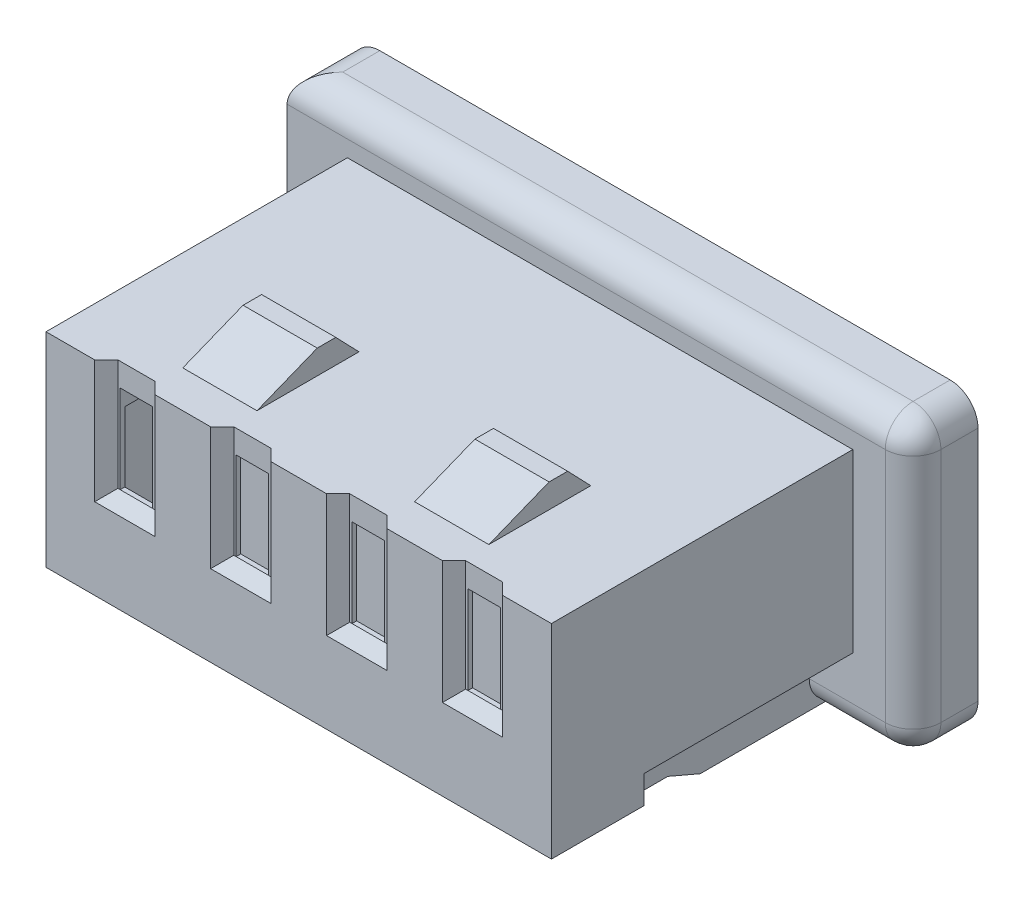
ISO-10303-21;
HEADER;
FILE_DESCRIPTION(('STEP AP214'),'2;1');
FILE_NAME('part.step','',(''),(''),'','','');
FILE_SCHEMA(('AUTOMOTIVE_DESIGN { 1 0 10303 214 1 1 1 1 }'));
ENDSEC;
DATA;
#1=APPLICATION_CONTEXT('core data for automotive mechanical design processes');
#2=APPLICATION_PROTOCOL_DEFINITION('international standard','automotive_design',2000,#1);
#3=PRODUCT_CONTEXT('',#1,'mechanical');
#4=PRODUCT('Part','Part','',(#3));
#5=PRODUCT_RELATED_PRODUCT_CATEGORY('part','',(#4));
#6=PRODUCT_DEFINITION_FORMATION('','',#4);
#7=PRODUCT_DEFINITION_CONTEXT('part definition',#1,'design');
#8=PRODUCT_DEFINITION('design','',#6,#7);
#9=PRODUCT_DEFINITION_SHAPE('','',#8);
#10=(LENGTH_UNIT() NAMED_UNIT(*) SI_UNIT(.MILLI.,.METRE.));
#11=(NAMED_UNIT(*) PLANE_ANGLE_UNIT() SI_UNIT($,.RADIAN.));
#12=(NAMED_UNIT(*) SI_UNIT($,.STERADIAN.) SOLID_ANGLE_UNIT());
#13=UNCERTAINTY_MEASURE_WITH_UNIT(LENGTH_MEASURE(1.E-05),#10,'distance_accuracy_value','');
#14=(GEOMETRIC_REPRESENTATION_CONTEXT(3) GLOBAL_UNCERTAINTY_ASSIGNED_CONTEXT((#13)) GLOBAL_UNIT_ASSIGNED_CONTEXT((#10,
#11,#12)) REPRESENTATION_CONTEXT('',''));
#15=CARTESIAN_POINT('',(0.,0.,0.));
#16=DIRECTION('',(0.,0.,1.));
#17=DIRECTION('',(1.,0.,0.));
#18=AXIS2_PLACEMENT_3D('',#15,#16,#17);
#19=CARTESIAN_POINT('',(-4.05,-0.8,-3.25));
#20=DIRECTION('',(0.,1.,0.));
#21=DIRECTION('',(0.,0.,1.));
#22=AXIS2_PLACEMENT_3D('',#19,#20,#21);
#23=PLANE('',#22);
#24=DIRECTION('',(0.,0.,-1.));
#25=VECTOR('',#24,1.);
#26=CARTESIAN_POINT('',(1.05,-0.8,-3.15));
#27=LINE('',#26,#25);
#28=CARTESIAN_POINT('',(1.05,-0.8,-1.));
#29=VERTEX_POINT('',#28);
#30=CARTESIAN_POINT('',(1.05,-0.8,-3.15));
#31=VERTEX_POINT('',#30);
#32=EDGE_CURVE('E1670',#29,#31,#27,.T.);
#33=ORIENTED_EDGE('',*,*,#32,.T.);
#34=DIRECTION('',(-1.,0.,0.));
#35=VECTOR('',#34,1.);
#36=CARTESIAN_POINT('',(1.005,-0.8,-3.15));
#37=LINE('',#36,#35);
#38=CARTESIAN_POINT('',(1.005,-0.8,-3.15));
#39=VERTEX_POINT('',#38);
#40=EDGE_CURVE('E1686',#31,#39,#37,.T.);
#41=ORIENTED_EDGE('',*,*,#40,.T.);
#42=DIRECTION('',(0.,0.,-1.));
#43=VECTOR('',#42,1.);
#44=CARTESIAN_POINT('',(1.005,-0.8,0.));
#45=LINE('',#44,#43);
#46=CARTESIAN_POINT('',(1.005,-0.8,-3.25));
#47=VERTEX_POINT('',#46);
#48=EDGE_CURVE('E1695',#47,#39,#45,.F.);
#49=ORIENTED_EDGE('',*,*,#48,.F.);
#50=DIRECTION('',(1.,0.,0.));
#51=VECTOR('',#50,1.);
#52=CARTESIAN_POINT('',(-4.05,-0.8,-3.25));
#53=LINE('',#52,#51);
#54=CARTESIAN_POINT('',(1.495,-0.8,-3.25));
#55=VERTEX_POINT('',#54);
#56=EDGE_CURVE('E1774',#55,#47,#53,.F.);
#57=ORIENTED_EDGE('',*,*,#56,.F.);
#58=DIRECTION('',(0.,0.,1.));
#59=VECTOR('',#58,1.);
#60=CARTESIAN_POINT('',(1.495,-0.8,-3.25));
#61=LINE('',#60,#59);
#62=CARTESIAN_POINT('',(1.495,-0.8,-3.15));
#63=VERTEX_POINT('',#62);
#64=EDGE_CURVE('E1875',#63,#55,#61,.F.);
#65=ORIENTED_EDGE('',*,*,#64,.F.);
#66=DIRECTION('',(1.,0.,0.));
#67=VECTOR('',#66,1.);
#68=CARTESIAN_POINT('',(-4.05,-0.8,-3.15));
#69=LINE('',#68,#67);
#70=CARTESIAN_POINT('',(1.45,-0.8,-3.15));
#71=VERTEX_POINT('',#70);
#72=EDGE_CURVE('E1895',#71,#63,#69,.T.);
#73=ORIENTED_EDGE('',*,*,#72,.F.);
#74=DIRECTION('',(0.,0.,1.));
#75=VECTOR('',#74,1.);
#76=CARTESIAN_POINT('',(1.45,-0.8,-0.8));
#77=LINE('',#76,#75);
#78=CARTESIAN_POINT('',(1.45,-0.8,-1.));
#79=VERTEX_POINT('',#78);
#80=EDGE_CURVE('E1614',#71,#79,#77,.T.);
#81=ORIENTED_EDGE('',*,*,#80,.T.);
#82=DIRECTION('',(1.,0.,0.));
#83=VECTOR('',#82,1.);
#84=CARTESIAN_POINT('',(-4.05,-0.8,-1.));
#85=LINE('',#84,#83);
#86=EDGE_CURVE('E1769',#29,#79,#85,.T.);
#87=ORIENTED_EDGE('',*,*,#86,.F.);
#88=EDGE_LOOP('',(#33,#41,#49,#57,#65,#73,#81,#87));
#89=FACE_BOUND('',#88,.T.);
#90=ADVANCED_FACE('F17',(#89),#23,.F.);
#91=CARTESIAN_POINT('',(1.005,0.,0.));
#92=DIRECTION('',(1.,0.,0.));
#93=DIRECTION('',(0.,0.,-1.));
#94=AXIS2_PLACEMENT_3D('',#91,#92,#93);
#95=PLANE('',#94);
#96=DIRECTION('',(0.,1.,0.));
#97=VECTOR('',#96,1.);
#98=CARTESIAN_POINT('',(1.005,0.,-1.225));
#99=LINE('',#98,#97);
#100=CARTESIAN_POINT('',(1.005,-0.6,-1.225));
#101=VERTEX_POINT('',#100);
#102=CARTESIAN_POINT('',(1.005,-0.799999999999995,-1.225));
#103=VERTEX_POINT('',#102);
#104=EDGE_CURVE('E1691',#101,#103,#99,.F.);
#105=ORIENTED_EDGE('',*,*,#104,.T.);
#106=DIRECTION('',(0.,-0.996815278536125,-0.0797452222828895));
#107=VECTOR('',#106,1.);
#108=CARTESIAN_POINT('',(1.005,-0.8,-1.225));
#109=LINE('',#108,#107);
#110=CARTESIAN_POINT('',(1.005,-1.425,-1.275));
#111=VERTEX_POINT('',#110);
#112=EDGE_CURVE('E1690',#103,#111,#109,.T.);
#113=ORIENTED_EDGE('',*,*,#112,.T.);
#114=DIRECTION('',(0.,0.,-1.));
#115=VECTOR('',#114,1.);
#116=CARTESIAN_POINT('',(1.005,-1.425,0.));
#117=LINE('',#116,#115);
#118=CARTESIAN_POINT('',(1.005,-1.425,-1.725));
#119=VERTEX_POINT('',#118);
#120=EDGE_CURVE('E1773',#111,#119,#117,.T.);
#121=ORIENTED_EDGE('',*,*,#120,.T.);
#122=DIRECTION('',(0.,-0.393919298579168,-0.919145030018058));
#123=VECTOR('',#122,1.);
#124=CARTESIAN_POINT('',(1.005,-1.425,-1.725));
#125=LINE('',#124,#123);
#126=CARTESIAN_POINT('',(1.005,-1.575,-2.075));
#127=VERTEX_POINT('',#126);
#128=EDGE_CURVE('E1704',#119,#127,#125,.T.);
#129=ORIENTED_EDGE('',*,*,#128,.T.);
#130=DIRECTION('',(0.,0.,-1.));
#131=VECTOR('',#130,1.);
#132=CARTESIAN_POINT('',(1.005,-1.575,0.));
#133=LINE('',#132,#131);
#134=CARTESIAN_POINT('',(1.005,-1.575,-3.55));
#135=VERTEX_POINT('',#134);
#136=EDGE_CURVE('E143',#127,#135,#133,.T.);
#137=ORIENTED_EDGE('',*,*,#136,.T.);
#138=CARTESIAN_POINT('',(1.005,-1.275,-3.55));
#139=DIRECTION('',(1.,0.,0.));
#140=DIRECTION('',(0.,0.,-1.));
#141=AXIS2_PLACEMENT_3D('',#138,#139,#140);
#142=CIRCLE('',#141,0.3);
#143=CARTESIAN_POINT('',(1.005,-1.275,-3.25));
#144=VERTEX_POINT('',#143);
#145=EDGE_CURVE('E20',#135,#144,#142,.F.);
#146=ORIENTED_EDGE('',*,*,#145,.T.);
#147=DIRECTION('',(0.,1.,0.));
#148=VECTOR('',#147,1.);
#149=CARTESIAN_POINT('',(1.005,0.,-3.25));
#150=LINE('',#149,#148);
#151=EDGE_CURVE('E1696',#144,#47,#150,.T.);
#152=ORIENTED_EDGE('',*,*,#151,.T.);
#153=ORIENTED_EDGE('',*,*,#48,.T.);
#154=DIRECTION('',(0.,1.,0.));
#155=VECTOR('',#154,1.);
#156=CARTESIAN_POINT('',(1.005,-1.1,-3.15));
#157=LINE('',#156,#155);
#158=CARTESIAN_POINT('',(1.005,-0.6,-3.15));
#159=VERTEX_POINT('',#158);
#160=EDGE_CURVE('E1682',#39,#159,#157,.T.);
#161=ORIENTED_EDGE('',*,*,#160,.T.);
#162=DIRECTION('',(0.,0.,-1.));
#163=VECTOR('',#162,1.);
#164=CARTESIAN_POINT('',(1.005,-0.6,0.));
#165=LINE('',#164,#163);
#166=EDGE_CURVE('E1592',#101,#159,#165,.T.);
#167=ORIENTED_EDGE('',*,*,#166,.F.);
#168=EDGE_LOOP('',(#105,#113,#121,#129,#137,#146,#152,#153,#161,#167));
#169=FACE_BOUND('',#168,.T.);
#170=ADVANCED_FACE('F2862',(#169),#95,.T.);
#171=CARTESIAN_POINT('',(1.005,-1.1,-3.15));
#172=DIRECTION('',(0.,0.,-1.));
#173=DIRECTION('',(-1.,0.,0.));
#174=AXIS2_PLACEMENT_3D('',#171,#172,#173);
#175=PLANE('',#174);
#176=DIRECTION('',(1.,0.,0.));
#177=VECTOR('',#176,1.);
#178=CARTESIAN_POINT('',(5.225,-0.6,-3.15));
#179=LINE('',#178,#177);
#180=CARTESIAN_POINT('',(1.05,-0.6,-3.15));
#181=VERTEX_POINT('',#180);
#182=EDGE_CURVE('E1588',#159,#181,#179,.T.);
#183=ORIENTED_EDGE('',*,*,#182,.F.);
#184=ORIENTED_EDGE('',*,*,#160,.F.);
#185=ORIENTED_EDGE('',*,*,#40,.F.);
#186=DIRECTION('',(0.,1.,0.));
#187=VECTOR('',#186,1.);
#188=CARTESIAN_POINT('',(1.05,-1.1,-3.15));
#189=LINE('',#188,#187);
#190=EDGE_CURVE('E1666',#31,#181,#189,.T.);
#191=ORIENTED_EDGE('',*,*,#190,.T.);
#192=EDGE_LOOP('',(#183,#184,#185,#191));
#193=FACE_BOUND('',#192,.T.);
#194=ADVANCED_FACE('F3317',(#193),#175,.F.);
#195=CARTESIAN_POINT('',(1.05,-1.1,-3.15));
#196=DIRECTION('',(1.,0.,0.));
#197=DIRECTION('',(0.,0.,-1.));
#198=AXIS2_PLACEMENT_3D('',#195,#196,#197);
#199=PLANE('',#198);
#200=DIRECTION('',(0.,0.,-1.));
#201=VECTOR('',#200,1.);
#202=CARTESIAN_POINT('',(1.05,-0.6,0.));
#203=LINE('',#202,#201);
#204=CARTESIAN_POINT('',(1.05,-0.6,-0.8));
#205=VERTEX_POINT('',#204);
#206=EDGE_CURVE('E1584',#181,#205,#203,.F.);
#207=ORIENTED_EDGE('',*,*,#206,.F.);
#208=ORIENTED_EDGE('',*,*,#190,.F.);
#209=ORIENTED_EDGE('',*,*,#32,.F.);
#210=DIRECTION('',(0.,1.,0.));
#211=VECTOR('',#210,1.);
#212=CARTESIAN_POINT('',(1.05,-1.1,-1.));
#213=LINE('',#212,#211);
#214=CARTESIAN_POINT('',(1.05,-1.1,-1.));
#215=VERTEX_POINT('',#214);
#216=EDGE_CURVE('E1674',#215,#29,#213,.T.);
#217=ORIENTED_EDGE('',*,*,#216,.F.);
#218=DIRECTION('',(0.,0.,-1.));
#219=VECTOR('',#218,1.);
#220=CARTESIAN_POINT('',(1.05,-1.1,-3.15));
#221=LINE('',#220,#219);
#222=CARTESIAN_POINT('',(1.05,-1.1,-0.8));
#223=VERTEX_POINT('',#222);
#224=EDGE_CURVE('E1678',#223,#215,#221,.T.);
#225=ORIENTED_EDGE('',*,*,#224,.F.);
#226=DIRECTION('',(0.,1.,0.));
#227=VECTOR('',#226,1.);
#228=CARTESIAN_POINT('',(1.05,-1.1,-0.8));
#229=LINE('',#228,#227);
#230=EDGE_CURVE('E1661',#205,#223,#229,.F.);
#231=ORIENTED_EDGE('',*,*,#230,.F.);
#232=EDGE_LOOP('',(#207,#208,#209,#217,#225,#231));
#233=FACE_BOUND('',#232,.T.);
#234=ADVANCED_FACE('F3314',(#233),#199,.F.);
#235=CARTESIAN_POINT('',(0.245,0.,0.));
#236=DIRECTION('',(1.,0.,0.));
#237=DIRECTION('',(0.,0.,-1.));
#238=AXIS2_PLACEMENT_3D('',#235,#236,#237);
#239=PLANE('',#238);
#240=CARTESIAN_POINT('',(0.245,-1.275,-3.55));
#241=DIRECTION('',(1.,0.,0.));
#242=DIRECTION('',(0.,0.,-1.));
#243=AXIS2_PLACEMENT_3D('',#240,#241,#242);
#244=CIRCLE('',#243,0.3);
#245=CARTESIAN_POINT('',(0.245,-1.575,-3.55));
#246=VERTEX_POINT('',#245);
#247=CARTESIAN_POINT('',(0.245,-1.275,-3.25));
#248=VERTEX_POINT('',#247);
#249=EDGE_CURVE('E1652',#246,#248,#244,.F.);
#250=ORIENTED_EDGE('',*,*,#249,.F.);
#251=DIRECTION('',(0.,0.,-1.));
#252=VECTOR('',#251,1.);
#253=CARTESIAN_POINT('',(0.245,-1.575,0.));
#254=LINE('',#253,#252);
#255=CARTESIAN_POINT('',(0.245,-1.575,-2.075));
#256=VERTEX_POINT('',#255);
#257=EDGE_CURVE('E1655',#256,#246,#254,.T.);
#258=ORIENTED_EDGE('',*,*,#257,.F.);
#259=DIRECTION('',(0.,-0.393919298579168,-0.919145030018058));
#260=VECTOR('',#259,1.);
#261=CARTESIAN_POINT('',(0.245,-1.425,-1.725));
#262=LINE('',#261,#260);
#263=CARTESIAN_POINT('',(0.245,-1.425,-1.725));
#264=VERTEX_POINT('',#263);
#265=EDGE_CURVE('E1658',#264,#256,#262,.T.);
#266=ORIENTED_EDGE('',*,*,#265,.F.);
#267=DIRECTION('',(0.,0.,-1.));
#268=VECTOR('',#267,1.);
#269=CARTESIAN_POINT('',(0.245,-1.425,0.));
#270=LINE('',#269,#268);
#271=CARTESIAN_POINT('',(0.245,-1.425,-1.275));
#272=VERTEX_POINT('',#271);
#273=EDGE_CURVE('E1813',#272,#264,#270,.T.);
#274=ORIENTED_EDGE('',*,*,#273,.F.);
#275=DIRECTION('',(0.,-0.996815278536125,-0.0797452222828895));
#276=VECTOR('',#275,1.);
#277=CARTESIAN_POINT('',(0.245,-0.8,-1.225));
#278=LINE('',#277,#276);
#279=CARTESIAN_POINT('',(0.245,-0.799999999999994,-1.225));
#280=VERTEX_POINT('',#279);
#281=EDGE_CURVE('E1824',#280,#272,#278,.T.);
#282=ORIENTED_EDGE('',*,*,#281,.F.);
#283=DIRECTION('',(0.,1.,0.));
#284=VECTOR('',#283,1.);
#285=CARTESIAN_POINT('',(0.245,0.,-1.225));
#286=LINE('',#285,#284);
#287=CARTESIAN_POINT('',(0.245,-0.6,-1.225));
#288=VERTEX_POINT('',#287);
#289=EDGE_CURVE('E1835',#288,#280,#286,.F.);
#290=ORIENTED_EDGE('',*,*,#289,.F.);
#291=DIRECTION('',(0.,0.,-1.));
#292=VECTOR('',#291,1.);
#293=CARTESIAN_POINT('',(0.245,-0.6,0.));
#294=LINE('',#293,#292);
#295=CARTESIAN_POINT('',(0.245,-0.6,-3.15));
#296=VERTEX_POINT('',#295);
#297=EDGE_CURVE('E1583',#296,#288,#294,.F.);
#298=ORIENTED_EDGE('',*,*,#297,.F.);
#299=DIRECTION('',(0.,1.,0.));
#300=VECTOR('',#299,1.);
#301=CARTESIAN_POINT('',(0.245,0.,-3.15));
#302=LINE('',#301,#300);
#303=CARTESIAN_POINT('',(0.245,-0.8,-3.15));
#304=VERTEX_POINT('',#303);
#305=EDGE_CURVE('E1803',#304,#296,#302,.T.);
#306=ORIENTED_EDGE('',*,*,#305,.F.);
#307=DIRECTION('',(0.,0.,-1.));
#308=VECTOR('',#307,1.);
#309=CARTESIAN_POINT('',(0.245,-0.8,0.));
#310=LINE('',#309,#308);
#311=CARTESIAN_POINT('',(0.245,-0.8,-3.25));
#312=VERTEX_POINT('',#311);
#313=EDGE_CURVE('E1665',#312,#304,#310,.F.);
#314=ORIENTED_EDGE('',*,*,#313,.F.);
#315=DIRECTION('',(0.,1.,0.));
#316=VECTOR('',#315,1.);
#317=CARTESIAN_POINT('',(0.245,0.,-3.25));
#318=LINE('',#317,#316);
#319=EDGE_CURVE('E1647',#248,#312,#318,.T.);
#320=ORIENTED_EDGE('',*,*,#319,.F.);
#321=EDGE_LOOP('',(#250,#258,#266,#274,#282,#290,#298,#306,#314,#320));
#322=FACE_BOUND('',#321,.T.);
#323=ADVANCED_FACE('F1983',(#322),#239,.F.);
#324=CARTESIAN_POINT('',(2.255,0.,0.));
#325=DIRECTION('',(1.,0.,0.));
#326=DIRECTION('',(0.,0.,-1.));
#327=AXIS2_PLACEMENT_3D('',#324,#325,#326);
#328=PLANE('',#327);
#329=DIRECTION('',(0.,1.,0.));
#330=VECTOR('',#329,1.);
#331=CARTESIAN_POINT('',(2.255,0.,-1.225));
#332=LINE('',#331,#330);
#333=CARTESIAN_POINT('',(2.255,-0.6,-1.225));
#334=VERTEX_POINT('',#333);
#335=CARTESIAN_POINT('',(2.255,-0.799999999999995,-1.225));
#336=VERTEX_POINT('',#335);
#337=EDGE_CURVE('E1624',#334,#336,#332,.F.);
#338=ORIENTED_EDGE('',*,*,#337,.T.);
#339=DIRECTION('',(0.,-0.996815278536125,-0.0797452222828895));
#340=VECTOR('',#339,1.);
#341=CARTESIAN_POINT('',(2.255,-0.8,-1.225));
#342=LINE('',#341,#340);
#343=CARTESIAN_POINT('',(2.255,-1.425,-1.275));
#344=VERTEX_POINT('',#343);
#345=EDGE_CURVE('E1623',#336,#344,#342,.T.);
#346=ORIENTED_EDGE('',*,*,#345,.T.);
#347=DIRECTION('',(0.,0.,-1.));
#348=VECTOR('',#347,1.);
#349=CARTESIAN_POINT('',(2.255,-1.425,0.));
#350=LINE('',#349,#348);
#351=CARTESIAN_POINT('',(2.255,-1.425,-1.725));
#352=VERTEX_POINT('',#351);
#353=EDGE_CURVE('E1651',#344,#352,#350,.T.);
#354=ORIENTED_EDGE('',*,*,#353,.T.);
#355=DIRECTION('',(0.,-0.393919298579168,-0.919145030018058));
#356=VECTOR('',#355,1.);
#357=CARTESIAN_POINT('',(2.255,-1.425,-1.725));
#358=LINE('',#357,#356);
#359=CARTESIAN_POINT('',(2.255,-1.575,-2.075));
#360=VERTEX_POINT('',#359);
#361=EDGE_CURVE('E1644',#352,#360,#358,.T.);
#362=ORIENTED_EDGE('',*,*,#361,.T.);
#363=DIRECTION('',(0.,0.,-1.));
#364=VECTOR('',#363,1.);
#365=CARTESIAN_POINT('',(2.255,-1.575,0.));
#366=LINE('',#365,#364);
#367=CARTESIAN_POINT('',(2.255,-1.575,-3.55));
#368=VERTEX_POINT('',#367);
#369=EDGE_CURVE('E1640',#360,#368,#366,.T.);
#370=ORIENTED_EDGE('',*,*,#369,.T.);
#371=CARTESIAN_POINT('',(2.255,-1.275,-3.55));
#372=DIRECTION('',(1.,0.,0.));
#373=DIRECTION('',(0.,0.,-1.));
#374=AXIS2_PLACEMENT_3D('',#371,#372,#373);
#375=CIRCLE('',#374,0.3);
#376=CARTESIAN_POINT('',(2.255,-1.275,-3.25));
#377=VERTEX_POINT('',#376);
#378=EDGE_CURVE('E1637',#368,#377,#375,.F.);
#379=ORIENTED_EDGE('',*,*,#378,.T.);
#380=DIRECTION('',(0.,1.,0.));
#381=VECTOR('',#380,1.);
#382=CARTESIAN_POINT('',(2.255,0.,-3.25));
#383=LINE('',#382,#381);
#384=CARTESIAN_POINT('',(2.255,-0.8,-3.25));
#385=VERTEX_POINT('',#384);
#386=EDGE_CURVE('E1633',#377,#385,#383,.T.);
#387=ORIENTED_EDGE('',*,*,#386,.T.);
#388=DIRECTION('',(0.,0.,-1.));
#389=VECTOR('',#388,1.);
#390=CARTESIAN_POINT('',(2.255,-0.8,0.));
#391=LINE('',#390,#389);
#392=CARTESIAN_POINT('',(2.255,-0.8,-3.15));
#393=VERTEX_POINT('',#392);
#394=EDGE_CURVE('E1632',#385,#393,#391,.F.);
#395=ORIENTED_EDGE('',*,*,#394,.T.);
#396=DIRECTION('',(0.,1.,0.));
#397=VECTOR('',#396,1.);
#398=CARTESIAN_POINT('',(2.255,0.,-3.15));
#399=LINE('',#398,#397);
#400=CARTESIAN_POINT('',(2.255,-0.6,-3.15));
#401=VERTEX_POINT('',#400);
#402=EDGE_CURVE('E1628',#393,#401,#399,.T.);
#403=ORIENTED_EDGE('',*,*,#402,.T.);
#404=DIRECTION('',(0.,0.,-1.));
#405=VECTOR('',#404,1.);
#406=CARTESIAN_POINT('',(2.255,-0.6,0.));
#407=LINE('',#406,#405);
#408=EDGE_CURVE('E1513',#334,#401,#407,.T.);
#409=ORIENTED_EDGE('',*,*,#408,.F.);
#410=EDGE_LOOP('',(#338,#346,#354,#362,#370,#379,#387,#395,#403,#409));
#411=FACE_BOUND('',#410,.T.);
#412=ADVANCED_FACE('F2838',(#411),#328,.T.);
#413=CARTESIAN_POINT('',(1.45,-1.1,-0.8));
#414=DIRECTION('',(-1.,0.,0.));
#415=DIRECTION('',(0.,0.,1.));
#416=AXIS2_PLACEMENT_3D('',#413,#414,#415);
#417=PLANE('',#416);
#418=ORIENTED_EDGE('',*,*,#80,.F.);
#419=DIRECTION('',(0.,1.,0.));
#420=VECTOR('',#419,1.);
#421=CARTESIAN_POINT('',(1.45,-1.1,-3.15));
#422=LINE('',#421,#420);
#423=CARTESIAN_POINT('',(1.45,-0.6,-3.15));
#424=VERTEX_POINT('',#423);
#425=EDGE_CURVE('E1613',#71,#424,#422,.T.);
#426=ORIENTED_EDGE('',*,*,#425,.T.);
#427=DIRECTION('',(0.,0.,-1.));
#428=VECTOR('',#427,1.);
#429=CARTESIAN_POINT('',(1.45,-0.6,0.));
#430=LINE('',#429,#428);
#431=CARTESIAN_POINT('',(1.45,-0.6,-0.799999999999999));
#432=VERTEX_POINT('',#431);
#433=EDGE_CURVE('E1509',#432,#424,#430,.T.);
#434=ORIENTED_EDGE('',*,*,#433,.F.);
#435=DIRECTION('',(0.,1.,0.));
#436=VECTOR('',#435,1.);
#437=CARTESIAN_POINT('',(1.45,-1.1,-0.8));
#438=LINE('',#437,#436);
#439=CARTESIAN_POINT('',(1.45,-1.1,-0.8));
#440=VERTEX_POINT('',#439);
#441=EDGE_CURVE('E1615',#440,#432,#438,.T.);
#442=ORIENTED_EDGE('',*,*,#441,.F.);
#443=DIRECTION('',(0.,0.,1.));
#444=VECTOR('',#443,1.);
#445=CARTESIAN_POINT('',(1.45,-1.1,-0.8));
#446=LINE('',#445,#444);
#447=CARTESIAN_POINT('',(1.45,-1.1,-1.));
#448=VERTEX_POINT('',#447);
#449=EDGE_CURVE('E1619',#448,#440,#446,.T.);
#450=ORIENTED_EDGE('',*,*,#449,.F.);
#451=DIRECTION('',(0.,1.,0.));
#452=VECTOR('',#451,1.);
#453=CARTESIAN_POINT('',(1.45,-1.1,-1.));
#454=LINE('',#453,#452);
#455=EDGE_CURVE('E1609',#79,#448,#454,.F.);
#456=ORIENTED_EDGE('',*,*,#455,.F.);
#457=EDGE_LOOP('',(#418,#426,#434,#442,#450,#456));
#458=FACE_BOUND('',#457,.T.);
#459=ADVANCED_FACE('F3217',(#458),#417,.F.);
#460=CARTESIAN_POINT('',(1.45,-1.1,-3.15));
#461=DIRECTION('',(0.,0.,-1.));
#462=DIRECTION('',(-1.,0.,0.));
#463=AXIS2_PLACEMENT_3D('',#460,#461,#462);
#464=PLANE('',#463);
#465=DIRECTION('',(1.,0.,0.));
#466=VECTOR('',#465,1.);
#467=CARTESIAN_POINT('',(6.475,-0.6,-3.15));
#468=LINE('',#467,#466);
#469=CARTESIAN_POINT('',(1.495,-0.6,-3.15));
#470=VERTEX_POINT('',#469);
#471=EDGE_CURVE('E1505',#424,#470,#468,.T.);
#472=ORIENTED_EDGE('',*,*,#471,.F.);
#473=ORIENTED_EDGE('',*,*,#425,.F.);
#474=ORIENTED_EDGE('',*,*,#72,.T.);
#475=DIRECTION('',(0.,1.,0.));
#476=VECTOR('',#475,1.);
#477=CARTESIAN_POINT('',(1.495,0.,-3.15));
#478=LINE('',#477,#476);
#479=EDGE_CURVE('E1756',#63,#470,#478,.T.);
#480=ORIENTED_EDGE('',*,*,#479,.T.);
#481=EDGE_LOOP('',(#472,#473,#474,#480));
#482=FACE_BOUND('',#481,.T.);
#483=ADVANCED_FACE('F3222',(#482),#464,.F.);
#484=CARTESIAN_POINT('',(1.495,0.,0.));
#485=DIRECTION('',(1.,0.,0.));
#486=DIRECTION('',(0.,0.,-1.));
#487=AXIS2_PLACEMENT_3D('',#484,#485,#486);
#488=PLANE('',#487);
#489=CARTESIAN_POINT('',(1.495,-1.275,-3.55));
#490=DIRECTION('',(1.,0.,0.));
#491=DIRECTION('',(0.,0.,-1.));
#492=AXIS2_PLACEMENT_3D('',#489,#490,#491);
#493=CIRCLE('',#492,0.3);
#494=CARTESIAN_POINT('',(1.495,-1.575,-3.55));
#495=VERTEX_POINT('',#494);
#496=CARTESIAN_POINT('',(1.495,-1.275,-3.25));
#497=VERTEX_POINT('',#496);
#498=EDGE_CURVE('E1600',#495,#497,#493,.F.);
#499=ORIENTED_EDGE('',*,*,#498,.F.);
#500=DIRECTION('',(0.,0.,-1.));
#501=VECTOR('',#500,1.);
#502=CARTESIAN_POINT('',(1.495,-1.575,0.));
#503=LINE('',#502,#501);
#504=CARTESIAN_POINT('',(1.495,-1.575,-2.075));
#505=VERTEX_POINT('',#504);
#506=EDGE_CURVE('E1603',#505,#495,#503,.T.);
#507=ORIENTED_EDGE('',*,*,#506,.F.);
#508=DIRECTION('',(0.,-0.393919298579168,-0.919145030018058));
#509=VECTOR('',#508,1.);
#510=CARTESIAN_POINT('',(1.495,-1.425,-1.725));
#511=LINE('',#510,#509);
#512=CARTESIAN_POINT('',(1.495,-1.425,-1.725));
#513=VERTEX_POINT('',#512);
#514=EDGE_CURVE('E1606',#513,#505,#511,.T.);
#515=ORIENTED_EDGE('',*,*,#514,.F.);
#516=DIRECTION('',(0.,0.,-1.));
#517=VECTOR('',#516,1.);
#518=CARTESIAN_POINT('',(1.495,-1.425,0.));
#519=LINE('',#518,#517);
#520=CARTESIAN_POINT('',(1.495,-1.425,-1.275));
#521=VERTEX_POINT('',#520);
#522=EDGE_CURVE('E1723',#521,#513,#519,.T.);
#523=ORIENTED_EDGE('',*,*,#522,.F.);
#524=DIRECTION('',(0.,-0.996815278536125,-0.0797452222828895));
#525=VECTOR('',#524,1.);
#526=CARTESIAN_POINT('',(1.495,-0.8,-1.225));
#527=LINE('',#526,#525);
#528=CARTESIAN_POINT('',(1.495,-0.799999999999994,-1.225));
#529=VERTEX_POINT('',#528);
#530=EDGE_CURVE('E1734',#529,#521,#527,.T.);
#531=ORIENTED_EDGE('',*,*,#530,.F.);
#532=DIRECTION('',(0.,1.,0.));
#533=VECTOR('',#532,1.);
#534=CARTESIAN_POINT('',(1.495,0.,-1.225));
#535=LINE('',#534,#533);
#536=CARTESIAN_POINT('',(1.495,-0.6,-1.225));
#537=VERTEX_POINT('',#536);
#538=EDGE_CURVE('E1745',#537,#529,#535,.F.);
#539=ORIENTED_EDGE('',*,*,#538,.F.);
#540=DIRECTION('',(0.,0.,-1.));
#541=VECTOR('',#540,1.);
#542=CARTESIAN_POINT('',(1.495,-0.6,0.));
#543=LINE('',#542,#541);
#544=EDGE_CURVE('E1504',#470,#537,#543,.F.);
#545=ORIENTED_EDGE('',*,*,#544,.F.);
#546=ORIENTED_EDGE('',*,*,#479,.F.);
#547=ORIENTED_EDGE('',*,*,#64,.T.);
#548=DIRECTION('',(0.,1.,0.));
#549=VECTOR('',#548,1.);
#550=CARTESIAN_POINT('',(1.495,0.,-3.25));
#551=LINE('',#550,#549);
#552=EDGE_CURVE('E1596',#497,#55,#551,.T.);
#553=ORIENTED_EDGE('',*,*,#552,.F.);
#554=EDGE_LOOP('',(#499,#507,#515,#523,#531,#539,#545,#546,#547,#553));
#555=FACE_BOUND('',#554,.T.);
#556=ADVANCED_FACE('F2848',(#555),#488,.F.);
#557=CARTESIAN_POINT('',(5.225,-0.6,0.));
#558=DIRECTION('',(0.,-1.,0.));
#559=DIRECTION('',(0.,0.,-1.));
#560=AXIS2_PLACEMENT_3D('',#557,#558,#559);
#561=PLANE('',#560);
#562=ORIENTED_EDGE('',*,*,#297,.T.);
#563=DIRECTION('',(1.,0.,0.));
#564=VECTOR('',#563,1.);
#565=CARTESIAN_POINT('',(5.225,-0.6,-1.225));
#566=LINE('',#565,#564);
#567=EDGE_CURVE('E1517',#288,#101,#566,.T.);
#568=ORIENTED_EDGE('',*,*,#567,.T.);
#569=ORIENTED_EDGE('',*,*,#166,.T.);
#570=ORIENTED_EDGE('',*,*,#182,.T.);
#571=ORIENTED_EDGE('',*,*,#206,.T.);
#572=DIRECTION('',(0.407650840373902,0.,-0.913137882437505));
#573=VECTOR('',#572,1.);
#574=CARTESIAN_POINT('',(1.05,-0.6,-0.8));
#575=LINE('',#574,#573);
#576=CARTESIAN_POINT('',(0.924999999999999,-0.6,-0.520000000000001));
#577=VERTEX_POINT('',#576);
#578=EDGE_CURVE('E1460',#205,#577,#575,.F.);
#579=ORIENTED_EDGE('',*,*,#578,.T.);
#580=DIRECTION('',(0.,0.,-1.));
#581=VECTOR('',#580,1.);
#582=CARTESIAN_POINT('',(0.925,-0.6,-0.52));
#583=LINE('',#582,#581);
#584=CARTESIAN_POINT('',(0.925,-0.6,-0.25));
#585=VERTEX_POINT('',#584);
#586=EDGE_CURVE('E1468',#577,#585,#583,.F.);
#587=ORIENTED_EDGE('',*,*,#586,.T.);
#588=DIRECTION('',(1.,0.,0.));
#589=VECTOR('',#588,1.);
#590=CARTESIAN_POINT('',(0.925,-0.6,-0.25));
#591=LINE('',#590,#589);
#592=CARTESIAN_POINT('',(0.325,-0.6,-0.25));
#593=VERTEX_POINT('',#592);
#594=EDGE_CURVE('E1476',#585,#593,#591,.F.);
#595=ORIENTED_EDGE('',*,*,#594,.T.);
#596=DIRECTION('',(0.,0.,1.));
#597=VECTOR('',#596,1.);
#598=CARTESIAN_POINT('',(0.325,-0.6,-0.25));
#599=LINE('',#598,#597);
#600=CARTESIAN_POINT('',(0.325,-0.6,-0.52));
#601=VERTEX_POINT('',#600);
#602=EDGE_CURVE('E1484',#593,#601,#599,.F.);
#603=ORIENTED_EDGE('',*,*,#602,.T.);
#604=DIRECTION('',(0.407650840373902,0.,0.913137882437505));
#605=VECTOR('',#604,1.);
#606=CARTESIAN_POINT('',(0.325,-0.6,-0.52));
#607=LINE('',#606,#605);
#608=CARTESIAN_POINT('',(0.199999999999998,-0.6,-0.799999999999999));
#609=VERTEX_POINT('',#608);
#610=EDGE_CURVE('E1488',#601,#609,#607,.F.);
#611=ORIENTED_EDGE('',*,*,#610,.T.);
#612=DIRECTION('',(0.,0.,1.));
#613=VECTOR('',#612,1.);
#614=CARTESIAN_POINT('',(0.2,-0.6,-0.8));
#615=LINE('',#614,#613);
#616=CARTESIAN_POINT('',(0.2,-0.6,-3.15));
#617=VERTEX_POINT('',#616);
#618=EDGE_CURVE('E1396',#609,#617,#615,.F.);
#619=ORIENTED_EDGE('',*,*,#618,.T.);
#620=DIRECTION('',(1.,0.,0.));
#621=VECTOR('',#620,1.);
#622=CARTESIAN_POINT('',(5.225,-0.6,-3.15));
#623=LINE('',#622,#621);
#624=EDGE_CURVE('E1579',#617,#296,#623,.T.);
#625=ORIENTED_EDGE('',*,*,#624,.T.);
#626=EDGE_LOOP('',(#562,#568,#569,#570,#571,#579,#587,#595,#603,#611,#619,#625));
#627=FACE_BOUND('',#626,.T.);
#628=ADVANCED_FACE('F2130',(#627),#561,.T.);
#629=CARTESIAN_POINT('',(6.475,-0.6,0.));
#630=DIRECTION('',(0.,-1.,0.));
#631=DIRECTION('',(0.,0.,-1.));
#632=AXIS2_PLACEMENT_3D('',#629,#630,#631);
#633=PLANE('',#632);
#634=ORIENTED_EDGE('',*,*,#544,.T.);
#635=DIRECTION('',(-1.,0.,0.));
#636=VECTOR('',#635,1.);
#637=CARTESIAN_POINT('',(1.495,-0.6,-1.225));
#638=LINE('',#637,#636);
#639=EDGE_CURVE('E1313',#537,#334,#638,.F.);
#640=ORIENTED_EDGE('',*,*,#639,.T.);
#641=ORIENTED_EDGE('',*,*,#408,.T.);
#642=DIRECTION('',(-1.,0.,0.));
#643=VECTOR('',#642,1.);
#644=CARTESIAN_POINT('',(2.255,-0.6,-3.15));
#645=LINE('',#644,#643);
#646=CARTESIAN_POINT('',(2.3,-0.6,-3.15));
#647=VERTEX_POINT('',#646);
#648=EDGE_CURVE('E1309',#401,#647,#645,.F.);
#649=ORIENTED_EDGE('',*,*,#648,.T.);
#650=DIRECTION('',(0.,0.,-1.));
#651=VECTOR('',#650,1.);
#652=CARTESIAN_POINT('',(2.3,-0.6,-3.15));
#653=LINE('',#652,#651);
#654=CARTESIAN_POINT('',(2.3,-0.6,-0.8));
#655=VERTEX_POINT('',#654);
#656=EDGE_CURVE('E1301',#647,#655,#653,.F.);
#657=ORIENTED_EDGE('',*,*,#656,.T.);
#658=DIRECTION('',(0.407650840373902,0.,-0.913137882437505));
#659=VECTOR('',#658,1.);
#660=CARTESIAN_POINT('',(2.3,-0.6,-0.8));
#661=LINE('',#660,#659);
#662=CARTESIAN_POINT('',(2.175,-0.6,-0.520000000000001));
#663=VERTEX_POINT('',#662);
#664=EDGE_CURVE('E1424',#655,#663,#661,.F.);
#665=ORIENTED_EDGE('',*,*,#664,.T.);
#666=DIRECTION('',(0.,0.,-1.));
#667=VECTOR('',#666,1.);
#668=CARTESIAN_POINT('',(2.175,-0.6,-0.52));
#669=LINE('',#668,#667);
#670=CARTESIAN_POINT('',(2.175,-0.6,-0.25));
#671=VERTEX_POINT('',#670);
#672=EDGE_CURVE('E1432',#663,#671,#669,.F.);
#673=ORIENTED_EDGE('',*,*,#672,.T.);
#674=DIRECTION('',(1.,0.,0.));
#675=VECTOR('',#674,1.);
#676=CARTESIAN_POINT('',(2.175,-0.6,-0.25));
#677=LINE('',#676,#675);
#678=CARTESIAN_POINT('',(1.575,-0.6,-0.25));
#679=VERTEX_POINT('',#678);
#680=EDGE_CURVE('E1440',#671,#679,#677,.F.);
#681=ORIENTED_EDGE('',*,*,#680,.T.);
#682=DIRECTION('',(0.,0.,1.));
#683=VECTOR('',#682,1.);
#684=CARTESIAN_POINT('',(1.575,-0.6,-0.25));
#685=LINE('',#684,#683);
#686=CARTESIAN_POINT('',(1.575,-0.6,-0.52));
#687=VERTEX_POINT('',#686);
#688=EDGE_CURVE('E1448',#679,#687,#685,.F.);
#689=ORIENTED_EDGE('',*,*,#688,.T.);
#690=DIRECTION('',(0.407650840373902,0.,0.913137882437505));
#691=VECTOR('',#690,1.);
#692=CARTESIAN_POINT('',(1.575,-0.6,-0.52));
#693=LINE('',#692,#691);
#694=EDGE_CURVE('E1452',#687,#432,#693,.F.);
#695=ORIENTED_EDGE('',*,*,#694,.T.);
#696=ORIENTED_EDGE('',*,*,#433,.T.);
#697=ORIENTED_EDGE('',*,*,#471,.T.);
#698=EDGE_LOOP('',(#634,#640,#641,#649,#657,#665,#673,#681,#689,#695,#696,#697));
#699=FACE_BOUND('',#698,.T.);
#700=ADVANCED_FACE('F3186',(#699),#633,.T.);
#701=CARTESIAN_POINT('',(1.25,0.,-0.175));
#702=DIRECTION('',(0.,0.,1.));
#703=DIRECTION('',(1.,0.,0.));
#704=AXIS2_PLACEMENT_3D('',#701,#702,#703);
#705=PLANE('',#704);
#706=DIRECTION('',(1.,0.,0.));
#707=VECTOR('',#706,1.);
#708=CARTESIAN_POINT('',(-0.45,0.85,-0.175));
#709=LINE('',#708,#707);
#710=CARTESIAN_POINT('',(-0.45,0.85,-0.175));
#711=VERTEX_POINT('',#710);
#712=CARTESIAN_POINT('',(-0.8,0.85,-0.175));
#713=VERTEX_POINT('',#712);
#714=EDGE_CURVE('E1285',#711,#713,#709,.F.);
#715=ORIENTED_EDGE('',*,*,#714,.T.);
#716=DIRECTION('',(0.,1.,0.));
#717=VECTOR('',#716,1.);
#718=CARTESIAN_POINT('',(-0.8,0.85,-0.175));
#719=LINE('',#718,#717);
#720=CARTESIAN_POINT('',(-0.8,-0.1,-0.175));
#721=VERTEX_POINT('',#720);
#722=EDGE_CURVE('E1293',#713,#721,#719,.F.);
#723=ORIENTED_EDGE('',*,*,#722,.T.);
#724=DIRECTION('',(1.,0.,0.));
#725=VECTOR('',#724,1.);
#726=CARTESIAN_POINT('',(-0.825,-0.1,-0.175));
#727=LINE('',#726,#725);
#728=CARTESIAN_POINT('',(-0.45,-0.1,-0.175));
#729=VERTEX_POINT('',#728);
#730=EDGE_CURVE('E1492',#721,#729,#727,.T.);
#731=ORIENTED_EDGE('',*,*,#730,.T.);
#732=DIRECTION('',(0.,1.,0.));
#733=VECTOR('',#732,1.);
#734=CARTESIAN_POINT('',(-0.45,-0.1,-0.175));
#735=LINE('',#734,#733);
#736=EDGE_CURVE('E1273',#729,#711,#735,.T.);
#737=ORIENTED_EDGE('',*,*,#736,.T.);
#738=EDGE_LOOP('',(#715,#723,#731,#737));
#739=FACE_BOUND('',#738,.T.);
#740=ADVANCED_FACE('F3295',(#739),#705,.T.);
#741=CARTESIAN_POINT('',(2.5,0.,-0.175));
#742=DIRECTION('',(0.,0.,1.));
#743=DIRECTION('',(1.,0.,0.));
#744=AXIS2_PLACEMENT_3D('',#741,#742,#743);
#745=PLANE('',#744);
#746=DIRECTION('',(1.,0.,0.));
#747=VECTOR('',#746,1.);
#748=CARTESIAN_POINT('',(0.8,0.85,-0.175));
#749=LINE('',#748,#747);
#750=CARTESIAN_POINT('',(0.8,0.85,-0.175));
#751=VERTEX_POINT('',#750);
#752=CARTESIAN_POINT('',(0.45,0.85,-0.175));
#753=VERTEX_POINT('',#752);
#754=EDGE_CURVE('E1257',#751,#753,#749,.F.);
#755=ORIENTED_EDGE('',*,*,#754,.T.);
#756=DIRECTION('',(0.,1.,0.));
#757=VECTOR('',#756,1.);
#758=CARTESIAN_POINT('',(0.45,0.85,-0.175));
#759=LINE('',#758,#757);
#760=CARTESIAN_POINT('',(0.45,-0.1,-0.175));
#761=VERTEX_POINT('',#760);
#762=EDGE_CURVE('E1265',#753,#761,#759,.F.);
#763=ORIENTED_EDGE('',*,*,#762,.T.);
#764=DIRECTION('',(1.,0.,0.));
#765=VECTOR('',#764,1.);
#766=CARTESIAN_POINT('',(0.425,-0.1,-0.175));
#767=LINE('',#766,#765);
#768=CARTESIAN_POINT('',(0.8,-0.1,-0.175));
#769=VERTEX_POINT('',#768);
#770=EDGE_CURVE('E1496',#761,#769,#767,.T.);
#771=ORIENTED_EDGE('',*,*,#770,.T.);
#772=DIRECTION('',(0.,1.,0.));
#773=VECTOR('',#772,1.);
#774=CARTESIAN_POINT('',(0.8,-0.1,-0.175));
#775=LINE('',#774,#773);
#776=EDGE_CURVE('E1245',#769,#751,#775,.T.);
#777=ORIENTED_EDGE('',*,*,#776,.T.);
#778=EDGE_LOOP('',(#755,#763,#771,#777));
#779=FACE_BOUND('',#778,.T.);
#780=ADVANCED_FACE('F3291',(#779),#745,.T.);
#781=CARTESIAN_POINT('',(3.75,0.,-0.175));
#782=DIRECTION('',(0.,0.,1.));
#783=DIRECTION('',(1.,0.,0.));
#784=AXIS2_PLACEMENT_3D('',#781,#782,#783);
#785=PLANE('',#784);
#786=DIRECTION('',(1.,0.,0.));
#787=VECTOR('',#786,1.);
#788=CARTESIAN_POINT('',(2.05,0.85,-0.175));
#789=LINE('',#788,#787);
#790=CARTESIAN_POINT('',(2.05,0.85,-0.175));
#791=VERTEX_POINT('',#790);
#792=CARTESIAN_POINT('',(1.7,0.85,-0.175));
#793=VERTEX_POINT('',#792);
#794=EDGE_CURVE('E1229',#791,#793,#789,.F.);
#795=ORIENTED_EDGE('',*,*,#794,.T.);
#796=DIRECTION('',(0.,1.,0.));
#797=VECTOR('',#796,1.);
#798=CARTESIAN_POINT('',(1.7,0.85,-0.175));
#799=LINE('',#798,#797);
#800=CARTESIAN_POINT('',(1.7,-0.1,-0.175));
#801=VERTEX_POINT('',#800);
#802=EDGE_CURVE('E1237',#793,#801,#799,.F.);
#803=ORIENTED_EDGE('',*,*,#802,.T.);
#804=DIRECTION('',(1.,0.,0.));
#805=VECTOR('',#804,1.);
#806=CARTESIAN_POINT('',(1.675,-0.1,-0.175));
#807=LINE('',#806,#805);
#808=CARTESIAN_POINT('',(2.05,-0.1,-0.175));
#809=VERTEX_POINT('',#808);
#810=EDGE_CURVE('E1500',#801,#809,#807,.T.);
#811=ORIENTED_EDGE('',*,*,#810,.T.);
#812=DIRECTION('',(0.,1.,0.));
#813=VECTOR('',#812,1.);
#814=CARTESIAN_POINT('',(2.05,-0.1,-0.175));
#815=LINE('',#814,#813);
#816=EDGE_CURVE('E1217',#809,#791,#815,.T.);
#817=ORIENTED_EDGE('',*,*,#816,.T.);
#818=EDGE_LOOP('',(#795,#803,#811,#817));
#819=FACE_BOUND('',#818,.T.);
#820=ADVANCED_FACE('F3287',(#819),#785,.T.);
#821=CARTESIAN_POINT('',(1.675,-0.1,0.));
#822=DIRECTION('',(0.,-1.,0.));
#823=DIRECTION('',(0.,0.,-1.));
#824=AXIS2_PLACEMENT_3D('',#821,#822,#823);
#825=PLANE('',#824);
#826=ORIENTED_EDGE('',*,*,#810,.F.);
#827=DIRECTION('',(0.,0.,1.));
#828=VECTOR('',#827,1.);
#829=CARTESIAN_POINT('',(1.7,-0.1,-0.125));
#830=LINE('',#829,#828);
#831=CARTESIAN_POINT('',(1.7,-0.1,-0.125));
#832=VERTEX_POINT('',#831);
#833=EDGE_CURVE('E1233',#801,#832,#830,.T.);
#834=ORIENTED_EDGE('',*,*,#833,.T.);
#835=DIRECTION('',(1.,0.,0.));
#836=VECTOR('',#835,1.);
#837=CARTESIAN_POINT('',(1.875,-0.1,-0.125));
#838=LINE('',#837,#836);
#839=CARTESIAN_POINT('',(2.05,-0.1,-0.125));
#840=VERTEX_POINT('',#839);
#841=EDGE_CURVE('E1198',#840,#832,#838,.F.);
#842=ORIENTED_EDGE('',*,*,#841,.F.);
#843=DIRECTION('',(0.,0.,-1.));
#844=VECTOR('',#843,1.);
#845=CARTESIAN_POINT('',(2.05,-0.1,-0.125));
#846=LINE('',#845,#844);
#847=EDGE_CURVE('E1221',#840,#809,#846,.T.);
#848=ORIENTED_EDGE('',*,*,#847,.T.);
#849=EDGE_LOOP('',(#826,#834,#842,#848));
#850=FACE_BOUND('',#849,.T.);
#851=ADVANCED_FACE('F3283',(#850),#825,.F.);
#852=CARTESIAN_POINT('',(0.425,-0.1,0.));
#853=DIRECTION('',(0.,-1.,0.));
#854=DIRECTION('',(0.,0.,-1.));
#855=AXIS2_PLACEMENT_3D('',#852,#853,#854);
#856=PLANE('',#855);
#857=ORIENTED_EDGE('',*,*,#770,.F.);
#858=DIRECTION('',(0.,0.,1.));
#859=VECTOR('',#858,1.);
#860=CARTESIAN_POINT('',(0.45,-0.1,-0.125));
#861=LINE('',#860,#859);
#862=CARTESIAN_POINT('',(0.45,-0.1,-0.125));
#863=VERTEX_POINT('',#862);
#864=EDGE_CURVE('E1261',#761,#863,#861,.T.);
#865=ORIENTED_EDGE('',*,*,#864,.T.);
#866=DIRECTION('',(1.,0.,0.));
#867=VECTOR('',#866,1.);
#868=CARTESIAN_POINT('',(0.625,-0.1,-0.125));
#869=LINE('',#868,#867);
#870=CARTESIAN_POINT('',(0.8,-0.1,-0.125));
#871=VERTEX_POINT('',#870);
#872=EDGE_CURVE('E1178',#871,#863,#869,.F.);
#873=ORIENTED_EDGE('',*,*,#872,.F.);
#874=DIRECTION('',(0.,0.,-1.));
#875=VECTOR('',#874,1.);
#876=CARTESIAN_POINT('',(0.8,-0.1,-0.125));
#877=LINE('',#876,#875);
#878=EDGE_CURVE('E1249',#871,#769,#877,.T.);
#879=ORIENTED_EDGE('',*,*,#878,.T.);
#880=EDGE_LOOP('',(#857,#865,#873,#879));
#881=FACE_BOUND('',#880,.T.);
#882=ADVANCED_FACE('F3279',(#881),#856,.F.);
#883=CARTESIAN_POINT('',(-0.825,-0.1,0.));
#884=DIRECTION('',(0.,-1.,0.));
#885=DIRECTION('',(0.,0.,-1.));
#886=AXIS2_PLACEMENT_3D('',#883,#884,#885);
#887=PLANE('',#886);
#888=ORIENTED_EDGE('',*,*,#730,.F.);
#889=DIRECTION('',(0.,0.,1.));
#890=VECTOR('',#889,1.);
#891=CARTESIAN_POINT('',(-0.8,-0.1,-0.125));
#892=LINE('',#891,#890);
#893=CARTESIAN_POINT('',(-0.8,-0.1,-0.125));
#894=VERTEX_POINT('',#893);
#895=EDGE_CURVE('E1289',#721,#894,#892,.T.);
#896=ORIENTED_EDGE('',*,*,#895,.T.);
#897=DIRECTION('',(1.,0.,0.));
#898=VECTOR('',#897,1.);
#899=CARTESIAN_POINT('',(-0.625,-0.1,-0.125));
#900=LINE('',#899,#898);
#901=CARTESIAN_POINT('',(-0.45,-0.1,-0.125));
#902=VERTEX_POINT('',#901);
#903=EDGE_CURVE('E1158',#902,#894,#900,.F.);
#904=ORIENTED_EDGE('',*,*,#903,.F.);
#905=DIRECTION('',(0.,0.,-1.));
#906=VECTOR('',#905,1.);
#907=CARTESIAN_POINT('',(-0.45,-0.1,-0.125));
#908=LINE('',#907,#906);
#909=EDGE_CURVE('E1277',#902,#729,#908,.T.);
#910=ORIENTED_EDGE('',*,*,#909,.T.);
#911=EDGE_LOOP('',(#888,#896,#904,#910));
#912=FACE_BOUND('',#911,.T.);
#913=ADVANCED_FACE('F3276',(#912),#887,.F.);
#914=CARTESIAN_POINT('',(0.325,-1.1,-0.52));
#915=DIRECTION('',(-0.913137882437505,0.,0.407650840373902));
#916=DIRECTION('',(0.407650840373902,0.,0.913137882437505));
#917=AXIS2_PLACEMENT_3D('',#914,#915,#916);
#918=PLANE('',#917);
#919=ORIENTED_EDGE('',*,*,#610,.F.);
#920=DIRECTION('',(0.,1.,0.));
#921=VECTOR('',#920,1.);
#922=CARTESIAN_POINT('',(0.325,-1.1,-0.52));
#923=LINE('',#922,#921);
#924=CARTESIAN_POINT('',(0.325,-1.1,-0.52));
#925=VERTEX_POINT('',#924);
#926=EDGE_CURVE('E1480',#601,#925,#923,.F.);
#927=ORIENTED_EDGE('',*,*,#926,.T.);
#928=DIRECTION('',(0.407650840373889,0.,0.913137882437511));
#929=VECTOR('',#928,1.);
#930=CARTESIAN_POINT('',(0.2,-1.1,-0.8));
#931=LINE('',#930,#929);
#932=CARTESIAN_POINT('',(0.199999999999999,-1.1,-0.8));
#933=VERTEX_POINT('',#932);
#934=EDGE_CURVE('E1090',#933,#925,#931,.T.);
#935=ORIENTED_EDGE('',*,*,#934,.F.);
#936=DIRECTION('',(0.,1.,0.));
#937=VECTOR('',#936,1.);
#938=CARTESIAN_POINT('',(0.2,-1.1,-0.8));
#939=LINE('',#938,#937);
#940=EDGE_CURVE('E1400',#933,#609,#939,.T.);
#941=ORIENTED_EDGE('',*,*,#940,.T.);
#942=EDGE_LOOP('',(#919,#927,#935,#941));
#943=FACE_BOUND('',#942,.T.);
#944=ADVANCED_FACE('F2136',(#943),#918,.F.);
#945=CARTESIAN_POINT('',(0.325,-1.1,-0.25));
#946=DIRECTION('',(-1.,0.,0.));
#947=DIRECTION('',(0.,0.,1.));
#948=AXIS2_PLACEMENT_3D('',#945,#946,#947);
#949=PLANE('',#948);
#950=ORIENTED_EDGE('',*,*,#602,.F.);
#951=DIRECTION('',(0.,1.,0.));
#952=VECTOR('',#951,1.);
#953=CARTESIAN_POINT('',(0.325,-1.1,-0.25));
#954=LINE('',#953,#952);
#955=CARTESIAN_POINT('',(0.325,-1.1,-0.25));
#956=VERTEX_POINT('',#955);
#957=EDGE_CURVE('E1472',#593,#956,#954,.F.);
#958=ORIENTED_EDGE('',*,*,#957,.T.);
#959=DIRECTION('',(0.,0.,-1.));
#960=VECTOR('',#959,1.);
#961=CARTESIAN_POINT('',(0.325,-1.1,0.));
#962=LINE('',#961,#960);
#963=EDGE_CURVE('E1086',#925,#956,#962,.F.);
#964=ORIENTED_EDGE('',*,*,#963,.F.);
#965=ORIENTED_EDGE('',*,*,#926,.F.);
#966=EDGE_LOOP('',(#950,#958,#964,#965));
#967=FACE_BOUND('',#966,.T.);
#968=ADVANCED_FACE('F2377',(#967),#949,.F.);
#969=CARTESIAN_POINT('',(0.925,-1.1,-0.25));
#970=DIRECTION('',(0.,0.,1.));
#971=DIRECTION('',(1.,0.,0.));
#972=AXIS2_PLACEMENT_3D('',#969,#970,#971);
#973=PLANE('',#972);
#974=ORIENTED_EDGE('',*,*,#594,.F.);
#975=DIRECTION('',(0.,1.,0.));
#976=VECTOR('',#975,1.);
#977=CARTESIAN_POINT('',(0.925,-1.1,-0.25));
#978=LINE('',#977,#976);
#979=CARTESIAN_POINT('',(0.925,-1.1,-0.25));
#980=VERTEX_POINT('',#979);
#981=EDGE_CURVE('E1464',#585,#980,#978,.F.);
#982=ORIENTED_EDGE('',*,*,#981,.T.);
#983=DIRECTION('',(1.,0.,0.));
#984=VECTOR('',#983,1.);
#985=CARTESIAN_POINT('',(2.725,-1.1,-0.25));
#986=LINE('',#985,#984);
#987=EDGE_CURVE('E1082',#956,#980,#986,.T.);
#988=ORIENTED_EDGE('',*,*,#987,.F.);
#989=ORIENTED_EDGE('',*,*,#957,.F.);
#990=EDGE_LOOP('',(#974,#982,#988,#989));
#991=FACE_BOUND('',#990,.T.);
#992=ADVANCED_FACE('F2380',(#991),#973,.F.);
#993=CARTESIAN_POINT('',(0.925,-1.1,-0.52));
#994=DIRECTION('',(1.,0.,0.));
#995=DIRECTION('',(0.,0.,-1.));
#996=AXIS2_PLACEMENT_3D('',#993,#994,#995);
#997=PLANE('',#996);
#998=ORIENTED_EDGE('',*,*,#586,.F.);
#999=DIRECTION('',(0.,1.,0.));
#1000=VECTOR('',#999,1.);
#1001=CARTESIAN_POINT('',(0.924999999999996,-1.1,-0.520000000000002));
#1002=LINE('',#1001,#1000);
#1003=CARTESIAN_POINT('',(0.924999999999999,-1.1,-0.520000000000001));
#1004=VERTEX_POINT('',#1003);
#1005=EDGE_CURVE('E1456',#577,#1004,#1002,.F.);
#1006=ORIENTED_EDGE('',*,*,#1005,.T.);
#1007=DIRECTION('',(0.,0.,-1.));
#1008=VECTOR('',#1007,1.);
#1009=CARTESIAN_POINT('',(0.925,-1.1,0.));
#1010=LINE('',#1009,#1008);
#1011=EDGE_CURVE('E1078',#980,#1004,#1010,.T.);
#1012=ORIENTED_EDGE('',*,*,#1011,.F.);
#1013=ORIENTED_EDGE('',*,*,#981,.F.);
#1014=EDGE_LOOP('',(#998,#1006,#1012,#1013));
#1015=FACE_BOUND('',#1014,.T.);
#1016=ADVANCED_FACE('F3265',(#1015),#997,.F.);
#1017=CARTESIAN_POINT('',(1.05,-1.1,-0.8));
#1018=DIRECTION('',(0.913137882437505,0.,0.407650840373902));
#1019=DIRECTION('',(0.407650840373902,0.,-0.913137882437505));
#1020=AXIS2_PLACEMENT_3D('',#1017,#1018,#1019);
#1021=PLANE('',#1020);
#1022=ORIENTED_EDGE('',*,*,#578,.F.);
#1023=ORIENTED_EDGE('',*,*,#230,.T.);
#1024=DIRECTION('',(0.407650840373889,0.,-0.913137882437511));
#1025=VECTOR('',#1024,1.);
#1026=CARTESIAN_POINT('',(0.925,-1.1,-0.52));
#1027=LINE('',#1026,#1025);
#1028=EDGE_CURVE('E1074',#1004,#223,#1027,.T.);
#1029=ORIENTED_EDGE('',*,*,#1028,.F.);
#1030=ORIENTED_EDGE('',*,*,#1005,.F.);
#1031=EDGE_LOOP('',(#1022,#1023,#1029,#1030));
#1032=FACE_BOUND('',#1031,.T.);
#1033=ADVANCED_FACE('F3261',(#1032),#1021,.F.);
#1034=CARTESIAN_POINT('',(-4.05,-0.8,-1.));
#1035=DIRECTION('',(0.,0.,1.));
#1036=DIRECTION('',(1.,0.,0.));
#1037=AXIS2_PLACEMENT_3D('',#1034,#1035,#1036);
#1038=PLANE('',#1037);
#1039=ORIENTED_EDGE('',*,*,#216,.T.);
#1040=ORIENTED_EDGE('',*,*,#86,.T.);
#1041=ORIENTED_EDGE('',*,*,#455,.T.);
#1042=DIRECTION('',(1.,0.,0.));
#1043=VECTOR('',#1042,1.);
#1044=CARTESIAN_POINT('',(2.725,-1.1,-1.));
#1045=LINE('',#1044,#1043);
#1046=EDGE_CURVE('E1070',#215,#448,#1045,.T.);
#1047=ORIENTED_EDGE('',*,*,#1046,.F.);
#1048=EDGE_LOOP('',(#1039,#1040,#1041,#1047));
#1049=FACE_BOUND('',#1048,.T.);
#1050=ADVANCED_FACE('F3258',(#1049),#1038,.F.);
#1051=CARTESIAN_POINT('',(1.575,-1.1,-0.52));
#1052=DIRECTION('',(-0.913137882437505,0.,0.407650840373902));
#1053=DIRECTION('',(0.407650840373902,0.,0.913137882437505));
#1054=AXIS2_PLACEMENT_3D('',#1051,#1052,#1053);
#1055=PLANE('',#1054);
#1056=ORIENTED_EDGE('',*,*,#694,.F.);
#1057=DIRECTION('',(0.,1.,0.));
#1058=VECTOR('',#1057,1.);
#1059=CARTESIAN_POINT('',(1.575,-1.1,-0.52));
#1060=LINE('',#1059,#1058);
#1061=CARTESIAN_POINT('',(1.575,-1.1,-0.52));
#1062=VERTEX_POINT('',#1061);
#1063=EDGE_CURVE('E1444',#687,#1062,#1060,.F.);
#1064=ORIENTED_EDGE('',*,*,#1063,.T.);
#1065=DIRECTION('',(0.407650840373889,0.,0.913137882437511));
#1066=VECTOR('',#1065,1.);
#1067=CARTESIAN_POINT('',(1.45,-1.1,-0.8));
#1068=LINE('',#1067,#1066);
#1069=EDGE_CURVE('E1066',#440,#1062,#1068,.T.);
#1070=ORIENTED_EDGE('',*,*,#1069,.F.);
#1071=ORIENTED_EDGE('',*,*,#441,.T.);
#1072=EDGE_LOOP('',(#1056,#1064,#1070,#1071));
#1073=FACE_BOUND('',#1072,.T.);
#1074=ADVANCED_FACE('F3210',(#1073),#1055,.F.);
#1075=CARTESIAN_POINT('',(1.575,-1.1,-0.25));
#1076=DIRECTION('',(-1.,0.,0.));
#1077=DIRECTION('',(0.,0.,1.));
#1078=AXIS2_PLACEMENT_3D('',#1075,#1076,#1077);
#1079=PLANE('',#1078);
#1080=ORIENTED_EDGE('',*,*,#688,.F.);
#1081=DIRECTION('',(0.,1.,0.));
#1082=VECTOR('',#1081,1.);
#1083=CARTESIAN_POINT('',(1.575,-1.1,-0.25));
#1084=LINE('',#1083,#1082);
#1085=CARTESIAN_POINT('',(1.575,-1.1,-0.25));
#1086=VERTEX_POINT('',#1085);
#1087=EDGE_CURVE('E1436',#679,#1086,#1084,.F.);
#1088=ORIENTED_EDGE('',*,*,#1087,.T.);
#1089=DIRECTION('',(0.,0.,-1.));
#1090=VECTOR('',#1089,1.);
#1091=CARTESIAN_POINT('',(1.575,-1.1,0.));
#1092=LINE('',#1091,#1090);
#1093=EDGE_CURVE('E1062',#1062,#1086,#1092,.F.);
#1094=ORIENTED_EDGE('',*,*,#1093,.F.);
#1095=ORIENTED_EDGE('',*,*,#1063,.F.);
#1096=EDGE_LOOP('',(#1080,#1088,#1094,#1095));
#1097=FACE_BOUND('',#1096,.T.);
#1098=ADVANCED_FACE('F3206',(#1097),#1079,.F.);
#1099=CARTESIAN_POINT('',(2.175,-1.1,-0.25));
#1100=DIRECTION('',(0.,0.,1.));
#1101=DIRECTION('',(1.,0.,0.));
#1102=AXIS2_PLACEMENT_3D('',#1099,#1100,#1101);
#1103=PLANE('',#1102);
#1104=ORIENTED_EDGE('',*,*,#680,.F.);
#1105=DIRECTION('',(0.,1.,0.));
#1106=VECTOR('',#1105,1.);
#1107=CARTESIAN_POINT('',(2.175,-1.1,-0.25));
#1108=LINE('',#1107,#1106);
#1109=CARTESIAN_POINT('',(2.175,-1.1,-0.25));
#1110=VERTEX_POINT('',#1109);
#1111=EDGE_CURVE('E1428',#671,#1110,#1108,.F.);
#1112=ORIENTED_EDGE('',*,*,#1111,.T.);
#1113=DIRECTION('',(1.,0.,0.));
#1114=VECTOR('',#1113,1.);
#1115=CARTESIAN_POINT('',(2.725,-1.1,-0.25));
#1116=LINE('',#1115,#1114);
#1117=EDGE_CURVE('E1058',#1086,#1110,#1116,.T.);
#1118=ORIENTED_EDGE('',*,*,#1117,.F.);
#1119=ORIENTED_EDGE('',*,*,#1087,.F.);
#1120=EDGE_LOOP('',(#1104,#1112,#1118,#1119));
#1121=FACE_BOUND('',#1120,.T.);
#1122=ADVANCED_FACE('F3202',(#1121),#1103,.F.);
#1123=CARTESIAN_POINT('',(2.175,-1.1,-0.52));
#1124=DIRECTION('',(1.,0.,0.));
#1125=DIRECTION('',(0.,0.,-1.));
#1126=AXIS2_PLACEMENT_3D('',#1123,#1124,#1125);
#1127=PLANE('',#1126);
#1128=ORIENTED_EDGE('',*,*,#672,.F.);
#1129=DIRECTION('',(0.,1.,0.));
#1130=VECTOR('',#1129,1.);
#1131=CARTESIAN_POINT('',(2.175,-1.1,-0.520000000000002));
#1132=LINE('',#1131,#1130);
#1133=CARTESIAN_POINT('',(2.175,-1.1,-0.520000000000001));
#1134=VERTEX_POINT('',#1133);
#1135=EDGE_CURVE('E1420',#663,#1134,#1132,.F.);
#1136=ORIENTED_EDGE('',*,*,#1135,.T.);
#1137=DIRECTION('',(0.,0.,-1.));
#1138=VECTOR('',#1137,1.);
#1139=CARTESIAN_POINT('',(2.175,-1.1,0.));
#1140=LINE('',#1139,#1138);
#1141=EDGE_CURVE('E1054',#1110,#1134,#1140,.T.);
#1142=ORIENTED_EDGE('',*,*,#1141,.F.);
#1143=ORIENTED_EDGE('',*,*,#1111,.F.);
#1144=EDGE_LOOP('',(#1128,#1136,#1142,#1143));
#1145=FACE_BOUND('',#1144,.T.);
#1146=ADVANCED_FACE('F3196',(#1145),#1127,.F.);
#1147=CARTESIAN_POINT('',(2.3,-1.1,-0.8));
#1148=DIRECTION('',(0.913137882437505,0.,0.407650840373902));
#1149=DIRECTION('',(0.407650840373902,0.,-0.913137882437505));
#1150=AXIS2_PLACEMENT_3D('',#1147,#1148,#1149);
#1151=PLANE('',#1150);
#1152=ORIENTED_EDGE('',*,*,#664,.F.);
#1153=DIRECTION('',(0.,1.,0.));
#1154=VECTOR('',#1153,1.);
#1155=CARTESIAN_POINT('',(2.3,-1.1,-0.8));
#1156=LINE('',#1155,#1154);
#1157=CARTESIAN_POINT('',(2.3,-1.1,-0.8));
#1158=VERTEX_POINT('',#1157);
#1159=EDGE_CURVE('E1297',#655,#1158,#1156,.F.);
#1160=ORIENTED_EDGE('',*,*,#1159,.T.);
#1161=DIRECTION('',(0.407650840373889,0.,-0.913137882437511));
#1162=VECTOR('',#1161,1.);
#1163=CARTESIAN_POINT('',(2.175,-1.1,-0.52));
#1164=LINE('',#1163,#1162);
#1165=EDGE_CURVE('E1050',#1134,#1158,#1164,.T.);
#1166=ORIENTED_EDGE('',*,*,#1165,.F.);
#1167=ORIENTED_EDGE('',*,*,#1135,.F.);
#1168=EDGE_LOOP('',(#1152,#1160,#1166,#1167));
#1169=FACE_BOUND('',#1168,.T.);
#1170=ADVANCED_FACE('F3193',(#1169),#1151,.F.);
#1171=CARTESIAN_POINT('',(-1.7,-0.1,-0.125));
#1172=DIRECTION('',(1.,0.,0.));
#1173=DIRECTION('',(0.,0.,-1.));
#1174=AXIS2_PLACEMENT_3D('',#1171,#1172,#1173);
#1175=PLANE('',#1174);
#1176=DIRECTION('',(0.,0.,-1.));
#1177=VECTOR('',#1176,1.);
#1178=CARTESIAN_POINT('',(-1.7,-0.1,-0.125));
#1179=LINE('',#1178,#1177);
#1180=CARTESIAN_POINT('',(-1.7,-0.1,-0.125));
#1181=VERTEX_POINT('',#1180);
#1182=CARTESIAN_POINT('',(-1.7,-0.1,-0.175));
#1183=VERTEX_POINT('',#1182);
#1184=EDGE_CURVE('E1408',#1181,#1183,#1179,.T.);
#1185=ORIENTED_EDGE('',*,*,#1184,.F.);
#1186=DIRECTION('',(0.,1.,0.));
#1187=VECTOR('',#1186,1.);
#1188=CARTESIAN_POINT('',(-1.7,-0.1,-0.125));
#1189=LINE('',#1188,#1187);
#1190=CARTESIAN_POINT('',(-1.7,0.85,-0.125));
#1191=VERTEX_POINT('',#1190);
#1192=EDGE_CURVE('E1412',#1191,#1181,#1189,.F.);
#1193=ORIENTED_EDGE('',*,*,#1192,.F.);
#1194=DIRECTION('',(0.,0.,1.));
#1195=VECTOR('',#1194,1.);
#1196=CARTESIAN_POINT('',(-1.7,0.85,-0.125));
#1197=LINE('',#1196,#1195);
#1198=CARTESIAN_POINT('',(-1.7,0.85,-3.875));
#1199=VERTEX_POINT('',#1198);
#1200=EDGE_CURVE('E1010',#1191,#1199,#1197,.F.);
#1201=ORIENTED_EDGE('',*,*,#1200,.T.);
#1202=DIRECTION('',(0.,1.,0.));
#1203=VECTOR('',#1202,1.);
#1204=CARTESIAN_POINT('',(-1.7,-0.1,-3.875));
#1205=LINE('',#1204,#1203);
#1206=CARTESIAN_POINT('',(-1.7,0.650000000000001,-3.875));
#1207=VERTEX_POINT('',#1206);
#1208=EDGE_CURVE('E1416',#1207,#1199,#1205,.T.);
#1209=ORIENTED_EDGE('',*,*,#1208,.F.);
#1210=DIRECTION('',(0.,0.,1.));
#1211=VECTOR('',#1210,1.);
#1212=CARTESIAN_POINT('',(-1.7,0.65,-3.95));
#1213=LINE('',#1212,#1211);
#1214=CARTESIAN_POINT('',(-1.7,0.65,-0.175));
#1215=VERTEX_POINT('',#1214);
#1216=EDGE_CURVE('E1002',#1207,#1215,#1213,.T.);
#1217=ORIENTED_EDGE('',*,*,#1216,.T.);
#1218=DIRECTION('',(0.,1.,0.));
#1219=VECTOR('',#1218,1.);
#1220=CARTESIAN_POINT('',(-1.7,-0.1,-0.175));
#1221=LINE('',#1220,#1219);
#1222=EDGE_CURVE('E1404',#1183,#1215,#1221,.T.);
#1223=ORIENTED_EDGE('',*,*,#1222,.F.);
#1224=EDGE_LOOP('',(#1185,#1193,#1201,#1209,#1217,#1223));
#1225=FACE_BOUND('',#1224,.T.);
#1226=ADVANCED_FACE('F2542',(#1225),#1175,.F.);
#1227=CARTESIAN_POINT('',(0.2,-1.1,-0.8));
#1228=DIRECTION('',(-1.,0.,0.));
#1229=DIRECTION('',(0.,0.,1.));
#1230=AXIS2_PLACEMENT_3D('',#1227,#1228,#1229);
#1231=PLANE('',#1230);
#1232=DIRECTION('',(0.,0.,1.));
#1233=VECTOR('',#1232,1.);
#1234=CARTESIAN_POINT('',(0.2,-0.8,-3.25));
#1235=LINE('',#1234,#1233);
#1236=CARTESIAN_POINT('',(0.2,-0.8,-1.));
#1237=VERTEX_POINT('',#1236);
#1238=CARTESIAN_POINT('',(0.2,-0.8,-3.15));
#1239=VERTEX_POINT('',#1238);
#1240=EDGE_CURVE('E993',#1237,#1239,#1235,.F.);
#1241=ORIENTED_EDGE('',*,*,#1240,.T.);
#1242=DIRECTION('',(0.,1.,0.));
#1243=VECTOR('',#1242,1.);
#1244=CARTESIAN_POINT('',(0.2,-1.1,-3.15));
#1245=LINE('',#1244,#1243);
#1246=EDGE_CURVE('E1391',#1239,#617,#1245,.T.);
#1247=ORIENTED_EDGE('',*,*,#1246,.T.);
#1248=ORIENTED_EDGE('',*,*,#618,.F.);
#1249=ORIENTED_EDGE('',*,*,#940,.F.);
#1250=DIRECTION('',(0.,0.,-1.));
#1251=VECTOR('',#1250,1.);
#1252=CARTESIAN_POINT('',(0.2,-1.1,0.));
#1253=LINE('',#1252,#1251);
#1254=CARTESIAN_POINT('',(0.2,-1.1,-1.));
#1255=VERTEX_POINT('',#1254);
#1256=EDGE_CURVE('E1094',#1255,#933,#1253,.F.);
#1257=ORIENTED_EDGE('',*,*,#1256,.F.);
#1258=DIRECTION('',(0.,1.,0.));
#1259=VECTOR('',#1258,1.);
#1260=CARTESIAN_POINT('',(0.2,-0.8,-1.));
#1261=LINE('',#1260,#1259);
#1262=EDGE_CURVE('E1318',#1255,#1237,#1261,.T.);
#1263=ORIENTED_EDGE('',*,*,#1262,.T.);
#1264=EDGE_LOOP('',(#1241,#1247,#1248,#1249,#1257,#1263));
#1265=FACE_BOUND('',#1264,.T.);
#1266=ADVANCED_FACE('F2006',(#1265),#1231,.F.);
#1267=CARTESIAN_POINT('',(0.2,-1.1,-3.15));
#1268=DIRECTION('',(0.,0.,-1.));
#1269=DIRECTION('',(-1.,0.,0.));
#1270=AXIS2_PLACEMENT_3D('',#1267,#1268,#1269);
#1271=PLANE('',#1270);
#1272=ORIENTED_EDGE('',*,*,#624,.F.);
#1273=ORIENTED_EDGE('',*,*,#1246,.F.);
#1274=DIRECTION('',(1.,0.,0.));
#1275=VECTOR('',#1274,1.);
#1276=CARTESIAN_POINT('',(-4.05,-0.8,-3.15));
#1277=LINE('',#1276,#1275);
#1278=EDGE_CURVE('E997',#1239,#304,#1277,.T.);
#1279=ORIENTED_EDGE('',*,*,#1278,.T.);
#1280=ORIENTED_EDGE('',*,*,#305,.T.);
#1281=EDGE_LOOP('',(#1272,#1273,#1279,#1280));
#1282=FACE_BOUND('',#1281,.T.);
#1283=ADVANCED_FACE('F1998',(#1282),#1271,.F.);
#1284=CARTESIAN_POINT('',(-0.245,0.,0.));
#1285=DIRECTION('',(1.,0.,0.));
#1286=DIRECTION('',(0.,0.,-1.));
#1287=AXIS2_PLACEMENT_3D('',#1284,#1285,#1286);
#1288=PLANE('',#1287);
#1289=CARTESIAN_POINT('',(-0.245,-1.275,-3.55));
#1290=DIRECTION('',(1.,0.,0.));
#1291=DIRECTION('',(0.,0.,-1.));
#1292=AXIS2_PLACEMENT_3D('',#1289,#1290,#1291);
#1293=CIRCLE('',#1292,0.3);
#1294=CARTESIAN_POINT('',(-0.245,-1.575,-3.55));
#1295=VERTEX_POINT('',#1294);
#1296=CARTESIAN_POINT('',(-0.245,-1.275,-3.25));
#1297=VERTEX_POINT('',#1296);
#1298=EDGE_CURVE('E1381',#1295,#1297,#1293,.F.);
#1299=ORIENTED_EDGE('',*,*,#1298,.T.);
#1300=DIRECTION('',(0.,1.,0.));
#1301=VECTOR('',#1300,1.);
#1302=CARTESIAN_POINT('',(-0.245,0.,-3.25));
#1303=LINE('',#1302,#1301);
#1304=CARTESIAN_POINT('',(-0.245,-0.8,-3.25));
#1305=VERTEX_POINT('',#1304);
#1306=EDGE_CURVE('E1363',#1297,#1305,#1303,.T.);
#1307=ORIENTED_EDGE('',*,*,#1306,.T.);
#1308=DIRECTION('',(0.,0.,1.));
#1309=VECTOR('',#1308,1.);
#1310=CARTESIAN_POINT('',(-0.245,-0.8,-3.25));
#1311=LINE('',#1310,#1309);
#1312=CARTESIAN_POINT('',(-0.245,-0.8,-1.225));
#1313=VERTEX_POINT('',#1312);
#1314=EDGE_CURVE('E1349',#1305,#1313,#1311,.T.);
#1315=ORIENTED_EDGE('',*,*,#1314,.T.);
#1316=DIRECTION('',(0.,-0.996815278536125,-0.0797452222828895));
#1317=VECTOR('',#1316,1.);
#1318=CARTESIAN_POINT('',(-0.245,-0.8,-1.225));
#1319=LINE('',#1318,#1317);
#1320=CARTESIAN_POINT('',(-0.245,-1.425,-1.275));
#1321=VERTEX_POINT('',#1320);
#1322=EDGE_CURVE('E1395',#1313,#1321,#1319,.T.);
#1323=ORIENTED_EDGE('',*,*,#1322,.T.);
#1324=DIRECTION('',(0.,0.,-1.));
#1325=VECTOR('',#1324,1.);
#1326=CARTESIAN_POINT('',(-0.245,-1.425,0.));
#1327=LINE('',#1326,#1325);
#1328=CARTESIAN_POINT('',(-0.245,-1.425,-1.725));
#1329=VERTEX_POINT('',#1328);
#1330=EDGE_CURVE('E1566',#1321,#1329,#1327,.T.);
#1331=ORIENTED_EDGE('',*,*,#1330,.T.);
#1332=DIRECTION('',(0.,-0.393919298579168,-0.919145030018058));
#1333=VECTOR('',#1332,1.);
#1334=CARTESIAN_POINT('',(-0.245,-1.425,-1.725));
#1335=LINE('',#1334,#1333);
#1336=CARTESIAN_POINT('',(-0.245,-1.575,-2.075));
#1337=VERTEX_POINT('',#1336);
#1338=EDGE_CURVE('E1388',#1329,#1337,#1335,.T.);
#1339=ORIENTED_EDGE('',*,*,#1338,.T.);
#1340=DIRECTION('',(0.,0.,-1.));
#1341=VECTOR('',#1340,1.);
#1342=CARTESIAN_POINT('',(-0.245,-1.575,0.));
#1343=LINE('',#1342,#1341);
#1344=EDGE_CURVE('E1384',#1337,#1295,#1343,.T.);
#1345=ORIENTED_EDGE('',*,*,#1344,.T.);
#1346=EDGE_LOOP('',(#1299,#1307,#1315,#1323,#1331,#1339,#1345));
#1347=FACE_BOUND('',#1346,.T.);
#1348=ADVANCED_FACE('F2897',(#1347),#1288,.T.);
#1349=CARTESIAN_POINT('',(-1.005,0.,0.));
#1350=DIRECTION('',(1.,0.,0.));
#1351=DIRECTION('',(0.,0.,-1.));
#1352=AXIS2_PLACEMENT_3D('',#1349,#1350,#1351);
#1353=PLANE('',#1352);
#1354=DIRECTION('',(0.,0.,-1.));
#1355=VECTOR('',#1354,1.);
#1356=CARTESIAN_POINT('',(-1.005,-1.575,0.));
#1357=LINE('',#1356,#1355);
#1358=CARTESIAN_POINT('',(-1.005,-1.575,-2.075));
#1359=VERTEX_POINT('',#1358);
#1360=CARTESIAN_POINT('',(-1.005,-1.575,-3.55));
#1361=VERTEX_POINT('',#1360);
#1362=EDGE_CURVE('E1352',#1359,#1361,#1357,.T.);
#1363=ORIENTED_EDGE('',*,*,#1362,.F.);
#1364=DIRECTION('',(0.,-0.393919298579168,-0.919145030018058));
#1365=VECTOR('',#1364,1.);
#1366=CARTESIAN_POINT('',(-1.005,-1.425,-1.725));
#1367=LINE('',#1366,#1365);
#1368=CARTESIAN_POINT('',(-1.005,-1.425,-1.725));
#1369=VERTEX_POINT('',#1368);
#1370=EDGE_CURVE('E1355',#1369,#1359,#1367,.T.);
#1371=ORIENTED_EDGE('',*,*,#1370,.F.);
#1372=DIRECTION('',(0.,0.,-1.));
#1373=VECTOR('',#1372,1.);
#1374=CARTESIAN_POINT('',(-1.005,-1.425,0.));
#1375=LINE('',#1374,#1373);
#1376=CARTESIAN_POINT('',(-1.005,-1.425,-1.275));
#1377=VERTEX_POINT('',#1376);
#1378=EDGE_CURVE('E1369',#1377,#1369,#1375,.T.);
#1379=ORIENTED_EDGE('',*,*,#1378,.F.);
#1380=DIRECTION('',(0.,-0.996815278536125,-0.0797452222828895));
#1381=VECTOR('',#1380,1.);
#1382=CARTESIAN_POINT('',(-1.005,-0.8,-1.225));
#1383=LINE('',#1382,#1381);
#1384=CARTESIAN_POINT('',(-1.005,-0.8,-1.225));
#1385=VERTEX_POINT('',#1384);
#1386=EDGE_CURVE('E1362',#1385,#1377,#1383,.T.);
#1387=ORIENTED_EDGE('',*,*,#1386,.F.);
#1388=DIRECTION('',(0.,0.,1.));
#1389=VECTOR('',#1388,1.);
#1390=CARTESIAN_POINT('',(-1.005,-0.8,-3.25));
#1391=LINE('',#1390,#1389);
#1392=CARTESIAN_POINT('',(-1.005,-0.8,-3.25));
#1393=VERTEX_POINT('',#1392);
#1394=EDGE_CURVE('E1328',#1385,#1393,#1391,.F.);
#1395=ORIENTED_EDGE('',*,*,#1394,.T.);
#1396=DIRECTION('',(0.,1.,0.));
#1397=VECTOR('',#1396,1.);
#1398=CARTESIAN_POINT('',(-1.005,0.,-3.25));
#1399=LINE('',#1398,#1397);
#1400=CARTESIAN_POINT('',(-1.005,-1.275,-3.25));
#1401=VERTEX_POINT('',#1400);
#1402=EDGE_CURVE('E1358',#1401,#1393,#1399,.T.);
#1403=ORIENTED_EDGE('',*,*,#1402,.F.);
#1404=CARTESIAN_POINT('',(-1.005,-1.275,-3.55));
#1405=DIRECTION('',(1.,0.,0.));
#1406=DIRECTION('',(0.,0.,-1.));
#1407=AXIS2_PLACEMENT_3D('',#1404,#1405,#1406);
#1408=CIRCLE('',#1407,0.3);
#1409=EDGE_CURVE('E1322',#1361,#1401,#1408,.F.);
#1410=ORIENTED_EDGE('',*,*,#1409,.F.);
#1411=EDGE_LOOP('',(#1363,#1371,#1379,#1387,#1395,#1403,#1410));
#1412=FACE_BOUND('',#1411,.T.);
#1413=ADVANCED_FACE('F2906',(#1412),#1353,.F.);
#1414=CARTESIAN_POINT('',(-4.05,-0.8,-1.));
#1415=DIRECTION('',(0.,0.,1.));
#1416=DIRECTION('',(1.,0.,0.));
#1417=AXIS2_PLACEMENT_3D('',#1414,#1415,#1416);
#1418=PLANE('',#1417);
#1419=DIRECTION('',(0.,1.,0.));
#1420=VECTOR('',#1419,1.);
#1421=CARTESIAN_POINT('',(-1.45,-0.8,-1.));
#1422=LINE('',#1421,#1420);
#1423=CARTESIAN_POINT('',(-1.45,-0.8,-1.));
#1424=VERTEX_POINT('',#1423);
#1425=CARTESIAN_POINT('',(-1.45,-1.1,-1.));
#1426=VERTEX_POINT('',#1425);
#1427=EDGE_CURVE('E1314',#1424,#1426,#1422,.F.);
#1428=ORIENTED_EDGE('',*,*,#1427,.F.);
#1429=DIRECTION('',(1.,0.,0.));
#1430=VECTOR('',#1429,1.);
#1431=CARTESIAN_POINT('',(-4.05,-0.8,-1.));
#1432=LINE('',#1431,#1430);
#1433=EDGE_CURVE('E961',#1424,#1237,#1432,.T.);
#1434=ORIENTED_EDGE('',*,*,#1433,.T.);
#1435=ORIENTED_EDGE('',*,*,#1262,.F.);
#1436=DIRECTION('',(1.,0.,0.));
#1437=VECTOR('',#1436,1.);
#1438=CARTESIAN_POINT('',(2.725,-1.1,-1.));
#1439=LINE('',#1438,#1437);
#1440=EDGE_CURVE('E1098',#1426,#1255,#1439,.T.);
#1441=ORIENTED_EDGE('',*,*,#1440,.F.);
#1442=EDGE_LOOP('',(#1428,#1434,#1435,#1441));
#1443=FACE_BOUND('',#1442,.T.);
#1444=ADVANCED_FACE('F2387',(#1443),#1418,.F.);
#1445=CARTESIAN_POINT('',(0.245,-1.1,-1.225));
#1446=DIRECTION('',(0.,0.,-1.));
#1447=DIRECTION('',(-1.,0.,0.));
#1448=AXIS2_PLACEMENT_3D('',#1445,#1446,#1447);
#1449=PLANE('',#1448);
#1450=ORIENTED_EDGE('',*,*,#567,.F.);
#1451=ORIENTED_EDGE('',*,*,#289,.T.);
#1452=DIRECTION('',(1.,0.,0.));
#1453=VECTOR('',#1452,1.);
#1454=CARTESIAN_POINT('',(0.245,-0.8,-1.225));
#1455=LINE('',#1454,#1453);
#1456=EDGE_CURVE('E956',#103,#280,#1455,.F.);
#1457=ORIENTED_EDGE('',*,*,#1456,.F.);
#1458=ORIENTED_EDGE('',*,*,#104,.F.);
#1459=EDGE_LOOP('',(#1450,#1451,#1457,#1458));
#1460=FACE_BOUND('',#1459,.T.);
#1461=ADVANCED_FACE('F2127',(#1460),#1449,.F.);
#1462=CARTESIAN_POINT('',(1.495,-1.1,-1.225));
#1463=DIRECTION('',(0.,0.,-1.));
#1464=DIRECTION('',(-1.,0.,0.));
#1465=AXIS2_PLACEMENT_3D('',#1462,#1463,#1464);
#1466=PLANE('',#1465);
#1467=ORIENTED_EDGE('',*,*,#639,.F.);
#1468=ORIENTED_EDGE('',*,*,#538,.T.);
#1469=DIRECTION('',(1.,0.,0.));
#1470=VECTOR('',#1469,1.);
#1471=CARTESIAN_POINT('',(1.495,-0.8,-1.225));
#1472=LINE('',#1471,#1470);
#1473=EDGE_CURVE('E938',#336,#529,#1472,.F.);
#1474=ORIENTED_EDGE('',*,*,#1473,.F.);
#1475=ORIENTED_EDGE('',*,*,#337,.F.);
#1476=EDGE_LOOP('',(#1467,#1468,#1474,#1475));
#1477=FACE_BOUND('',#1476,.T.);
#1478=ADVANCED_FACE('F3225',(#1477),#1466,.F.);
#1479=CARTESIAN_POINT('',(2.255,-1.1,-3.15));
#1480=DIRECTION('',(0.,0.,-1.));
#1481=DIRECTION('',(-1.,0.,0.));
#1482=AXIS2_PLACEMENT_3D('',#1479,#1480,#1481);
#1483=PLANE('',#1482);
#1484=ORIENTED_EDGE('',*,*,#648,.F.);
#1485=ORIENTED_EDGE('',*,*,#402,.F.);
#1486=DIRECTION('',(1.,0.,0.));
#1487=VECTOR('',#1486,1.);
#1488=CARTESIAN_POINT('',(-4.05,-0.8,-3.15));
#1489=LINE('',#1488,#1487);
#1490=CARTESIAN_POINT('',(2.3,-0.8,-3.15));
#1491=VERTEX_POINT('',#1490);
#1492=EDGE_CURVE('E926',#393,#1491,#1489,.T.);
#1493=ORIENTED_EDGE('',*,*,#1492,.T.);
#1494=DIRECTION('',(0.,1.,0.));
#1495=VECTOR('',#1494,1.);
#1496=CARTESIAN_POINT('',(2.3,-1.1,-3.15));
#1497=LINE('',#1496,#1495);
#1498=EDGE_CURVE('E1305',#1491,#647,#1497,.T.);
#1499=ORIENTED_EDGE('',*,*,#1498,.T.);
#1500=EDGE_LOOP('',(#1484,#1485,#1493,#1499));
#1501=FACE_BOUND('',#1500,.T.);
#1502=ADVANCED_FACE('F3188',(#1501),#1483,.F.);
#1503=CARTESIAN_POINT('',(2.3,-1.1,-3.15));
#1504=DIRECTION('',(1.,0.,0.));
#1505=DIRECTION('',(0.,0.,-1.));
#1506=AXIS2_PLACEMENT_3D('',#1503,#1504,#1505);
#1507=PLANE('',#1506);
#1508=ORIENTED_EDGE('',*,*,#656,.F.);
#1509=ORIENTED_EDGE('',*,*,#1498,.F.);
#1510=DIRECTION('',(0.,0.,1.));
#1511=VECTOR('',#1510,1.);
#1512=CARTESIAN_POINT('',(2.3,-0.8,-3.25));
#1513=LINE('',#1512,#1511);
#1514=CARTESIAN_POINT('',(2.3,-0.8,-1.));
#1515=VERTEX_POINT('',#1514);
#1516=EDGE_CURVE('E922',#1491,#1515,#1513,.T.);
#1517=ORIENTED_EDGE('',*,*,#1516,.T.);
#1518=DIRECTION('',(0.,1.,0.));
#1519=VECTOR('',#1518,1.);
#1520=CARTESIAN_POINT('',(2.3,-0.8,-1.));
#1521=LINE('',#1520,#1519);
#1522=CARTESIAN_POINT('',(2.3,-1.1,-1.));
#1523=VERTEX_POINT('',#1522);
#1524=EDGE_CURVE('E934',#1515,#1523,#1521,.F.);
#1525=ORIENTED_EDGE('',*,*,#1524,.T.);
#1526=DIRECTION('',(0.,0.,-1.));
#1527=VECTOR('',#1526,1.);
#1528=CARTESIAN_POINT('',(2.3,-1.1,0.));
#1529=LINE('',#1528,#1527);
#1530=EDGE_CURVE('E1046',#1158,#1523,#1529,.T.);
#1531=ORIENTED_EDGE('',*,*,#1530,.F.);
#1532=ORIENTED_EDGE('',*,*,#1159,.F.);
#1533=EDGE_LOOP('',(#1508,#1509,#1517,#1525,#1531,#1532));
#1534=FACE_BOUND('',#1533,.T.);
#1535=ADVANCED_FACE('F3177',(#1534),#1507,.F.);
#1536=CARTESIAN_POINT('',(-0.8,0.85,-0.125));
#1537=DIRECTION('',(-1.,0.,0.));
#1538=DIRECTION('',(0.,0.,1.));
#1539=AXIS2_PLACEMENT_3D('',#1536,#1537,#1538);
#1540=PLANE('',#1539);
#1541=ORIENTED_EDGE('',*,*,#722,.F.);
#1542=DIRECTION('',(0.,0.,1.));
#1543=VECTOR('',#1542,1.);
#1544=CARTESIAN_POINT('',(-0.8,0.85,-0.125));
#1545=LINE('',#1544,#1543);
#1546=CARTESIAN_POINT('',(-0.8,0.85,-0.125));
#1547=VERTEX_POINT('',#1546);
#1548=EDGE_CURVE('E1281',#713,#1547,#1545,.T.);
#1549=ORIENTED_EDGE('',*,*,#1548,.T.);
#1550=DIRECTION('',(0.,1.,0.));
#1551=VECTOR('',#1550,1.);
#1552=CARTESIAN_POINT('',(-0.8,0.,-0.125));
#1553=LINE('',#1552,#1551);
#1554=EDGE_CURVE('E885',#894,#1547,#1553,.T.);
#1555=ORIENTED_EDGE('',*,*,#1554,.F.);
#1556=ORIENTED_EDGE('',*,*,#895,.F.);
#1557=EDGE_LOOP('',(#1541,#1549,#1555,#1556));
#1558=FACE_BOUND('',#1557,.T.);
#1559=ADVANCED_FACE('F3553',(#1558),#1540,.F.);
#1560=CARTESIAN_POINT('',(-0.45,0.85,-0.125));
#1561=DIRECTION('',(0.,1.,0.));
#1562=DIRECTION('',(0.,0.,1.));
#1563=AXIS2_PLACEMENT_3D('',#1560,#1561,#1562);
#1564=PLANE('',#1563);
#1565=ORIENTED_EDGE('',*,*,#714,.F.);
#1566=DIRECTION('',(0.,0.,-1.));
#1567=VECTOR('',#1566,1.);
#1568=CARTESIAN_POINT('',(-0.45,0.85,-0.125));
#1569=LINE('',#1568,#1567);
#1570=CARTESIAN_POINT('',(-0.45,0.85,-0.125));
#1571=VERTEX_POINT('',#1570);
#1572=EDGE_CURVE('E1269',#711,#1571,#1569,.F.);
#1573=ORIENTED_EDGE('',*,*,#1572,.T.);
#1574=DIRECTION('',(1.,0.,0.));
#1575=VECTOR('',#1574,1.);
#1576=CARTESIAN_POINT('',(1.25,0.85,-0.125));
#1577=LINE('',#1576,#1575);
#1578=EDGE_CURVE('E881',#1547,#1571,#1577,.T.);
#1579=ORIENTED_EDGE('',*,*,#1578,.F.);
#1580=ORIENTED_EDGE('',*,*,#1548,.F.);
#1581=EDGE_LOOP('',(#1565,#1573,#1579,#1580));
#1582=FACE_BOUND('',#1581,.T.);
#1583=ADVANCED_FACE('F3561',(#1582),#1564,.F.);
#1584=CARTESIAN_POINT('',(-0.45,-0.1,-0.125));
#1585=DIRECTION('',(1.,0.,0.));
#1586=DIRECTION('',(0.,0.,-1.));
#1587=AXIS2_PLACEMENT_3D('',#1584,#1585,#1586);
#1588=PLANE('',#1587);
#1589=ORIENTED_EDGE('',*,*,#736,.F.);
#1590=ORIENTED_EDGE('',*,*,#909,.F.);
#1591=DIRECTION('',(0.,1.,0.));
#1592=VECTOR('',#1591,1.);
#1593=CARTESIAN_POINT('',(-0.45,0.,-0.125));
#1594=LINE('',#1593,#1592);
#1595=EDGE_CURVE('E877',#1571,#902,#1594,.F.);
#1596=ORIENTED_EDGE('',*,*,#1595,.F.);
#1597=ORIENTED_EDGE('',*,*,#1572,.F.);
#1598=EDGE_LOOP('',(#1589,#1590,#1596,#1597));
#1599=FACE_BOUND('',#1598,.T.);
#1600=ADVANCED_FACE('F3571',(#1599),#1588,.F.);
#1601=CARTESIAN_POINT('',(0.45,0.85,-0.125));
#1602=DIRECTION('',(-1.,0.,0.));
#1603=DIRECTION('',(0.,0.,1.));
#1604=AXIS2_PLACEMENT_3D('',#1601,#1602,#1603);
#1605=PLANE('',#1604);
#1606=ORIENTED_EDGE('',*,*,#762,.F.);
#1607=DIRECTION('',(0.,0.,1.));
#1608=VECTOR('',#1607,1.);
#1609=CARTESIAN_POINT('',(0.45,0.85,-0.125));
#1610=LINE('',#1609,#1608);
#1611=CARTESIAN_POINT('',(0.45,0.85,-0.125));
#1612=VERTEX_POINT('',#1611);
#1613=EDGE_CURVE('E1253',#753,#1612,#1610,.T.);
#1614=ORIENTED_EDGE('',*,*,#1613,.T.);
#1615=DIRECTION('',(0.,1.,0.));
#1616=VECTOR('',#1615,1.);
#1617=CARTESIAN_POINT('',(0.45,0.,-0.125));
#1618=LINE('',#1617,#1616);
#1619=EDGE_CURVE('E857',#863,#1612,#1618,.T.);
#1620=ORIENTED_EDGE('',*,*,#1619,.F.);
#1621=ORIENTED_EDGE('',*,*,#864,.F.);
#1622=EDGE_LOOP('',(#1606,#1614,#1620,#1621));
#1623=FACE_BOUND('',#1622,.T.);
#1624=ADVANCED_FACE('F3581',(#1623),#1605,.F.);
#1625=CARTESIAN_POINT('',(0.8,0.85,-0.125));
#1626=DIRECTION('',(0.,1.,0.));
#1627=DIRECTION('',(0.,0.,1.));
#1628=AXIS2_PLACEMENT_3D('',#1625,#1626,#1627);
#1629=PLANE('',#1628);
#1630=ORIENTED_EDGE('',*,*,#754,.F.);
#1631=DIRECTION('',(0.,0.,-1.));
#1632=VECTOR('',#1631,1.);
#1633=CARTESIAN_POINT('',(0.8,0.85,-0.125));
#1634=LINE('',#1633,#1632);
#1635=CARTESIAN_POINT('',(0.8,0.85,-0.125));
#1636=VERTEX_POINT('',#1635);
#1637=EDGE_CURVE('E1241',#751,#1636,#1634,.F.);
#1638=ORIENTED_EDGE('',*,*,#1637,.T.);
#1639=DIRECTION('',(1.,0.,0.));
#1640=VECTOR('',#1639,1.);
#1641=CARTESIAN_POINT('',(2.5,0.85,-0.125));
#1642=LINE('',#1641,#1640);
#1643=EDGE_CURVE('E853',#1612,#1636,#1642,.T.);
#1644=ORIENTED_EDGE('',*,*,#1643,.F.);
#1645=ORIENTED_EDGE('',*,*,#1613,.F.);
#1646=EDGE_LOOP('',(#1630,#1638,#1644,#1645));
#1647=FACE_BOUND('',#1646,.T.);
#1648=ADVANCED_FACE('F3591',(#1647),#1629,.F.);
#1649=CARTESIAN_POINT('',(0.8,-0.1,-0.125));
#1650=DIRECTION('',(1.,0.,0.));
#1651=DIRECTION('',(0.,0.,-1.));
#1652=AXIS2_PLACEMENT_3D('',#1649,#1650,#1651);
#1653=PLANE('',#1652);
#1654=ORIENTED_EDGE('',*,*,#776,.F.);
#1655=ORIENTED_EDGE('',*,*,#878,.F.);
#1656=DIRECTION('',(0.,1.,0.));
#1657=VECTOR('',#1656,1.);
#1658=CARTESIAN_POINT('',(0.8,0.,-0.125));
#1659=LINE('',#1658,#1657);
#1660=EDGE_CURVE('E849',#1636,#871,#1659,.F.);
#1661=ORIENTED_EDGE('',*,*,#1660,.F.);
#1662=ORIENTED_EDGE('',*,*,#1637,.F.);
#1663=EDGE_LOOP('',(#1654,#1655,#1661,#1662));
#1664=FACE_BOUND('',#1663,.T.);
#1665=ADVANCED_FACE('F3601',(#1664),#1653,.F.);
#1666=CARTESIAN_POINT('',(1.7,0.85,-0.125));
#1667=DIRECTION('',(-1.,0.,0.));
#1668=DIRECTION('',(0.,0.,1.));
#1669=AXIS2_PLACEMENT_3D('',#1666,#1667,#1668);
#1670=PLANE('',#1669);
#1671=ORIENTED_EDGE('',*,*,#802,.F.);
#1672=DIRECTION('',(0.,0.,1.));
#1673=VECTOR('',#1672,1.);
#1674=CARTESIAN_POINT('',(1.7,0.85,-0.125));
#1675=LINE('',#1674,#1673);
#1676=CARTESIAN_POINT('',(1.7,0.85,-0.125));
#1677=VERTEX_POINT('',#1676);
#1678=EDGE_CURVE('E1225',#793,#1677,#1675,.T.);
#1679=ORIENTED_EDGE('',*,*,#1678,.T.);
#1680=DIRECTION('',(0.,1.,0.));
#1681=VECTOR('',#1680,1.);
#1682=CARTESIAN_POINT('',(1.7,0.,-0.125));
#1683=LINE('',#1682,#1681);
#1684=EDGE_CURVE('E829',#832,#1677,#1683,.T.);
#1685=ORIENTED_EDGE('',*,*,#1684,.F.);
#1686=ORIENTED_EDGE('',*,*,#833,.F.);
#1687=EDGE_LOOP('',(#1671,#1679,#1685,#1686));
#1688=FACE_BOUND('',#1687,.T.);
#1689=ADVANCED_FACE('F3611',(#1688),#1670,.F.);
#1690=CARTESIAN_POINT('',(2.05,0.85,-0.125));
#1691=DIRECTION('',(0.,1.,0.));
#1692=DIRECTION('',(0.,0.,1.));
#1693=AXIS2_PLACEMENT_3D('',#1690,#1691,#1692);
#1694=PLANE('',#1693);
#1695=ORIENTED_EDGE('',*,*,#794,.F.);
#1696=DIRECTION('',(0.,0.,-1.));
#1697=VECTOR('',#1696,1.);
#1698=CARTESIAN_POINT('',(2.05,0.85,-0.125));
#1699=LINE('',#1698,#1697);
#1700=CARTESIAN_POINT('',(2.05,0.85,-0.125));
#1701=VERTEX_POINT('',#1700);
#1702=EDGE_CURVE('E1202',#791,#1701,#1699,.F.);
#1703=ORIENTED_EDGE('',*,*,#1702,.T.);
#1704=DIRECTION('',(1.,0.,0.));
#1705=VECTOR('',#1704,1.);
#1706=CARTESIAN_POINT('',(3.75,0.85,-0.125));
#1707=LINE('',#1706,#1705);
#1708=EDGE_CURVE('E825',#1677,#1701,#1707,.T.);
#1709=ORIENTED_EDGE('',*,*,#1708,.F.);
#1710=ORIENTED_EDGE('',*,*,#1678,.F.);
#1711=EDGE_LOOP('',(#1695,#1703,#1709,#1710));
#1712=FACE_BOUND('',#1711,.T.);
#1713=ADVANCED_FACE('F3621',(#1712),#1694,.F.);
#1714=CARTESIAN_POINT('',(2.05,-0.1,-0.125));
#1715=DIRECTION('',(1.,0.,0.));
#1716=DIRECTION('',(0.,0.,-1.));
#1717=AXIS2_PLACEMENT_3D('',#1714,#1715,#1716);
#1718=PLANE('',#1717);
#1719=ORIENTED_EDGE('',*,*,#816,.F.);
#1720=ORIENTED_EDGE('',*,*,#847,.F.);
#1721=DIRECTION('',(0.,1.,0.));
#1722=VECTOR('',#1721,1.);
#1723=CARTESIAN_POINT('',(2.05,0.,-0.125));
#1724=LINE('',#1723,#1722);
#1725=EDGE_CURVE('E821',#1701,#840,#1724,.F.);
#1726=ORIENTED_EDGE('',*,*,#1725,.F.);
#1727=ORIENTED_EDGE('',*,*,#1702,.F.);
#1728=EDGE_LOOP('',(#1719,#1720,#1726,#1727));
#1729=FACE_BOUND('',#1728,.T.);
#1730=ADVANCED_FACE('F3631',(#1729),#1718,.F.);
#1731=CARTESIAN_POINT('',(-0.85,1.36,-1.05));
#1732=DIRECTION('',(0.,1.,0.));
#1733=DIRECTION('',(0.,0.,1.));
#1734=AXIS2_PLACEMENT_3D('',#1731,#1732,#1733);
#1735=PLANE('',#1734);
#1736=DIRECTION('',(1.,0.,0.));
#1737=VECTOR('',#1736,1.);
#1738=CARTESIAN_POINT('',(-0.85,1.35999999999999,-1.05000000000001));
#1739=LINE('',#1738,#1737);
#1740=CARTESIAN_POINT('',(-0.85,1.35999999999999,-1.05));
#1741=VERTEX_POINT('',#1740);
#1742=CARTESIAN_POINT('',(-1.65,1.35999999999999,-1.05));
#1743=VERTEX_POINT('',#1742);
#1744=EDGE_CURVE('E809',#1741,#1743,#1739,.F.);
#1745=ORIENTED_EDGE('',*,*,#1744,.F.);
#1746=DIRECTION('',(0.,0.,1.));
#1747=VECTOR('',#1746,1.);
#1748=CARTESIAN_POINT('',(-0.85,1.36,0.));
#1749=LINE('',#1748,#1747);
#1750=CARTESIAN_POINT('',(-0.85,1.36,-1.25));
#1751=VERTEX_POINT('',#1750);
#1752=EDGE_CURVE('E785',#1741,#1751,#1749,.F.);
#1753=ORIENTED_EDGE('',*,*,#1752,.T.);
#1754=DIRECTION('',(1.,0.,0.));
#1755=VECTOR('',#1754,1.);
#1756=CARTESIAN_POINT('',(-0.85,1.36,-1.25));
#1757=LINE('',#1756,#1755);
#1758=CARTESIAN_POINT('',(-1.65,1.36,-1.25));
#1759=VERTEX_POINT('',#1758);
#1760=EDGE_CURVE('E793',#1759,#1751,#1757,.T.);
#1761=ORIENTED_EDGE('',*,*,#1760,.F.);
#1762=DIRECTION('',(0.,0.,1.));
#1763=VECTOR('',#1762,1.);
#1764=CARTESIAN_POINT('',(-1.65,1.36,0.));
#1765=LINE('',#1764,#1763);
#1766=EDGE_CURVE('E801',#1743,#1759,#1765,.F.);
#1767=ORIENTED_EDGE('',*,*,#1766,.F.);
#1768=EDGE_LOOP('',(#1745,#1753,#1761,#1767));
#1769=FACE_BOUND('',#1768,.T.);
#1770=ADVANCED_FACE('F3641',(#1769),#1735,.T.);
#1771=CARTESIAN_POINT('',(0.85,1.36,-1.05));
#1772=DIRECTION('',(0.,-1.,0.));
#1773=DIRECTION('',(0.,0.,-1.));
#1774=AXIS2_PLACEMENT_3D('',#1771,#1772,#1773);
#1775=PLANE('',#1774);
#1776=DIRECTION('',(0.,0.,1.));
#1777=VECTOR('',#1776,1.);
#1778=CARTESIAN_POINT('',(1.65,1.36,0.));
#1779=LINE('',#1778,#1777);
#1780=CARTESIAN_POINT('',(1.65,1.36,-1.05));
#1781=VERTEX_POINT('',#1780);
#1782=CARTESIAN_POINT('',(1.65,1.36,-1.25));
#1783=VERTEX_POINT('',#1782);
#1784=EDGE_CURVE('E773',#1781,#1783,#1779,.F.);
#1785=ORIENTED_EDGE('',*,*,#1784,.T.);
#1786=DIRECTION('',(1.,0.,0.));
#1787=VECTOR('',#1786,1.);
#1788=CARTESIAN_POINT('',(0.85,1.36,-1.25));
#1789=LINE('',#1788,#1787);
#1790=CARTESIAN_POINT('',(0.85,1.36,-1.25));
#1791=VERTEX_POINT('',#1790);
#1792=EDGE_CURVE('E777',#1783,#1791,#1789,.F.);
#1793=ORIENTED_EDGE('',*,*,#1792,.T.);
#1794=DIRECTION('',(0.,0.,1.));
#1795=VECTOR('',#1794,1.);
#1796=CARTESIAN_POINT('',(0.85,1.36,0.));
#1797=LINE('',#1796,#1795);
#1798=CARTESIAN_POINT('',(0.85,1.35999999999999,-1.05));
#1799=VERTEX_POINT('',#1798);
#1800=EDGE_CURVE('E753',#1799,#1791,#1797,.F.);
#1801=ORIENTED_EDGE('',*,*,#1800,.F.);
#1802=DIRECTION('',(1.,0.,0.));
#1803=VECTOR('',#1802,1.);
#1804=CARTESIAN_POINT('',(0.85,1.35999999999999,-1.05000000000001));
#1805=LINE('',#1804,#1803);
#1806=EDGE_CURVE('E765',#1799,#1781,#1805,.T.);
#1807=ORIENTED_EDGE('',*,*,#1806,.T.);
#1808=EDGE_LOOP('',(#1785,#1793,#1801,#1807));
#1809=FACE_BOUND('',#1808,.T.);
#1810=ADVANCED_FACE('F3651',(#1809),#1775,.F.);
#1811=CARTESIAN_POINT('',(1.875,-0.1625,-0.0625));
#1812=DIRECTION('',(0.,0.707106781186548,0.707106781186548));
#1813=DIRECTION('',(0.,-0.707106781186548,0.707106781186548));
#1814=AXIS2_PLACEMENT_3D('',#1811,#1812,#1813);
#1815=PLANE('',#1814);
#1816=DIRECTION('',(0.577350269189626,0.577350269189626,-0.577350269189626));
#1817=VECTOR('',#1816,1.);
#1818=CARTESIAN_POINT('',(1.55,-0.225,0.));
#1819=LINE('',#1818,#1817);
#1820=CARTESIAN_POINT('',(1.55,-0.225,0.));
#1821=VERTEX_POINT('',#1820);
#1822=CARTESIAN_POINT('',(1.675,-0.1,-0.125));
#1823=VERTEX_POINT('',#1822);
#1824=EDGE_CURVE('E1194',#1821,#1823,#1819,.T.);
#1825=ORIENTED_EDGE('',*,*,#1824,.F.);
#1826=DIRECTION('',(1.,0.,0.));
#1827=VECTOR('',#1826,1.);
#1828=CARTESIAN_POINT('',(2.725,-0.225,0.));
#1829=LINE('',#1828,#1827);
#1830=CARTESIAN_POINT('',(2.2,-0.225,0.));
#1831=VERTEX_POINT('',#1830);
#1832=EDGE_CURVE('E744',#1831,#1821,#1829,.F.);
#1833=ORIENTED_EDGE('',*,*,#1832,.F.);
#1834=DIRECTION('',(0.577350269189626,-0.577350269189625,0.577350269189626));
#1835=VECTOR('',#1834,1.);
#1836=CARTESIAN_POINT('',(2.075,-0.1,-0.125));
#1837=LINE('',#1836,#1835);
#1838=CARTESIAN_POINT('',(2.075,-0.1,-0.125));
#1839=VERTEX_POINT('',#1838);
#1840=EDGE_CURVE('E1042',#1839,#1831,#1837,.T.);
#1841=ORIENTED_EDGE('',*,*,#1840,.F.);
#1842=DIRECTION('',(1.,0.,0.));
#1843=VECTOR('',#1842,1.);
#1844=CARTESIAN_POINT('',(3.75,-0.1,-0.125));
#1845=LINE('',#1844,#1843);
#1846=EDGE_CURVE('E817',#840,#1839,#1845,.T.);
#1847=ORIENTED_EDGE('',*,*,#1846,.F.);
#1848=ORIENTED_EDGE('',*,*,#841,.T.);
#1849=DIRECTION('',(1.,0.,0.));
#1850=VECTOR('',#1849,1.);
#1851=CARTESIAN_POINT('',(3.75,-0.1,-0.125));
#1852=LINE('',#1851,#1850);
#1853=EDGE_CURVE('E833',#1823,#832,#1852,.T.);
#1854=ORIENTED_EDGE('',*,*,#1853,.F.);
#1855=EDGE_LOOP('',(#1825,#1833,#1841,#1847,#1848,#1854));
#1856=FACE_BOUND('',#1855,.T.);
#1857=ADVANCED_FACE('F3661',(#1856),#1815,.T.);
#1858=CARTESIAN_POINT('',(1.6125,0.5,-0.0625));
#1859=DIRECTION('',(0.707106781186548,0.,0.707106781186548));
#1860=DIRECTION('',(0.707106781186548,0.,-0.707106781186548));
#1861=AXIS2_PLACEMENT_3D('',#1858,#1859,#1860);
#1862=PLANE('',#1861);
#1863=DIRECTION('',(0.,1.,0.));
#1864=VECTOR('',#1863,1.);
#1865=CARTESIAN_POINT('',(1.675,0.,-0.125));
#1866=LINE('',#1865,#1864);
#1867=CARTESIAN_POINT('',(1.675,1.1,-0.125));
#1868=VERTEX_POINT('',#1867);
#1869=EDGE_CURVE('E837',#1868,#1823,#1866,.F.);
#1870=ORIENTED_EDGE('',*,*,#1869,.F.);
#1871=DIRECTION('',(0.707106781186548,0.,-0.707106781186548));
#1872=VECTOR('',#1871,1.);
#1873=CARTESIAN_POINT('',(1.6125,1.1,-0.0625));
#1874=LINE('',#1873,#1872);
#1875=CARTESIAN_POINT('',(1.55,1.1,0.));
#1876=VERTEX_POINT('',#1875);
#1877=EDGE_CURVE('E1190',#1868,#1876,#1874,.F.);
#1878=ORIENTED_EDGE('',*,*,#1877,.T.);
#1879=DIRECTION('',(0.,1.,0.));
#1880=VECTOR('',#1879,1.);
#1881=CARTESIAN_POINT('',(1.55,1.1,0.));
#1882=LINE('',#1881,#1880);
#1883=EDGE_CURVE('E740',#1821,#1876,#1882,.T.);
#1884=ORIENTED_EDGE('',*,*,#1883,.F.);
#1885=ORIENTED_EDGE('',*,*,#1824,.T.);
#1886=EDGE_LOOP('',(#1870,#1878,#1884,#1885));
#1887=FACE_BOUND('',#1886,.T.);
#1888=ADVANCED_FACE('F3671',(#1887),#1862,.T.);
#1889=CARTESIAN_POINT('',(0.8875,0.5,-0.0625));
#1890=DIRECTION('',(-0.707106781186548,0.,0.707106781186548));
#1891=DIRECTION('',(0.707106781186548,0.,0.707106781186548));
#1892=AXIS2_PLACEMENT_3D('',#1889,#1890,#1891);
#1893=PLANE('',#1892);
#1894=DIRECTION('',(0.,1.,0.));
#1895=VECTOR('',#1894,1.);
#1896=CARTESIAN_POINT('',(0.95,1.1,0.));
#1897=LINE('',#1896,#1895);
#1898=CARTESIAN_POINT('',(0.95,1.1,0.));
#1899=VERTEX_POINT('',#1898);
#1900=CARTESIAN_POINT('',(0.95,-0.225,0.));
#1901=VERTEX_POINT('',#1900);
#1902=EDGE_CURVE('E736',#1899,#1901,#1897,.F.);
#1903=ORIENTED_EDGE('',*,*,#1902,.F.);
#1904=DIRECTION('',(0.707106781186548,0.,0.707106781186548));
#1905=VECTOR('',#1904,1.);
#1906=CARTESIAN_POINT('',(0.8875,1.1,-0.0625));
#1907=LINE('',#1906,#1905);
#1908=CARTESIAN_POINT('',(0.825,1.1,-0.125));
#1909=VERTEX_POINT('',#1908);
#1910=EDGE_CURVE('E1186',#1899,#1909,#1907,.F.);
#1911=ORIENTED_EDGE('',*,*,#1910,.T.);
#1912=DIRECTION('',(0.,1.,0.));
#1913=VECTOR('',#1912,1.);
#1914=CARTESIAN_POINT('',(0.825,0.,-0.125));
#1915=LINE('',#1914,#1913);
#1916=CARTESIAN_POINT('',(0.825,-0.1,-0.125));
#1917=VERTEX_POINT('',#1916);
#1918=EDGE_CURVE('E841',#1917,#1909,#1915,.T.);
#1919=ORIENTED_EDGE('',*,*,#1918,.F.);
#1920=DIRECTION('',(-0.577350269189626,0.577350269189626,-0.577350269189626));
#1921=VECTOR('',#1920,1.);
#1922=CARTESIAN_POINT('',(0.95,-0.225,0.));
#1923=LINE('',#1922,#1921);
#1924=EDGE_CURVE('E1182',#1901,#1917,#1923,.T.);
#1925=ORIENTED_EDGE('',*,*,#1924,.F.);
#1926=EDGE_LOOP('',(#1903,#1911,#1919,#1925));
#1927=FACE_BOUND('',#1926,.T.);
#1928=ADVANCED_FACE('F3681',(#1927),#1893,.T.);
#1929=CARTESIAN_POINT('',(0.625,-0.1625,-0.0625));
#1930=DIRECTION('',(0.,0.707106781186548,0.707106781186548));
#1931=DIRECTION('',(0.,-0.707106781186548,0.707106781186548));
#1932=AXIS2_PLACEMENT_3D('',#1929,#1930,#1931);
#1933=PLANE('',#1932);
#1934=DIRECTION('',(0.577350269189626,0.577350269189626,-0.577350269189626));
#1935=VECTOR('',#1934,1.);
#1936=CARTESIAN_POINT('',(0.3,-0.225,0.));
#1937=LINE('',#1936,#1935);
#1938=CARTESIAN_POINT('',(0.3,-0.225,0.));
#1939=VERTEX_POINT('',#1938);
#1940=CARTESIAN_POINT('',(0.425,-0.1,-0.125));
#1941=VERTEX_POINT('',#1940);
#1942=EDGE_CURVE('E1174',#1939,#1941,#1937,.T.);
#1943=ORIENTED_EDGE('',*,*,#1942,.F.);
#1944=DIRECTION('',(1.,0.,0.));
#1945=VECTOR('',#1944,1.);
#1946=CARTESIAN_POINT('',(2.725,-0.225,0.));
#1947=LINE('',#1946,#1945);
#1948=EDGE_CURVE('E732',#1901,#1939,#1947,.F.);
#1949=ORIENTED_EDGE('',*,*,#1948,.F.);
#1950=ORIENTED_EDGE('',*,*,#1924,.T.);
#1951=DIRECTION('',(1.,0.,0.));
#1952=VECTOR('',#1951,1.);
#1953=CARTESIAN_POINT('',(2.5,-0.1,-0.125));
#1954=LINE('',#1953,#1952);
#1955=EDGE_CURVE('E845',#871,#1917,#1954,.T.);
#1956=ORIENTED_EDGE('',*,*,#1955,.F.);
#1957=ORIENTED_EDGE('',*,*,#872,.T.);
#1958=DIRECTION('',(1.,0.,0.));
#1959=VECTOR('',#1958,1.);
#1960=CARTESIAN_POINT('',(2.5,-0.1,-0.125));
#1961=LINE('',#1960,#1959);
#1962=EDGE_CURVE('E861',#1941,#863,#1961,.T.);
#1963=ORIENTED_EDGE('',*,*,#1962,.F.);
#1964=EDGE_LOOP('',(#1943,#1949,#1950,#1956,#1957,#1963));
#1965=FACE_BOUND('',#1964,.T.);
#1966=ADVANCED_FACE('F3691',(#1965),#1933,.T.);
#1967=CARTESIAN_POINT('',(0.3625,0.5,-0.0625));
#1968=DIRECTION('',(0.707106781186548,0.,0.707106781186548));
#1969=DIRECTION('',(0.707106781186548,0.,-0.707106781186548));
#1970=AXIS2_PLACEMENT_3D('',#1967,#1968,#1969);
#1971=PLANE('',#1970);
#1972=DIRECTION('',(0.,1.,0.));
#1973=VECTOR('',#1972,1.);
#1974=CARTESIAN_POINT('',(0.425,0.,-0.125));
#1975=LINE('',#1974,#1973);
#1976=CARTESIAN_POINT('',(0.425,1.1,-0.125));
#1977=VERTEX_POINT('',#1976);
#1978=EDGE_CURVE('E865',#1977,#1941,#1975,.F.);
#1979=ORIENTED_EDGE('',*,*,#1978,.F.);
#1980=DIRECTION('',(0.707106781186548,0.,-0.707106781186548));
#1981=VECTOR('',#1980,1.);
#1982=CARTESIAN_POINT('',(0.3625,1.1,-0.0625));
#1983=LINE('',#1982,#1981);
#1984=CARTESIAN_POINT('',(0.3,1.1,0.));
#1985=VERTEX_POINT('',#1984);
#1986=EDGE_CURVE('E1170',#1977,#1985,#1983,.F.);
#1987=ORIENTED_EDGE('',*,*,#1986,.T.);
#1988=DIRECTION('',(0.,1.,0.));
#1989=VECTOR('',#1988,1.);
#1990=CARTESIAN_POINT('',(0.3,1.1,0.));
#1991=LINE('',#1990,#1989);
#1992=EDGE_CURVE('E728',#1939,#1985,#1991,.T.);
#1993=ORIENTED_EDGE('',*,*,#1992,.F.);
#1994=ORIENTED_EDGE('',*,*,#1942,.T.);
#1995=EDGE_LOOP('',(#1979,#1987,#1993,#1994));
#1996=FACE_BOUND('',#1995,.T.);
#1997=ADVANCED_FACE('F3701',(#1996),#1971,.T.);
#1998=CARTESIAN_POINT('',(-0.3625,0.5,-0.0625));
#1999=DIRECTION('',(-0.707106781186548,0.,0.707106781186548));
#2000=DIRECTION('',(0.707106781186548,0.,0.707106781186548));
#2001=AXIS2_PLACEMENT_3D('',#1998,#1999,#2000);
#2002=PLANE('',#2001);
#2003=DIRECTION('',(0.,1.,0.));
#2004=VECTOR('',#2003,1.);
#2005=CARTESIAN_POINT('',(-0.3,1.1,0.));
#2006=LINE('',#2005,#2004);
#2007=CARTESIAN_POINT('',(-0.3,1.1,0.));
#2008=VERTEX_POINT('',#2007);
#2009=CARTESIAN_POINT('',(-0.3,-0.225,0.));
#2010=VERTEX_POINT('',#2009);
#2011=EDGE_CURVE('E724',#2008,#2010,#2006,.F.);
#2012=ORIENTED_EDGE('',*,*,#2011,.F.);
#2013=DIRECTION('',(0.707106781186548,0.,0.707106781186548));
#2014=VECTOR('',#2013,1.);
#2015=CARTESIAN_POINT('',(-0.3625,1.1,-0.0625));
#2016=LINE('',#2015,#2014);
#2017=CARTESIAN_POINT('',(-0.425,1.1,-0.125));
#2018=VERTEX_POINT('',#2017);
#2019=EDGE_CURVE('E1166',#2008,#2018,#2016,.F.);
#2020=ORIENTED_EDGE('',*,*,#2019,.T.);
#2021=DIRECTION('',(0.,1.,0.));
#2022=VECTOR('',#2021,1.);
#2023=CARTESIAN_POINT('',(-0.425,0.,-0.125));
#2024=LINE('',#2023,#2022);
#2025=CARTESIAN_POINT('',(-0.425,-0.1,-0.125));
#2026=VERTEX_POINT('',#2025);
#2027=EDGE_CURVE('E869',#2026,#2018,#2024,.T.);
#2028=ORIENTED_EDGE('',*,*,#2027,.F.);
#2029=DIRECTION('',(-0.577350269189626,0.577350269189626,-0.577350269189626));
#2030=VECTOR('',#2029,1.);
#2031=CARTESIAN_POINT('',(-0.3,-0.225,0.));
#2032=LINE('',#2031,#2030);
#2033=EDGE_CURVE('E1162',#2010,#2026,#2032,.T.);
#2034=ORIENTED_EDGE('',*,*,#2033,.F.);
#2035=EDGE_LOOP('',(#2012,#2020,#2028,#2034));
#2036=FACE_BOUND('',#2035,.T.);
#2037=ADVANCED_FACE('F3711',(#2036),#2002,.T.);
#2038=CARTESIAN_POINT('',(-0.625,-0.1625,-0.0625));
#2039=DIRECTION('',(0.,0.707106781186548,0.707106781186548));
#2040=DIRECTION('',(0.,-0.707106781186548,0.707106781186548));
#2041=AXIS2_PLACEMENT_3D('',#2038,#2039,#2040);
#2042=PLANE('',#2041);
#2043=DIRECTION('',(0.577350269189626,0.577350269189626,-0.577350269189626));
#2044=VECTOR('',#2043,1.);
#2045=CARTESIAN_POINT('',(-0.95,-0.225,0.));
#2046=LINE('',#2045,#2044);
#2047=CARTESIAN_POINT('',(-0.95,-0.225,0.));
#2048=VERTEX_POINT('',#2047);
#2049=CARTESIAN_POINT('',(-0.825,-0.1,-0.125));
#2050=VERTEX_POINT('',#2049);
#2051=EDGE_CURVE('E1154',#2048,#2050,#2046,.T.);
#2052=ORIENTED_EDGE('',*,*,#2051,.F.);
#2053=DIRECTION('',(1.,0.,0.));
#2054=VECTOR('',#2053,1.);
#2055=CARTESIAN_POINT('',(2.725,-0.225,0.));
#2056=LINE('',#2055,#2054);
#2057=EDGE_CURVE('E720',#2010,#2048,#2056,.F.);
#2058=ORIENTED_EDGE('',*,*,#2057,.F.);
#2059=ORIENTED_EDGE('',*,*,#2033,.T.);
#2060=DIRECTION('',(1.,0.,0.));
#2061=VECTOR('',#2060,1.);
#2062=CARTESIAN_POINT('',(1.25,-0.1,-0.125));
#2063=LINE('',#2062,#2061);
#2064=EDGE_CURVE('E873',#902,#2026,#2063,.T.);
#2065=ORIENTED_EDGE('',*,*,#2064,.F.);
#2066=ORIENTED_EDGE('',*,*,#903,.T.);
#2067=DIRECTION('',(1.,0.,0.));
#2068=VECTOR('',#2067,1.);
#2069=CARTESIAN_POINT('',(1.25,-0.1,-0.125));
#2070=LINE('',#2069,#2068);
#2071=EDGE_CURVE('E889',#2050,#894,#2070,.T.);
#2072=ORIENTED_EDGE('',*,*,#2071,.F.);
#2073=EDGE_LOOP('',(#2052,#2058,#2059,#2065,#2066,#2072));
#2074=FACE_BOUND('',#2073,.T.);
#2075=ADVANCED_FACE('F3721',(#2074),#2042,.T.);
#2076=CARTESIAN_POINT('',(-0.8875,0.5,-0.0625));
#2077=DIRECTION('',(0.707106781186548,0.,0.707106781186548));
#2078=DIRECTION('',(0.707106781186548,0.,-0.707106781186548));
#2079=AXIS2_PLACEMENT_3D('',#2076,#2077,#2078);
#2080=PLANE('',#2079);
#2081=DIRECTION('',(0.,1.,0.));
#2082=VECTOR('',#2081,1.);
#2083=CARTESIAN_POINT('',(-0.825,0.,-0.125));
#2084=LINE('',#2083,#2082);
#2085=CARTESIAN_POINT('',(-0.825,1.1,-0.125));
#2086=VERTEX_POINT('',#2085);
#2087=EDGE_CURVE('E893',#2086,#2050,#2084,.F.);
#2088=ORIENTED_EDGE('',*,*,#2087,.F.);
#2089=DIRECTION('',(0.707106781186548,0.,-0.707106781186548));
#2090=VECTOR('',#2089,1.);
#2091=CARTESIAN_POINT('',(-0.8875,1.1,-0.0625));
#2092=LINE('',#2091,#2090);
#2093=CARTESIAN_POINT('',(-0.95,1.1,0.));
#2094=VERTEX_POINT('',#2093);
#2095=EDGE_CURVE('E1150',#2086,#2094,#2092,.F.);
#2096=ORIENTED_EDGE('',*,*,#2095,.T.);
#2097=DIRECTION('',(0.,1.,0.));
#2098=VECTOR('',#2097,1.);
#2099=CARTESIAN_POINT('',(-0.95,1.1,0.));
#2100=LINE('',#2099,#2098);
#2101=EDGE_CURVE('E716',#2048,#2094,#2100,.T.);
#2102=ORIENTED_EDGE('',*,*,#2101,.F.);
#2103=ORIENTED_EDGE('',*,*,#2051,.T.);
#2104=EDGE_LOOP('',(#2088,#2096,#2102,#2103));
#2105=FACE_BOUND('',#2104,.T.);
#2106=ADVANCED_FACE('F3731',(#2105),#2080,.T.);
#2107=CARTESIAN_POINT('',(-1.6125,0.5,-0.0625));
#2108=DIRECTION('',(-0.707106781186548,0.,0.707106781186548));
#2109=DIRECTION('',(0.707106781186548,0.,0.707106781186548));
#2110=AXIS2_PLACEMENT_3D('',#2107,#2108,#2109);
#2111=PLANE('',#2110);
#2112=DIRECTION('',(0.,1.,0.));
#2113=VECTOR('',#2112,1.);
#2114=CARTESIAN_POINT('',(-1.55,1.1,0.));
#2115=LINE('',#2114,#2113);
#2116=CARTESIAN_POINT('',(-1.55,1.1,0.));
#2117=VERTEX_POINT('',#2116);
#2118=CARTESIAN_POINT('',(-1.55,-0.225,0.));
#2119=VERTEX_POINT('',#2118);
#2120=EDGE_CURVE('E712',#2117,#2119,#2115,.F.);
#2121=ORIENTED_EDGE('',*,*,#2120,.F.);
#2122=DIRECTION('',(0.707106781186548,0.,0.707106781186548));
#2123=VECTOR('',#2122,1.);
#2124=CARTESIAN_POINT('',(-1.6125,1.1,-0.0625));
#2125=LINE('',#2124,#2123);
#2126=CARTESIAN_POINT('',(-1.675,1.1,-0.125));
#2127=VERTEX_POINT('',#2126);
#2128=EDGE_CURVE('E1146',#2117,#2127,#2125,.F.);
#2129=ORIENTED_EDGE('',*,*,#2128,.T.);
#2130=DIRECTION('',(0.,1.,0.));
#2131=VECTOR('',#2130,1.);
#2132=CARTESIAN_POINT('',(-1.675,0.,-0.125));
#2133=LINE('',#2132,#2131);
#2134=CARTESIAN_POINT('',(-1.675,-0.1,-0.125));
#2135=VERTEX_POINT('',#2134);
#2136=EDGE_CURVE('E897',#2135,#2127,#2133,.T.);
#2137=ORIENTED_EDGE('',*,*,#2136,.F.);
#2138=DIRECTION('',(-0.577350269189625,0.577350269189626,-0.577350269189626));
#2139=VECTOR('',#2138,1.);
#2140=CARTESIAN_POINT('',(-1.55,-0.225,0.));
#2141=LINE('',#2140,#2139);
#2142=EDGE_CURVE('E957',#2119,#2135,#2141,.T.);
#2143=ORIENTED_EDGE('',*,*,#2142,.F.);
#2144=EDGE_LOOP('',(#2121,#2129,#2137,#2143));
#2145=FACE_BOUND('',#2144,.T.);
#2146=ADVANCED_FACE('F3741',(#2145),#2111,.T.);
#2147=CARTESIAN_POINT('',(-2.1375,0.5,-0.0625));
#2148=DIRECTION('',(0.707106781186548,0.,0.707106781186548));
#2149=DIRECTION('',(0.707106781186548,0.,-0.707106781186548));
#2150=AXIS2_PLACEMENT_3D('',#2147,#2148,#2149);
#2151=PLANE('',#2150);
#2152=DIRECTION('',(0.,1.,0.));
#2153=VECTOR('',#2152,1.);
#2154=CARTESIAN_POINT('',(-2.075,0.,-0.125));
#2155=LINE('',#2154,#2153);
#2156=CARTESIAN_POINT('',(-2.075,1.1,-0.125));
#2157=VERTEX_POINT('',#2156);
#2158=CARTESIAN_POINT('',(-2.075,-0.1,-0.125));
#2159=VERTEX_POINT('',#2158);
#2160=EDGE_CURVE('E913',#2157,#2159,#2155,.F.);
#2161=ORIENTED_EDGE('',*,*,#2160,.F.);
#2162=DIRECTION('',(0.707106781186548,0.,-0.707106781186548));
#2163=VECTOR('',#2162,1.);
#2164=CARTESIAN_POINT('',(-2.1375,1.1,-0.0625));
#2165=LINE('',#2164,#2163);
#2166=CARTESIAN_POINT('',(-2.2,1.1,0.));
#2167=VERTEX_POINT('',#2166);
#2168=EDGE_CURVE('E1142',#2157,#2167,#2165,.F.);
#2169=ORIENTED_EDGE('',*,*,#2168,.T.);
#2170=DIRECTION('',(0.,1.,0.));
#2171=VECTOR('',#2170,1.);
#2172=CARTESIAN_POINT('',(-2.2,1.1,0.));
#2173=LINE('',#2172,#2171);
#2174=CARTESIAN_POINT('',(-2.2,-0.225,0.));
#2175=VERTEX_POINT('',#2174);
#2176=EDGE_CURVE('E704',#2175,#2167,#2173,.T.);
#2177=ORIENTED_EDGE('',*,*,#2176,.F.);
#2178=DIRECTION('',(-0.577350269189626,-0.577350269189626,0.577350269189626));
#2179=VECTOR('',#2178,1.);
#2180=CARTESIAN_POINT('',(-2.075,-0.1,-0.125));
#2181=LINE('',#2180,#2179);
#2182=EDGE_CURVE('E952',#2159,#2175,#2181,.T.);
#2183=ORIENTED_EDGE('',*,*,#2182,.F.);
#2184=EDGE_LOOP('',(#2161,#2169,#2177,#2183));
#2185=FACE_BOUND('',#2184,.T.);
#2186=ADVANCED_FACE('F3751',(#2185),#2151,.T.);
#2187=CARTESIAN_POINT('',(2.725,-1.1,0.));
#2188=DIRECTION('',(0.,-1.,0.));
#2189=DIRECTION('',(0.,0.,-1.));
#2190=AXIS2_PLACEMENT_3D('',#2187,#2188,#2189);
#2191=PLANE('',#2190);
#2192=ORIENTED_EDGE('',*,*,#1165,.T.);
#2193=ORIENTED_EDGE('',*,*,#1530,.T.);
#2194=DIRECTION('',(1.,0.,0.));
#2195=VECTOR('',#2194,1.);
#2196=CARTESIAN_POINT('',(-4.05,-1.1,-1.));
#2197=LINE('',#2196,#2195);
#2198=CARTESIAN_POINT('',(2.725,-1.1,-1.));
#2199=VERTEX_POINT('',#2198);
#2200=EDGE_CURVE('E930',#1523,#2199,#2197,.T.);
#2201=ORIENTED_EDGE('',*,*,#2200,.T.);
#2202=DIRECTION('',(0.,0.,-1.));
#2203=VECTOR('',#2202,1.);
#2204=CARTESIAN_POINT('',(2.725,-1.1,0.));
#2205=LINE('',#2204,#2203);
#2206=CARTESIAN_POINT('',(2.725,-1.1,0.));
#2207=VERTEX_POINT('',#2206);
#2208=EDGE_CURVE('E1138',#2199,#2207,#2205,.F.);
#2209=ORIENTED_EDGE('',*,*,#2208,.T.);
#2210=DIRECTION('',(1.,0.,0.));
#2211=VECTOR('',#2210,1.);
#2212=CARTESIAN_POINT('',(2.725,-1.1,0.));
#2213=LINE('',#2212,#2211);
#2214=CARTESIAN_POINT('',(-2.725,-1.1,0.));
#2215=VERTEX_POINT('',#2214);
#2216=EDGE_CURVE('E700',#2215,#2207,#2213,.T.);
#2217=ORIENTED_EDGE('',*,*,#2216,.F.);
#2218=DIRECTION('',(0.,0.,-1.));
#2219=VECTOR('',#2218,1.);
#2220=CARTESIAN_POINT('',(-2.725,-1.1,0.));
#2221=LINE('',#2220,#2219);
#2222=CARTESIAN_POINT('',(-2.725,-1.1,-1.));
#2223=VERTEX_POINT('',#2222);
#2224=EDGE_CURVE('E1134',#2215,#2223,#2221,.T.);
#2225=ORIENTED_EDGE('',*,*,#2224,.T.);
#2226=DIRECTION('',(1.,0.,0.));
#2227=VECTOR('',#2226,1.);
#2228=CARTESIAN_POINT('',(2.725,-1.1,-1.));
#2229=LINE('',#2228,#2227);
#2230=CARTESIAN_POINT('',(-2.3,-1.1,-1.));
#2231=VERTEX_POINT('',#2230);
#2232=EDGE_CURVE('E1130',#2223,#2231,#2229,.T.);
#2233=ORIENTED_EDGE('',*,*,#2232,.T.);
#2234=DIRECTION('',(0.,0.,-1.));
#2235=VECTOR('',#2234,1.);
#2236=CARTESIAN_POINT('',(-2.3,-1.1,0.));
#2237=LINE('',#2236,#2235);
#2238=CARTESIAN_POINT('',(-2.3,-1.1,-0.8));
#2239=VERTEX_POINT('',#2238);
#2240=EDGE_CURVE('E1126',#2231,#2239,#2237,.F.);
#2241=ORIENTED_EDGE('',*,*,#2240,.T.);
#2242=DIRECTION('',(0.407650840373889,0.,0.913137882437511));
#2243=VECTOR('',#2242,1.);
#2244=CARTESIAN_POINT('',(-2.3,-1.1,-0.8));
#2245=LINE('',#2244,#2243);
#2246=CARTESIAN_POINT('',(-2.175,-1.1,-0.52));
#2247=VERTEX_POINT('',#2246);
#2248=EDGE_CURVE('E1122',#2239,#2247,#2245,.T.);
#2249=ORIENTED_EDGE('',*,*,#2248,.T.);
#2250=DIRECTION('',(0.,0.,-1.));
#2251=VECTOR('',#2250,1.);
#2252=CARTESIAN_POINT('',(-2.175,-1.1,0.));
#2253=LINE('',#2252,#2251);
#2254=CARTESIAN_POINT('',(-2.175,-1.1,-0.175));
#2255=VERTEX_POINT('',#2254);
#2256=EDGE_CURVE('E1118',#2247,#2255,#2253,.F.);
#2257=ORIENTED_EDGE('',*,*,#2256,.T.);
#2258=DIRECTION('',(1.,0.,0.));
#2259=VECTOR('',#2258,1.);
#2260=CARTESIAN_POINT('',(2.725,-1.1,-0.175));
#2261=LINE('',#2260,#2259);
#2262=CARTESIAN_POINT('',(-1.575,-1.1,-0.175));
#2263=VERTEX_POINT('',#2262);
#2264=EDGE_CURVE('E1114',#2255,#2263,#2261,.T.);
#2265=ORIENTED_EDGE('',*,*,#2264,.T.);
#2266=DIRECTION('',(0.,0.,-1.));
#2267=VECTOR('',#2266,1.);
#2268=CARTESIAN_POINT('',(-1.575,-1.1,0.));
#2269=LINE('',#2268,#2267);
#2270=CARTESIAN_POINT('',(-1.575,-1.1,-0.520000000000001));
#2271=VERTEX_POINT('',#2270);
#2272=EDGE_CURVE('E1110',#2263,#2271,#2269,.T.);
#2273=ORIENTED_EDGE('',*,*,#2272,.T.);
#2274=DIRECTION('',(0.407650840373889,0.,-0.913137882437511));
#2275=VECTOR('',#2274,1.);
#2276=CARTESIAN_POINT('',(-1.575,-1.1,-0.52));
#2277=LINE('',#2276,#2275);
#2278=CARTESIAN_POINT('',(-1.45,-1.1,-0.8));
#2279=VERTEX_POINT('',#2278);
#2280=EDGE_CURVE('E1106',#2271,#2279,#2277,.T.);
#2281=ORIENTED_EDGE('',*,*,#2280,.T.);
#2282=DIRECTION('',(0.,0.,-1.));
#2283=VECTOR('',#2282,1.);
#2284=CARTESIAN_POINT('',(-1.45,-1.1,0.));
#2285=LINE('',#2284,#2283);
#2286=EDGE_CURVE('E1102',#2279,#1426,#2285,.T.);
#2287=ORIENTED_EDGE('',*,*,#2286,.T.);
#2288=ORIENTED_EDGE('',*,*,#1440,.T.);
#2289=ORIENTED_EDGE('',*,*,#1256,.T.);
#2290=ORIENTED_EDGE('',*,*,#934,.T.);
#2291=ORIENTED_EDGE('',*,*,#963,.T.);
#2292=ORIENTED_EDGE('',*,*,#987,.T.);
#2293=ORIENTED_EDGE('',*,*,#1011,.T.);
#2294=ORIENTED_EDGE('',*,*,#1028,.T.);
#2295=ORIENTED_EDGE('',*,*,#224,.T.);
#2296=ORIENTED_EDGE('',*,*,#1046,.T.);
#2297=ORIENTED_EDGE('',*,*,#449,.T.);
#2298=ORIENTED_EDGE('',*,*,#1069,.T.);
#2299=ORIENTED_EDGE('',*,*,#1093,.T.);
#2300=ORIENTED_EDGE('',*,*,#1117,.T.);
#2301=ORIENTED_EDGE('',*,*,#1141,.T.);
#2302=EDGE_LOOP('',(#2192,#2193,#2201,#2209,#2217,#2225,#2233,#2241,#2249,#2257,#2265,#2273,
#2281,#2287,#2288,#2289,#2290,#2291,#2292,#2293,#2294,#2295,#2296,#2297,#2298,#2299,#2300,#2301));
#2303=FACE_BOUND('',#2302,.T.);
#2304=ADVANCED_FACE('F2384',(#2303),#2191,.T.);
#2305=CARTESIAN_POINT('',(2.1375,0.5,-0.0625));
#2306=DIRECTION('',(-0.707106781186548,0.,0.707106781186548));
#2307=DIRECTION('',(0.707106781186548,0.,0.707106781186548));
#2308=AXIS2_PLACEMENT_3D('',#2305,#2306,#2307);
#2309=PLANE('',#2308);
#2310=DIRECTION('',(0.,1.,0.));
#2311=VECTOR('',#2310,1.);
#2312=CARTESIAN_POINT('',(2.2,1.1,0.));
#2313=LINE('',#2312,#2311);
#2314=CARTESIAN_POINT('',(2.2,1.1,0.));
#2315=VERTEX_POINT('',#2314);
#2316=EDGE_CURVE('E696',#2315,#1831,#2313,.F.);
#2317=ORIENTED_EDGE('',*,*,#2316,.F.);
#2318=DIRECTION('',(0.707106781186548,0.,0.707106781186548));
#2319=VECTOR('',#2318,1.);
#2320=CARTESIAN_POINT('',(2.1375,1.1,-0.0625));
#2321=LINE('',#2320,#2319);
#2322=CARTESIAN_POINT('',(2.075,1.1,-0.125));
#2323=VERTEX_POINT('',#2322);
#2324=EDGE_CURVE('E1038',#2315,#2323,#2321,.F.);
#2325=ORIENTED_EDGE('',*,*,#2324,.T.);
#2326=DIRECTION('',(0.,1.,0.));
#2327=VECTOR('',#2326,1.);
#2328=CARTESIAN_POINT('',(2.075,0.,-0.125));
#2329=LINE('',#2328,#2327);
#2330=EDGE_CURVE('E813',#1839,#2323,#2329,.T.);
#2331=ORIENTED_EDGE('',*,*,#2330,.F.);
#2332=ORIENTED_EDGE('',*,*,#1840,.T.);
#2333=EDGE_LOOP('',(#2317,#2325,#2331,#2332));
#2334=FACE_BOUND('',#2333,.T.);
#2335=ADVANCED_FACE('F3770',(#2334),#2309,.T.);
#2336=CARTESIAN_POINT('',(-1.7,0.85,-0.125));
#2337=DIRECTION('',(0.,1.,0.));
#2338=DIRECTION('',(0.,0.,1.));
#2339=AXIS2_PLACEMENT_3D('',#2336,#2337,#2338);
#2340=PLANE('',#2339);
#2341=DIRECTION('',(1.,0.,0.));
#2342=VECTOR('',#2341,1.);
#2343=CARTESIAN_POINT('',(0.,0.85,-0.125));
#2344=LINE('',#2343,#2342);
#2345=CARTESIAN_POINT('',(-2.05,0.85,-0.125));
#2346=VERTEX_POINT('',#2345);
#2347=EDGE_CURVE('E905',#2346,#1191,#2344,.T.);
#2348=ORIENTED_EDGE('',*,*,#2347,.F.);
#2349=DIRECTION('',(0.,0.,1.));
#2350=VECTOR('',#2349,1.);
#2351=CARTESIAN_POINT('',(-2.05,0.85,-0.125));
#2352=LINE('',#2351,#2350);
#2353=CARTESIAN_POINT('',(-2.05,0.85,-3.875));
#2354=VERTEX_POINT('',#2353);
#2355=EDGE_CURVE('E680',#2346,#2354,#2352,.F.);
#2356=ORIENTED_EDGE('',*,*,#2355,.T.);
#2357=DIRECTION('',(1.,0.,0.));
#2358=VECTOR('',#2357,1.);
#2359=CARTESIAN_POINT('',(-1.7,0.85,-3.875));
#2360=LINE('',#2359,#2358);
#2361=EDGE_CURVE('E1034',#1199,#2354,#2360,.F.);
#2362=ORIENTED_EDGE('',*,*,#2361,.F.);
#2363=ORIENTED_EDGE('',*,*,#1200,.F.);
#2364=EDGE_LOOP('',(#2348,#2356,#2362,#2363));
#2365=FACE_BOUND('',#2364,.T.);
#2366=ADVANCED_FACE('F3779',(#2365),#2340,.F.);
#2367=CARTESIAN_POINT('',(-1.375,0.65,-3.95));
#2368=DIRECTION('',(0.,1.,0.));
#2369=DIRECTION('',(0.,0.,1.));
#2370=AXIS2_PLACEMENT_3D('',#2367,#2368,#2369);
#2371=PLANE('',#2370);
#2372=ORIENTED_EDGE('',*,*,#1216,.F.);
#2373=DIRECTION('',(1.,0.,0.));
#2374=VECTOR('',#2373,1.);
#2375=CARTESIAN_POINT('',(-1.375,0.65,-3.875));
#2376=LINE('',#2375,#2374);
#2377=CARTESIAN_POINT('',(-1.375,0.650000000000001,-3.875));
#2378=VERTEX_POINT('',#2377);
#2379=EDGE_CURVE('E1006',#2378,#1207,#2376,.F.);
#2380=ORIENTED_EDGE('',*,*,#2379,.F.);
#2381=DIRECTION('',(0.,0.,-1.));
#2382=VECTOR('',#2381,1.);
#2383=CARTESIAN_POINT('',(-1.375,0.65,-3.95));
#2384=LINE('',#2383,#2382);
#2385=CARTESIAN_POINT('',(-1.375,0.65,-0.175));
#2386=VERTEX_POINT('',#2385);
#2387=EDGE_CURVE('E632',#2378,#2386,#2384,.F.);
#2388=ORIENTED_EDGE('',*,*,#2387,.T.);
#2389=DIRECTION('',(1.,0.,0.));
#2390=VECTOR('',#2389,1.);
#2391=CARTESIAN_POINT('',(-1.375,0.65,-0.175));
#2392=LINE('',#2391,#2390);
#2393=EDGE_CURVE('E998',#1215,#2386,#2392,.T.);
#2394=ORIENTED_EDGE('',*,*,#2393,.F.);
#2395=EDGE_LOOP('',(#2372,#2380,#2388,#2394));
#2396=FACE_BOUND('',#2395,.T.);
#2397=ADVANCED_FACE('F2548',(#2396),#2371,.F.);
#2398=CARTESIAN_POINT('',(-4.05,-0.8,-3.25));
#2399=DIRECTION('',(0.,1.,0.));
#2400=DIRECTION('',(0.,0.,1.));
#2401=AXIS2_PLACEMENT_3D('',#2398,#2399,#2400);
#2402=PLANE('',#2401);
#2403=DIRECTION('',(0.,0.,-1.));
#2404=VECTOR('',#2403,1.);
#2405=CARTESIAN_POINT('',(-1.45,-0.8,-3.15));
#2406=LINE('',#2405,#2404);
#2407=CARTESIAN_POINT('',(-1.45,-0.8,-3.15));
#2408=VERTEX_POINT('',#2407);
#2409=EDGE_CURVE('E624',#1424,#2408,#2406,.T.);
#2410=ORIENTED_EDGE('',*,*,#2409,.T.);
#2411=DIRECTION('',(1.,0.,0.));
#2412=VECTOR('',#2411,1.);
#2413=CARTESIAN_POINT('',(-4.05,-0.8,-3.15));
#2414=LINE('',#2413,#2412);
#2415=CARTESIAN_POINT('',(-1.495,-0.8,-3.15));
#2416=VERTEX_POINT('',#2415);
#2417=EDGE_CURVE('E992',#2416,#2408,#2414,.T.);
#2418=ORIENTED_EDGE('',*,*,#2417,.F.);
#2419=DIRECTION('',(0.,0.,1.));
#2420=VECTOR('',#2419,1.);
#2421=CARTESIAN_POINT('',(-1.495,-0.8,-3.25));
#2422=LINE('',#2421,#2420);
#2423=CARTESIAN_POINT('',(-1.495,-0.8,-3.25));
#2424=VERTEX_POINT('',#2423);
#2425=EDGE_CURVE('E1327',#2424,#2416,#2422,.T.);
#2426=ORIENTED_EDGE('',*,*,#2425,.F.);
#2427=DIRECTION('',(1.,0.,0.));
#2428=VECTOR('',#2427,1.);
#2429=CARTESIAN_POINT('',(-4.05,-0.8,-3.25));
#2430=LINE('',#2429,#2428);
#2431=EDGE_CURVE('E1323',#1393,#2424,#2430,.F.);
#2432=ORIENTED_EDGE('',*,*,#2431,.F.);
#2433=ORIENTED_EDGE('',*,*,#1394,.F.);
#2434=DIRECTION('',(1.,0.,0.));
#2435=VECTOR('',#2434,1.);
#2436=CARTESIAN_POINT('',(-1.005,-0.8,-1.225));
#2437=LINE('',#2436,#2435);
#2438=EDGE_CURVE('E1372',#1313,#1385,#2437,.F.);
#2439=ORIENTED_EDGE('',*,*,#2438,.F.);
#2440=ORIENTED_EDGE('',*,*,#1314,.F.);
#2441=DIRECTION('',(1.,0.,0.));
#2442=VECTOR('',#2441,1.);
#2443=CARTESIAN_POINT('',(-4.05,-0.8,-3.25));
#2444=LINE('',#2443,#2442);
#2445=EDGE_CURVE('E1548',#312,#1305,#2444,.F.);
#2446=ORIENTED_EDGE('',*,*,#2445,.F.);
#2447=ORIENTED_EDGE('',*,*,#313,.T.);
#2448=ORIENTED_EDGE('',*,*,#1278,.F.);
#2449=ORIENTED_EDGE('',*,*,#1240,.F.);
#2450=ORIENTED_EDGE('',*,*,#1433,.F.);
#2451=EDGE_LOOP('',(#2410,#2418,#2426,#2432,#2433,#2439,#2440,#2446,#2447,#2448,#2449,#2450));
#2452=FACE_BOUND('',#2451,.T.);
#2453=ADVANCED_FACE('F1990',(#2452),#2402,.F.);
#2454=CARTESIAN_POINT('',(-1.875,-0.1625,-0.0625));
#2455=DIRECTION('',(0.,0.707106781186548,0.707106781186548));
#2456=DIRECTION('',(0.,-0.707106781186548,0.707106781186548));
#2457=AXIS2_PLACEMENT_3D('',#2454,#2455,#2456);
#2458=PLANE('',#2457);
#2459=ORIENTED_EDGE('',*,*,#2182,.T.);
#2460=DIRECTION('',(1.,0.,0.));
#2461=VECTOR('',#2460,1.);
#2462=CARTESIAN_POINT('',(2.725,-0.225,0.));
#2463=LINE('',#2462,#2461);
#2464=EDGE_CURVE('E708',#2119,#2175,#2463,.F.);
#2465=ORIENTED_EDGE('',*,*,#2464,.F.);
#2466=ORIENTED_EDGE('',*,*,#2142,.T.);
#2467=DIRECTION('',(1.,0.,0.));
#2468=VECTOR('',#2467,1.);
#2469=CARTESIAN_POINT('',(0.,-0.1,-0.125));
#2470=LINE('',#2469,#2468);
#2471=EDGE_CURVE('E901',#1181,#2135,#2470,.T.);
#2472=ORIENTED_EDGE('',*,*,#2471,.F.);
#2473=DIRECTION('',(1.,0.,0.));
#2474=VECTOR('',#2473,1.);
#2475=CARTESIAN_POINT('',(-2.075,-0.1,-0.125));
#2476=LINE('',#2475,#2474);
#2477=CARTESIAN_POINT('',(-2.05,-0.1,-0.125));
#2478=VERTEX_POINT('',#2477);
#2479=EDGE_CURVE('E591',#1181,#2478,#2476,.F.);
#2480=ORIENTED_EDGE('',*,*,#2479,.T.);
#2481=DIRECTION('',(1.,0.,0.));
#2482=VECTOR('',#2481,1.);
#2483=CARTESIAN_POINT('',(0.,-0.1,-0.125));
#2484=LINE('',#2483,#2482);
#2485=EDGE_CURVE('E909',#2159,#2478,#2484,.T.);
#2486=ORIENTED_EDGE('',*,*,#2485,.F.);
#2487=EDGE_LOOP('',(#2459,#2465,#2466,#2472,#2480,#2486));
#2488=FACE_BOUND('',#2487,.T.);
#2489=ADVANCED_FACE('F2523',(#2488),#2458,.T.);
#2490=CARTESIAN_POINT('',(0.245,-0.8,-1.225));
#2491=DIRECTION('',(0.,-0.079745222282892,0.996815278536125));
#2492=DIRECTION('',(0.,-0.996815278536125,-0.079745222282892));
#2493=AXIS2_PLACEMENT_3D('',#2490,#2491,#2492);
#2494=PLANE('',#2493);
#2495=ORIENTED_EDGE('',*,*,#112,.F.);
#2496=ORIENTED_EDGE('',*,*,#1456,.T.);
#2497=ORIENTED_EDGE('',*,*,#281,.T.);
#2498=DIRECTION('',(1.,0.,0.));
#2499=VECTOR('',#2498,1.);
#2500=CARTESIAN_POINT('',(0.245,-1.425,-1.275));
#2501=LINE('',#2500,#2499);
#2502=EDGE_CURVE('E586',#111,#272,#2501,.F.);
#2503=ORIENTED_EDGE('',*,*,#2502,.F.);
#2504=EDGE_LOOP('',(#2495,#2496,#2497,#2503));
#2505=FACE_BOUND('',#2504,.T.);
#2506=ADVANCED_FACE('F2914',(#2505),#2494,.T.);
#2507=CARTESIAN_POINT('',(-1.005,-0.8,-1.225));
#2508=DIRECTION('',(0.,-0.079745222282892,0.996815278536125));
#2509=DIRECTION('',(0.,-0.996815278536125,-0.079745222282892));
#2510=AXIS2_PLACEMENT_3D('',#2507,#2508,#2509);
#2511=PLANE('',#2510);
#2512=ORIENTED_EDGE('',*,*,#1322,.F.);
#2513=ORIENTED_EDGE('',*,*,#2438,.T.);
#2514=ORIENTED_EDGE('',*,*,#1386,.T.);
#2515=DIRECTION('',(1.,0.,0.));
#2516=VECTOR('',#2515,1.);
#2517=CARTESIAN_POINT('',(-1.005,-1.425,-1.275));
#2518=LINE('',#2517,#2516);
#2519=EDGE_CURVE('E943',#1321,#1377,#2518,.F.);
#2520=ORIENTED_EDGE('',*,*,#2519,.F.);
#2521=EDGE_LOOP('',(#2512,#2513,#2514,#2520));
#2522=FACE_BOUND('',#2521,.T.);
#2523=ADVANCED_FACE('F2911',(#2522),#2511,.T.);
#2524=CARTESIAN_POINT('',(1.495,-0.8,-1.225));
#2525=DIRECTION('',(0.,-0.079745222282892,0.996815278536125));
#2526=DIRECTION('',(0.,-0.996815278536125,-0.079745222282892));
#2527=AXIS2_PLACEMENT_3D('',#2524,#2525,#2526);
#2528=PLANE('',#2527);
#2529=ORIENTED_EDGE('',*,*,#345,.F.);
#2530=ORIENTED_EDGE('',*,*,#1473,.T.);
#2531=ORIENTED_EDGE('',*,*,#530,.T.);
#2532=DIRECTION('',(1.,0.,0.));
#2533=VECTOR('',#2532,1.);
#2534=CARTESIAN_POINT('',(1.495,-1.425,-1.275));
#2535=LINE('',#2534,#2533);
#2536=EDGE_CURVE('E575',#344,#521,#2535,.F.);
#2537=ORIENTED_EDGE('',*,*,#2536,.F.);
#2538=EDGE_LOOP('',(#2529,#2530,#2531,#2537));
#2539=FACE_BOUND('',#2538,.T.);
#2540=ADVANCED_FACE('F2913',(#2539),#2528,.T.);
#2541=CARTESIAN_POINT('',(-4.05,-0.8,-1.));
#2542=DIRECTION('',(0.,0.,1.));
#2543=DIRECTION('',(1.,0.,0.));
#2544=AXIS2_PLACEMENT_3D('',#2541,#2542,#2543);
#2545=PLANE('',#2544);
#2546=DIRECTION('',(0.,1.,0.));
#2547=VECTOR('',#2546,1.);
#2548=CARTESIAN_POINT('',(2.725,0.,-1.));
#2549=LINE('',#2548,#2547);
#2550=CARTESIAN_POINT('',(2.725,-0.8,-1.));
#2551=VERTEX_POINT('',#2550);
#2552=EDGE_CURVE('E567',#2199,#2551,#2549,.T.);
#2553=ORIENTED_EDGE('',*,*,#2552,.F.);
#2554=ORIENTED_EDGE('',*,*,#2200,.F.);
#2555=ORIENTED_EDGE('',*,*,#1524,.F.);
#2556=DIRECTION('',(1.,0.,0.));
#2557=VECTOR('',#2556,1.);
#2558=CARTESIAN_POINT('',(-4.05,-0.8,-1.));
#2559=LINE('',#2558,#2557);
#2560=EDGE_CURVE('E918',#1515,#2551,#2559,.T.);
#2561=ORIENTED_EDGE('',*,*,#2560,.T.);
#2562=EDGE_LOOP('',(#2553,#2554,#2555,#2561));
#2563=FACE_BOUND('',#2562,.T.);
#2564=ADVANCED_FACE('F2920',(#2563),#2545,.F.);
#2565=CARTESIAN_POINT('',(-4.05,-0.8,-3.25));
#2566=DIRECTION('',(0.,1.,0.));
#2567=DIRECTION('',(0.,0.,1.));
#2568=AXIS2_PLACEMENT_3D('',#2565,#2566,#2567);
#2569=PLANE('',#2568);
#2570=DIRECTION('',(1.,0.,0.));
#2571=VECTOR('',#2570,1.);
#2572=CARTESIAN_POINT('',(-4.05,-0.8,-3.25));
#2573=LINE('',#2572,#2571);
#2574=CARTESIAN_POINT('',(2.725,-0.8,-3.25));
#2575=VERTEX_POINT('',#2574);
#2576=EDGE_CURVE('E917',#2575,#385,#2573,.F.);
#2577=ORIENTED_EDGE('',*,*,#2576,.F.);
#2578=DIRECTION('',(0.,0.,-1.));
#2579=VECTOR('',#2578,1.);
#2580=CARTESIAN_POINT('',(2.725,-0.8,0.));
#2581=LINE('',#2580,#2579);
#2582=EDGE_CURVE('E563',#2551,#2575,#2581,.T.);
#2583=ORIENTED_EDGE('',*,*,#2582,.F.);
#2584=ORIENTED_EDGE('',*,*,#2560,.F.);
#2585=ORIENTED_EDGE('',*,*,#1516,.F.);
#2586=ORIENTED_EDGE('',*,*,#1492,.F.);
#2587=ORIENTED_EDGE('',*,*,#394,.F.);
#2588=EDGE_LOOP('',(#2577,#2583,#2584,#2585,#2586,#2587));
#2589=FACE_BOUND('',#2588,.T.);
#2590=ADVANCED_FACE('F3157',(#2589),#2569,.F.);
#2591=CARTESIAN_POINT('',(0.,0.,-0.125));
#2592=DIRECTION('',(0.,0.,1.));
#2593=DIRECTION('',(1.,0.,0.));
#2594=AXIS2_PLACEMENT_3D('',#2591,#2592,#2593);
#2595=PLANE('',#2594);
#2596=ORIENTED_EDGE('',*,*,#2471,.T.);
#2597=ORIENTED_EDGE('',*,*,#2136,.T.);
#2598=DIRECTION('',(1.,0.,0.));
#2599=VECTOR('',#2598,1.);
#2600=CARTESIAN_POINT('',(2.725,1.1,-0.125));
#2601=LINE('',#2600,#2599);
#2602=EDGE_CURVE('E547',#2157,#2127,#2601,.T.);
#2603=ORIENTED_EDGE('',*,*,#2602,.F.);
#2604=ORIENTED_EDGE('',*,*,#2160,.T.);
#2605=ORIENTED_EDGE('',*,*,#2485,.T.);
#2606=DIRECTION('',(0.,1.,0.));
#2607=VECTOR('',#2606,1.);
#2608=CARTESIAN_POINT('',(-2.05,0.85,-0.125));
#2609=LINE('',#2608,#2607);
#2610=EDGE_CURVE('E684',#2478,#2346,#2609,.T.);
#2611=ORIENTED_EDGE('',*,*,#2610,.T.);
#2612=ORIENTED_EDGE('',*,*,#2347,.T.);
#2613=ORIENTED_EDGE('',*,*,#1192,.T.);
#2614=EDGE_LOOP('',(#2596,#2597,#2603,#2604,#2605,#2611,#2612,#2613));
#2615=FACE_BOUND('',#2614,.T.);
#2616=ADVANCED_FACE('F2515',(#2615),#2595,.T.);
#2617=CARTESIAN_POINT('',(1.25,0.,-0.125));
#2618=DIRECTION('',(0.,0.,1.));
#2619=DIRECTION('',(1.,0.,0.));
#2620=AXIS2_PLACEMENT_3D('',#2617,#2618,#2619);
#2621=PLANE('',#2620);
#2622=ORIENTED_EDGE('',*,*,#2064,.T.);
#2623=ORIENTED_EDGE('',*,*,#2027,.T.);
#2624=DIRECTION('',(1.,0.,0.));
#2625=VECTOR('',#2624,1.);
#2626=CARTESIAN_POINT('',(2.725,1.1,-0.125));
#2627=LINE('',#2626,#2625);
#2628=EDGE_CURVE('E539',#2086,#2018,#2627,.T.);
#2629=ORIENTED_EDGE('',*,*,#2628,.F.);
#2630=ORIENTED_EDGE('',*,*,#2087,.T.);
#2631=ORIENTED_EDGE('',*,*,#2071,.T.);
#2632=ORIENTED_EDGE('',*,*,#1554,.T.);
#2633=ORIENTED_EDGE('',*,*,#1578,.T.);
#2634=ORIENTED_EDGE('',*,*,#1595,.T.);
#2635=EDGE_LOOP('',(#2622,#2623,#2629,#2630,#2631,#2632,#2633,#2634));
#2636=FACE_BOUND('',#2635,.T.);
#2637=ADVANCED_FACE('F3150',(#2636),#2621,.T.);
#2638=CARTESIAN_POINT('',(2.5,0.,-0.125));
#2639=DIRECTION('',(0.,0.,1.));
#2640=DIRECTION('',(1.,0.,0.));
#2641=AXIS2_PLACEMENT_3D('',#2638,#2639,#2640);
#2642=PLANE('',#2641);
#2643=ORIENTED_EDGE('',*,*,#1955,.T.);
#2644=ORIENTED_EDGE('',*,*,#1918,.T.);
#2645=DIRECTION('',(1.,0.,0.));
#2646=VECTOR('',#2645,1.);
#2647=CARTESIAN_POINT('',(2.725,1.1,-0.125));
#2648=LINE('',#2647,#2646);
#2649=EDGE_CURVE('E531',#1977,#1909,#2648,.T.);
#2650=ORIENTED_EDGE('',*,*,#2649,.F.);
#2651=ORIENTED_EDGE('',*,*,#1978,.T.);
#2652=ORIENTED_EDGE('',*,*,#1962,.T.);
#2653=ORIENTED_EDGE('',*,*,#1619,.T.);
#2654=ORIENTED_EDGE('',*,*,#1643,.T.);
#2655=ORIENTED_EDGE('',*,*,#1660,.T.);
#2656=EDGE_LOOP('',(#2643,#2644,#2650,#2651,#2652,#2653,#2654,#2655));
#2657=FACE_BOUND('',#2656,.T.);
#2658=ADVANCED_FACE('F3146',(#2657),#2642,.T.);
#2659=CARTESIAN_POINT('',(3.75,0.,-0.125));
#2660=DIRECTION('',(0.,0.,1.));
#2661=DIRECTION('',(1.,0.,0.));
#2662=AXIS2_PLACEMENT_3D('',#2659,#2660,#2661);
#2663=PLANE('',#2662);
#2664=ORIENTED_EDGE('',*,*,#1846,.T.);
#2665=ORIENTED_EDGE('',*,*,#2330,.T.);
#2666=DIRECTION('',(1.,0.,0.));
#2667=VECTOR('',#2666,1.);
#2668=CARTESIAN_POINT('',(2.725,1.1,-0.125));
#2669=LINE('',#2668,#2667);
#2670=EDGE_CURVE('E523',#1868,#2323,#2669,.T.);
#2671=ORIENTED_EDGE('',*,*,#2670,.F.);
#2672=ORIENTED_EDGE('',*,*,#1869,.T.);
#2673=ORIENTED_EDGE('',*,*,#1853,.T.);
#2674=ORIENTED_EDGE('',*,*,#1684,.T.);
#2675=ORIENTED_EDGE('',*,*,#1708,.T.);
#2676=ORIENTED_EDGE('',*,*,#1725,.T.);
#2677=EDGE_LOOP('',(#2664,#2665,#2671,#2672,#2673,#2674,#2675,#2676));
#2678=FACE_BOUND('',#2677,.T.);
#2679=ADVANCED_FACE('F3142',(#2678),#2663,.T.);
#2680=CARTESIAN_POINT('',(-0.85,1.1,-0.4));
#2681=DIRECTION('',(0.,0.928476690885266,0.371390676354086));
#2682=DIRECTION('',(0.,-0.371390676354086,0.928476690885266));
#2683=AXIS2_PLACEMENT_3D('',#2680,#2681,#2682);
#2684=PLANE('',#2683);
#2685=DIRECTION('',(0.,0.371390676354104,-0.928476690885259));
#2686=VECTOR('',#2685,1.);
#2687=CARTESIAN_POINT('',(-1.65,1.1,-0.4));
#2688=LINE('',#2687,#2686);
#2689=CARTESIAN_POINT('',(-1.65,1.1,-0.4));
#2690=VERTEX_POINT('',#2689);
#2691=EDGE_CURVE('E805',#2690,#1743,#2688,.T.);
#2692=ORIENTED_EDGE('',*,*,#2691,.F.);
#2693=DIRECTION('',(1.,0.,0.));
#2694=VECTOR('',#2693,1.);
#2695=CARTESIAN_POINT('',(2.725,1.1,-0.4));
#2696=LINE('',#2695,#2694);
#2697=CARTESIAN_POINT('',(-0.85,1.1,-0.4));
#2698=VERTEX_POINT('',#2697);
#2699=EDGE_CURVE('E519',#2698,#2690,#2696,.F.);
#2700=ORIENTED_EDGE('',*,*,#2699,.F.);
#2701=DIRECTION('',(0.,0.371390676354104,-0.928476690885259));
#2702=VECTOR('',#2701,1.);
#2703=CARTESIAN_POINT('',(-0.85,1.1,-0.4));
#2704=LINE('',#2703,#2702);
#2705=EDGE_CURVE('E789',#2698,#1741,#2704,.T.);
#2706=ORIENTED_EDGE('',*,*,#2705,.T.);
#2707=ORIENTED_EDGE('',*,*,#1744,.T.);
#2708=EDGE_LOOP('',(#2692,#2700,#2706,#2707));
#2709=FACE_BOUND('',#2708,.T.);
#2710=ADVANCED_FACE('F3138',(#2709),#2684,.T.);
#2711=CARTESIAN_POINT('',(-1.65,0.,0.));
#2712=DIRECTION('',(-1.,0.,0.));
#2713=DIRECTION('',(0.,0.,1.));
#2714=AXIS2_PLACEMENT_3D('',#2711,#2712,#2713);
#2715=PLANE('',#2714);
#2716=DIRECTION('',(0.,0.720833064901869,0.693108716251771));
#2717=VECTOR('',#2716,1.);
#2718=CARTESIAN_POINT('',(-1.65,1.36,-1.25));
#2719=LINE('',#2718,#2717);
#2720=CARTESIAN_POINT('',(-1.65,1.1,-1.5));
#2721=VERTEX_POINT('',#2720);
#2722=EDGE_CURVE('E797',#2721,#1759,#2719,.T.);
#2723=ORIENTED_EDGE('',*,*,#2722,.F.);
#2724=DIRECTION('',(0.,0.,1.));
#2725=VECTOR('',#2724,1.);
#2726=CARTESIAN_POINT('',(-1.65,1.1,-3.95));
#2727=LINE('',#2726,#2725);
#2728=EDGE_CURVE('E515',#2690,#2721,#2727,.F.);
#2729=ORIENTED_EDGE('',*,*,#2728,.F.);
#2730=ORIENTED_EDGE('',*,*,#2691,.T.);
#2731=ORIENTED_EDGE('',*,*,#1766,.T.);
#2732=EDGE_LOOP('',(#2723,#2729,#2730,#2731));
#2733=FACE_BOUND('',#2732,.T.);
#2734=ADVANCED_FACE('F3134',(#2733),#2715,.T.);
#2735=CARTESIAN_POINT('',(-0.85,1.36,-1.25));
#2736=DIRECTION('',(0.,0.693108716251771,-0.720833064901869));
#2737=DIRECTION('',(0.,0.720833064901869,0.693108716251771));
#2738=AXIS2_PLACEMENT_3D('',#2735,#2736,#2737);
#2739=PLANE('',#2738);
#2740=DIRECTION('',(0.,-0.720833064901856,-0.693108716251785));
#2741=VECTOR('',#2740,1.);
#2742=CARTESIAN_POINT('',(-0.85,1.36,-1.25));
#2743=LINE('',#2742,#2741);
#2744=CARTESIAN_POINT('',(-0.85,1.1,-1.5));
#2745=VERTEX_POINT('',#2744);
#2746=EDGE_CURVE('E781',#1751,#2745,#2743,.T.);
#2747=ORIENTED_EDGE('',*,*,#2746,.T.);
#2748=DIRECTION('',(1.,0.,0.));
#2749=VECTOR('',#2748,1.);
#2750=CARTESIAN_POINT('',(2.725,1.1,-1.5));
#2751=LINE('',#2750,#2749);
#2752=EDGE_CURVE('E511',#2721,#2745,#2751,.T.);
#2753=ORIENTED_EDGE('',*,*,#2752,.F.);
#2754=ORIENTED_EDGE('',*,*,#2722,.T.);
#2755=ORIENTED_EDGE('',*,*,#1760,.T.);
#2756=EDGE_LOOP('',(#2747,#2753,#2754,#2755));
#2757=FACE_BOUND('',#2756,.T.);
#2758=ADVANCED_FACE('F3130',(#2757),#2739,.T.);
#2759=CARTESIAN_POINT('',(-0.85,0.,0.));
#2760=DIRECTION('',(-1.,0.,0.));
#2761=DIRECTION('',(0.,0.,1.));
#2762=AXIS2_PLACEMENT_3D('',#2759,#2760,#2761);
#2763=PLANE('',#2762);
#2764=ORIENTED_EDGE('',*,*,#1752,.F.);
#2765=ORIENTED_EDGE('',*,*,#2705,.F.);
#2766=DIRECTION('',(0.,0.,1.));
#2767=VECTOR('',#2766,1.);
#2768=CARTESIAN_POINT('',(-0.85,1.1,-3.95));
#2769=LINE('',#2768,#2767);
#2770=EDGE_CURVE('E507',#2745,#2698,#2769,.T.);
#2771=ORIENTED_EDGE('',*,*,#2770,.F.);
#2772=ORIENTED_EDGE('',*,*,#2746,.F.);
#2773=EDGE_LOOP('',(#2764,#2765,#2771,#2772));
#2774=FACE_BOUND('',#2773,.T.);
#2775=ADVANCED_FACE('F3126',(#2774),#2763,.F.);
#2776=CARTESIAN_POINT('',(0.85,1.36,-1.25));
#2777=DIRECTION('',(0.,-0.693108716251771,0.720833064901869));
#2778=DIRECTION('',(0.,-0.720833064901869,-0.693108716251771));
#2779=AXIS2_PLACEMENT_3D('',#2776,#2777,#2778);
#2780=PLANE('',#2779);
#2781=ORIENTED_EDGE('',*,*,#1792,.F.);
#2782=DIRECTION('',(0.,-0.720833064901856,-0.693108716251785));
#2783=VECTOR('',#2782,1.);
#2784=CARTESIAN_POINT('',(1.65,1.36,-1.25));
#2785=LINE('',#2784,#2783);
#2786=CARTESIAN_POINT('',(1.65,1.1,-1.5));
#2787=VERTEX_POINT('',#2786);
#2788=EDGE_CURVE('E769',#1783,#2787,#2785,.T.);
#2789=ORIENTED_EDGE('',*,*,#2788,.T.);
#2790=DIRECTION('',(1.,0.,0.));
#2791=VECTOR('',#2790,1.);
#2792=CARTESIAN_POINT('',(2.725,1.1,-1.5));
#2793=LINE('',#2792,#2791);
#2794=CARTESIAN_POINT('',(0.85,1.1,-1.5));
#2795=VERTEX_POINT('',#2794);
#2796=EDGE_CURVE('E503',#2795,#2787,#2793,.T.);
#2797=ORIENTED_EDGE('',*,*,#2796,.F.);
#2798=DIRECTION('',(0.,-0.720833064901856,-0.693108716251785));
#2799=VECTOR('',#2798,1.);
#2800=CARTESIAN_POINT('',(0.85,1.36,-1.25));
#2801=LINE('',#2800,#2799);
#2802=EDGE_CURVE('E749',#1791,#2795,#2801,.T.);
#2803=ORIENTED_EDGE('',*,*,#2802,.F.);
#2804=EDGE_LOOP('',(#2781,#2789,#2797,#2803));
#2805=FACE_BOUND('',#2804,.T.);
#2806=ADVANCED_FACE('F3122',(#2805),#2780,.F.);
#2807=CARTESIAN_POINT('',(1.65,0.,0.));
#2808=DIRECTION('',(-1.,0.,0.));
#2809=DIRECTION('',(0.,0.,1.));
#2810=AXIS2_PLACEMENT_3D('',#2807,#2808,#2809);
#2811=PLANE('',#2810);
#2812=ORIENTED_EDGE('',*,*,#1784,.F.);
#2813=DIRECTION('',(0.,0.371390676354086,-0.928476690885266));
#2814=VECTOR('',#2813,1.);
#2815=CARTESIAN_POINT('',(1.65,1.1,-0.4));
#2816=LINE('',#2815,#2814);
#2817=CARTESIAN_POINT('',(1.65,1.1,-0.4));
#2818=VERTEX_POINT('',#2817);
#2819=EDGE_CURVE('E761',#1781,#2818,#2816,.F.);
#2820=ORIENTED_EDGE('',*,*,#2819,.T.);
#2821=DIRECTION('',(0.,0.,1.));
#2822=VECTOR('',#2821,1.);
#2823=CARTESIAN_POINT('',(1.65,1.1,-3.95));
#2824=LINE('',#2823,#2822);
#2825=EDGE_CURVE('E499',#2787,#2818,#2824,.T.);
#2826=ORIENTED_EDGE('',*,*,#2825,.F.);
#2827=ORIENTED_EDGE('',*,*,#2788,.F.);
#2828=EDGE_LOOP('',(#2812,#2820,#2826,#2827));
#2829=FACE_BOUND('',#2828,.T.);
#2830=ADVANCED_FACE('F3118',(#2829),#2811,.F.);
#2831=CARTESIAN_POINT('',(0.85,1.1,-0.4));
#2832=DIRECTION('',(0.,-0.928476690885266,-0.371390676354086));
#2833=DIRECTION('',(0.,0.371390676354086,-0.928476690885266));
#2834=AXIS2_PLACEMENT_3D('',#2831,#2832,#2833);
#2835=PLANE('',#2834);
#2836=ORIENTED_EDGE('',*,*,#1806,.F.);
#2837=DIRECTION('',(0.,0.371390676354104,-0.928476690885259));
#2838=VECTOR('',#2837,1.);
#2839=CARTESIAN_POINT('',(0.85,1.1,-0.4));
#2840=LINE('',#2839,#2838);
#2841=CARTESIAN_POINT('',(0.85,1.1,-0.4));
#2842=VERTEX_POINT('',#2841);
#2843=EDGE_CURVE('E757',#2842,#1799,#2840,.T.);
#2844=ORIENTED_EDGE('',*,*,#2843,.F.);
#2845=DIRECTION('',(1.,0.,0.));
#2846=VECTOR('',#2845,1.);
#2847=CARTESIAN_POINT('',(2.725,1.1,-0.4));
#2848=LINE('',#2847,#2846);
#2849=EDGE_CURVE('E495',#2818,#2842,#2848,.F.);
#2850=ORIENTED_EDGE('',*,*,#2849,.F.);
#2851=ORIENTED_EDGE('',*,*,#2819,.F.);
#2852=EDGE_LOOP('',(#2836,#2844,#2850,#2851));
#2853=FACE_BOUND('',#2852,.T.);
#2854=ADVANCED_FACE('F3114',(#2853),#2835,.F.);
#2855=CARTESIAN_POINT('',(0.85,0.,0.));
#2856=DIRECTION('',(-1.,0.,0.));
#2857=DIRECTION('',(0.,0.,1.));
#2858=AXIS2_PLACEMENT_3D('',#2855,#2856,#2857);
#2859=PLANE('',#2858);
#2860=ORIENTED_EDGE('',*,*,#2802,.T.);
#2861=DIRECTION('',(0.,0.,1.));
#2862=VECTOR('',#2861,1.);
#2863=CARTESIAN_POINT('',(0.85,1.1,-3.95));
#2864=LINE('',#2863,#2862);
#2865=EDGE_CURVE('E491',#2842,#2795,#2864,.F.);
#2866=ORIENTED_EDGE('',*,*,#2865,.F.);
#2867=ORIENTED_EDGE('',*,*,#2843,.T.);
#2868=ORIENTED_EDGE('',*,*,#1800,.T.);
#2869=EDGE_LOOP('',(#2860,#2866,#2867,#2868));
#2870=FACE_BOUND('',#2869,.T.);
#2871=ADVANCED_FACE('F3111',(#2870),#2859,.T.);
#2872=CARTESIAN_POINT('',(-4.05,-0.8,-3.25));
#2873=DIRECTION('',(0.,1.,0.));
#2874=DIRECTION('',(0.,0.,1.));
#2875=AXIS2_PLACEMENT_3D('',#2872,#2873,#2874);
#2876=PLANE('',#2875);
#2877=DIRECTION('',(0.,0.,-1.));
#2878=VECTOR('',#2877,1.);
#2879=CARTESIAN_POINT('',(-2.725,-0.8,0.));
#2880=LINE('',#2879,#2878);
#2881=CARTESIAN_POINT('',(-2.725,-0.8,-1.));
#2882=VERTEX_POINT('',#2881);
#2883=CARTESIAN_POINT('',(-2.725,-0.8,-3.25));
#2884=VERTEX_POINT('',#2883);
#2885=EDGE_CURVE('E490',#2882,#2884,#2880,.T.);
#2886=ORIENTED_EDGE('',*,*,#2885,.T.);
#2887=DIRECTION('',(1.,0.,0.));
#2888=VECTOR('',#2887,1.);
#2889=CARTESIAN_POINT('',(-4.05,-0.8,-3.25));
#2890=LINE('',#2889,#2888);
#2891=CARTESIAN_POINT('',(-2.255,-0.8,-3.25));
#2892=VERTEX_POINT('',#2891);
#2893=EDGE_CURVE('E748',#2892,#2884,#2890,.F.);
#2894=ORIENTED_EDGE('',*,*,#2893,.F.);
#2895=DIRECTION('',(0.,0.,-1.));
#2896=VECTOR('',#2895,1.);
#2897=CARTESIAN_POINT('',(-2.255,-0.8,0.));
#2898=LINE('',#2897,#2896);
#2899=CARTESIAN_POINT('',(-2.255,-0.8,-3.15));
#2900=VERTEX_POINT('',#2899);
#2901=EDGE_CURVE('E664',#2892,#2900,#2898,.F.);
#2902=ORIENTED_EDGE('',*,*,#2901,.T.);
#2903=DIRECTION('',(-1.,0.,0.));
#2904=VECTOR('',#2903,1.);
#2905=CARTESIAN_POINT('',(-2.3,-0.8,-3.15));
#2906=LINE('',#2905,#2904);
#2907=CARTESIAN_POINT('',(-2.3,-0.8,-3.15));
#2908=VERTEX_POINT('',#2907);
#2909=EDGE_CURVE('E660',#2900,#2908,#2906,.T.);
#2910=ORIENTED_EDGE('',*,*,#2909,.T.);
#2911=DIRECTION('',(0.,0.,1.));
#2912=VECTOR('',#2911,1.);
#2913=CARTESIAN_POINT('',(-2.3,-0.8,-0.8));
#2914=LINE('',#2913,#2912);
#2915=CARTESIAN_POINT('',(-2.3,-0.8,-1.));
#2916=VERTEX_POINT('',#2915);
#2917=EDGE_CURVE('E652',#2908,#2916,#2914,.T.);
#2918=ORIENTED_EDGE('',*,*,#2917,.T.);
#2919=DIRECTION('',(1.,0.,0.));
#2920=VECTOR('',#2919,1.);
#2921=CARTESIAN_POINT('',(-4.05,-0.8,-1.));
#2922=LINE('',#2921,#2920);
#2923=EDGE_CURVE('E692',#2916,#2882,#2922,.F.);
#2924=ORIENTED_EDGE('',*,*,#2923,.T.);
#2925=EDGE_LOOP('',(#2886,#2894,#2902,#2910,#2918,#2924));
#2926=FACE_BOUND('',#2925,.T.);
#2927=ADVANCED_FACE('F2598',(#2926),#2876,.F.);
#2928=CARTESIAN_POINT('',(2.725,1.1,0.));
#2929=DIRECTION('',(0.,0.,1.));
#2930=DIRECTION('',(1.,0.,0.));
#2931=AXIS2_PLACEMENT_3D('',#2928,#2929,#2930);
#2932=PLANE('',#2931);
#2933=DIRECTION('',(1.,0.,0.));
#2934=VECTOR('',#2933,1.);
#2935=CARTESIAN_POINT('',(2.725,1.1,0.));
#2936=LINE('',#2935,#2934);
#2937=CARTESIAN_POINT('',(2.725,1.1,0.));
#2938=VERTEX_POINT('',#2937);
#2939=EDGE_CURVE('E559',#2315,#2938,#2936,.T.);
#2940=ORIENTED_EDGE('',*,*,#2939,.F.);
#2941=ORIENTED_EDGE('',*,*,#2316,.T.);
#2942=ORIENTED_EDGE('',*,*,#1832,.T.);
#2943=ORIENTED_EDGE('',*,*,#1883,.T.);
#2944=DIRECTION('',(1.,0.,0.));
#2945=VECTOR('',#2944,1.);
#2946=CARTESIAN_POINT('',(2.725,1.1,0.));
#2947=LINE('',#2946,#2945);
#2948=EDGE_CURVE('E527',#1899,#1876,#2947,.T.);
#2949=ORIENTED_EDGE('',*,*,#2948,.F.);
#2950=ORIENTED_EDGE('',*,*,#1902,.T.);
#2951=ORIENTED_EDGE('',*,*,#1948,.T.);
#2952=ORIENTED_EDGE('',*,*,#1992,.T.);
#2953=DIRECTION('',(1.,0.,0.));
#2954=VECTOR('',#2953,1.);
#2955=CARTESIAN_POINT('',(2.725,1.1,0.));
#2956=LINE('',#2955,#2954);
#2957=EDGE_CURVE('E535',#2008,#1985,#2956,.T.);
#2958=ORIENTED_EDGE('',*,*,#2957,.F.);
#2959=ORIENTED_EDGE('',*,*,#2011,.T.);
#2960=ORIENTED_EDGE('',*,*,#2057,.T.);
#2961=ORIENTED_EDGE('',*,*,#2101,.T.);
#2962=DIRECTION('',(1.,0.,0.));
#2963=VECTOR('',#2962,1.);
#2964=CARTESIAN_POINT('',(2.725,1.1,0.));
#2965=LINE('',#2964,#2963);
#2966=EDGE_CURVE('E543',#2117,#2094,#2965,.T.);
#2967=ORIENTED_EDGE('',*,*,#2966,.F.);
#2968=ORIENTED_EDGE('',*,*,#2120,.T.);
#2969=ORIENTED_EDGE('',*,*,#2464,.T.);
#2970=ORIENTED_EDGE('',*,*,#2176,.T.);
#2971=DIRECTION('',(1.,0.,0.));
#2972=VECTOR('',#2971,1.);
#2973=CARTESIAN_POINT('',(2.725,1.1,0.));
#2974=LINE('',#2973,#2972);
#2975=CARTESIAN_POINT('',(-2.725,1.1,0.));
#2976=VERTEX_POINT('',#2975);
#2977=EDGE_CURVE('E551',#2976,#2167,#2974,.T.);
#2978=ORIENTED_EDGE('',*,*,#2977,.F.);
#2979=DIRECTION('',(0.,1.,0.));
#2980=VECTOR('',#2979,1.);
#2981=CARTESIAN_POINT('',(-2.725,0.,0.));
#2982=LINE('',#2981,#2980);
#2983=EDGE_CURVE('E482',#2976,#2215,#2982,.F.);
#2984=ORIENTED_EDGE('',*,*,#2983,.T.);
#2985=ORIENTED_EDGE('',*,*,#2216,.T.);
#2986=DIRECTION('',(0.,1.,0.));
#2987=VECTOR('',#2986,1.);
#2988=CARTESIAN_POINT('',(2.725,0.,0.));
#2989=LINE('',#2988,#2987);
#2990=EDGE_CURVE('E571',#2938,#2207,#2989,.F.);
#2991=ORIENTED_EDGE('',*,*,#2990,.F.);
#2992=EDGE_LOOP('',(#2940,#2941,#2942,#2943,#2949,#2950,#2951,#2952,#2958,#2959,#2960,#2961,
#2967,#2968,#2969,#2970,#2978,#2984,#2985,#2991));
#2993=FACE_BOUND('',#2992,.T.);
#2994=ADVANCED_FACE('F3104',(#2993),#2932,.T.);
#2995=CARTESIAN_POINT('',(-4.05,-0.8,-1.));
#2996=DIRECTION('',(0.,0.,1.));
#2997=DIRECTION('',(1.,0.,0.));
#2998=AXIS2_PLACEMENT_3D('',#2995,#2996,#2997);
#2999=PLANE('',#2998);
#3000=DIRECTION('',(0.,1.,0.));
#3001=VECTOR('',#3000,1.);
#3002=CARTESIAN_POINT('',(-2.725,0.,-1.));
#3003=LINE('',#3002,#3001);
#3004=EDGE_CURVE('E470',#2223,#2882,#3003,.T.);
#3005=ORIENTED_EDGE('',*,*,#3004,.T.);
#3006=ORIENTED_EDGE('',*,*,#2923,.F.);
#3007=DIRECTION('',(0.,1.,0.));
#3008=VECTOR('',#3007,1.);
#3009=CARTESIAN_POINT('',(-2.3,-1.1,-1.));
#3010=LINE('',#3009,#3008);
#3011=EDGE_CURVE('E648',#2916,#2231,#3010,.F.);
#3012=ORIENTED_EDGE('',*,*,#3011,.T.);
#3013=ORIENTED_EDGE('',*,*,#2232,.F.);
#3014=EDGE_LOOP('',(#3005,#3006,#3012,#3013));
#3015=FACE_BOUND('',#3014,.T.);
#3016=ADVANCED_FACE('F3101',(#3015),#2999,.F.);
#3017=CARTESIAN_POINT('',(-2.05,0.85,-0.125));
#3018=DIRECTION('',(-1.,0.,0.));
#3019=DIRECTION('',(0.,0.,1.));
#3020=AXIS2_PLACEMENT_3D('',#3017,#3018,#3019);
#3021=PLANE('',#3020);
#3022=ORIENTED_EDGE('',*,*,#2355,.F.);
#3023=ORIENTED_EDGE('',*,*,#2610,.F.);
#3024=DIRECTION('',(0.,0.,-1.));
#3025=VECTOR('',#3024,1.);
#3026=CARTESIAN_POINT('',(-2.05,-0.1,0.));
#3027=LINE('',#3026,#3025);
#3028=CARTESIAN_POINT('',(-2.05,-0.1,-0.175));
#3029=VERTEX_POINT('',#3028);
#3030=EDGE_CURVE('E587',#2478,#3029,#3027,.T.);
#3031=ORIENTED_EDGE('',*,*,#3030,.T.);
#3032=DIRECTION('',(0.,1.,0.));
#3033=VECTOR('',#3032,1.);
#3034=CARTESIAN_POINT('',(-2.05,0.85,-0.175));
#3035=LINE('',#3034,#3033);
#3036=CARTESIAN_POINT('',(-2.05,0.65,-0.175));
#3037=VERTEX_POINT('',#3036);
#3038=EDGE_CURVE('E688',#3037,#3029,#3035,.F.);
#3039=ORIENTED_EDGE('',*,*,#3038,.F.);
#3040=DIRECTION('',(0.,0.,1.));
#3041=VECTOR('',#3040,1.);
#3042=CARTESIAN_POINT('',(-2.05,0.65,-3.95));
#3043=LINE('',#3042,#3041);
#3044=CARTESIAN_POINT('',(-2.05,0.65,-3.875));
#3045=VERTEX_POINT('',#3044);
#3046=EDGE_CURVE('E450',#3037,#3045,#3043,.F.);
#3047=ORIENTED_EDGE('',*,*,#3046,.T.);
#3048=DIRECTION('',(0.,1.,0.));
#3049=VECTOR('',#3048,1.);
#3050=CARTESIAN_POINT('',(-2.05,0.85,-3.875));
#3051=LINE('',#3050,#3049);
#3052=EDGE_CURVE('E676',#2354,#3045,#3051,.F.);
#3053=ORIENTED_EDGE('',*,*,#3052,.F.);
#3054=EDGE_LOOP('',(#3022,#3023,#3031,#3039,#3047,#3053));
#3055=FACE_BOUND('',#3054,.T.);
#3056=ADVANCED_FACE('F2528',(#3055),#3021,.F.);
#3057=CARTESIAN_POINT('',(-2.255,0.,0.));
#3058=DIRECTION('',(1.,0.,0.));
#3059=DIRECTION('',(0.,0.,-1.));
#3060=AXIS2_PLACEMENT_3D('',#3057,#3058,#3059);
#3061=PLANE('',#3060);
#3062=ORIENTED_EDGE('',*,*,#2901,.F.);
#3063=DIRECTION('',(0.,1.,0.));
#3064=VECTOR('',#3063,1.);
#3065=CARTESIAN_POINT('',(-2.255,0.,-3.25));
#3066=LINE('',#3065,#3064);
#3067=CARTESIAN_POINT('',(-2.255,-1.275,-3.25));
#3068=VERTEX_POINT('',#3067);
#3069=EDGE_CURVE('E665',#3068,#2892,#3066,.T.);
#3070=ORIENTED_EDGE('',*,*,#3069,.F.);
#3071=CARTESIAN_POINT('',(-2.255,-1.275,-3.55));
#3072=DIRECTION('',(1.,0.,0.));
#3073=DIRECTION('',(0.,0.,-1.));
#3074=AXIS2_PLACEMENT_3D('',#3071,#3072,#3073);
#3075=CIRCLE('',#3074,0.3);
#3076=CARTESIAN_POINT('',(-2.255,-1.575,-3.55));
#3077=VERTEX_POINT('',#3076);
#3078=EDGE_CURVE('E209',#3077,#3068,#3075,.F.);
#3079=ORIENTED_EDGE('',*,*,#3078,.F.);
#3080=DIRECTION('',(0.,0.,-1.));
#3081=VECTOR('',#3080,1.);
#3082=CARTESIAN_POINT('',(-2.255,-1.575,0.));
#3083=LINE('',#3082,#3081);
#3084=CARTESIAN_POINT('',(-2.255,-1.575,-2.075));
#3085=VERTEX_POINT('',#3084);
#3086=EDGE_CURVE('E670',#3085,#3077,#3083,.T.);
#3087=ORIENTED_EDGE('',*,*,#3086,.F.);
#3088=DIRECTION('',(0.,-0.393919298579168,-0.919145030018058));
#3089=VECTOR('',#3088,1.);
#3090=CARTESIAN_POINT('',(-2.255,-1.425,-1.725));
#3091=LINE('',#3090,#3089);
#3092=CARTESIAN_POINT('',(-2.255,-1.425,-1.725));
#3093=VERTEX_POINT('',#3092);
#3094=EDGE_CURVE('E673',#3093,#3085,#3091,.T.);
#3095=ORIENTED_EDGE('',*,*,#3094,.F.);
#3096=DIRECTION('',(0.,0.,-1.));
#3097=VECTOR('',#3096,1.);
#3098=CARTESIAN_POINT('',(-2.255,-1.425,-1.275));
#3099=LINE('',#3098,#3097);
#3100=CARTESIAN_POINT('',(-2.255,-1.425,-1.275));
#3101=VERTEX_POINT('',#3100);
#3102=EDGE_CURVE('E580',#3101,#3093,#3099,.T.);
#3103=ORIENTED_EDGE('',*,*,#3102,.F.);
#3104=DIRECTION('',(0.,-0.996815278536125,-0.079745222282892));
#3105=VECTOR('',#3104,1.);
#3106=CARTESIAN_POINT('',(-2.255,-0.8,-1.225));
#3107=LINE('',#3106,#3105);
#3108=CARTESIAN_POINT('',(-2.255,-0.75,-1.221));
#3109=VERTEX_POINT('',#3108);
#3110=EDGE_CURVE('E599',#3109,#3101,#3107,.T.);
#3111=ORIENTED_EDGE('',*,*,#3110,.F.);
#3112=DIRECTION('',(0.,0.,-1.));
#3113=VECTOR('',#3112,1.);
#3114=CARTESIAN_POINT('',(-2.255,-0.75,-3.95));
#3115=LINE('',#3114,#3113);
#3116=CARTESIAN_POINT('',(-2.255,-0.75,-3.15));
#3117=VERTEX_POINT('',#3116);
#3118=EDGE_CURVE('E442',#3109,#3117,#3115,.T.);
#3119=ORIENTED_EDGE('',*,*,#3118,.T.);
#3120=DIRECTION('',(0.,1.,0.));
#3121=VECTOR('',#3120,1.);
#3122=CARTESIAN_POINT('',(-2.255,-1.1,-3.15));
#3123=LINE('',#3122,#3121);
#3124=EDGE_CURVE('E656',#3117,#2900,#3123,.F.);
#3125=ORIENTED_EDGE('',*,*,#3124,.T.);
#3126=EDGE_LOOP('',(#3062,#3070,#3079,#3087,#3095,#3103,#3111,#3119,#3125));
#3127=FACE_BOUND('',#3126,.T.);
#3128=ADVANCED_FACE('F2594',(#3127),#3061,.F.);
#3129=CARTESIAN_POINT('',(-2.3,-1.1,-3.15));
#3130=DIRECTION('',(0.,0.,-1.));
#3131=DIRECTION('',(-1.,0.,0.));
#3132=AXIS2_PLACEMENT_3D('',#3129,#3130,#3131);
#3133=PLANE('',#3132);
#3134=DIRECTION('',(1.,0.,0.));
#3135=VECTOR('',#3134,1.);
#3136=CARTESIAN_POINT('',(-1.575,-0.75,-3.15));
#3137=LINE('',#3136,#3135);
#3138=CARTESIAN_POINT('',(-2.3,-0.75,-3.15));
#3139=VERTEX_POINT('',#3138);
#3140=EDGE_CURVE('E438',#3117,#3139,#3137,.F.);
#3141=ORIENTED_EDGE('',*,*,#3140,.T.);
#3142=DIRECTION('',(0.,1.,0.));
#3143=VECTOR('',#3142,1.);
#3144=CARTESIAN_POINT('',(-2.3,-1.1,-3.15));
#3145=LINE('',#3144,#3143);
#3146=EDGE_CURVE('E644',#3139,#2908,#3145,.F.);
#3147=ORIENTED_EDGE('',*,*,#3146,.T.);
#3148=ORIENTED_EDGE('',*,*,#2909,.F.);
#3149=ORIENTED_EDGE('',*,*,#3124,.F.);
#3150=EDGE_LOOP('',(#3141,#3147,#3148,#3149));
#3151=FACE_BOUND('',#3150,.T.);
#3152=ADVANCED_FACE('F3092',(#3151),#3133,.F.);
#3153=CARTESIAN_POINT('',(-2.3,-1.1,-0.8));
#3154=DIRECTION('',(-1.,0.,0.));
#3155=DIRECTION('',(0.,0.,1.));
#3156=AXIS2_PLACEMENT_3D('',#3153,#3154,#3155);
#3157=PLANE('',#3156);
#3158=DIRECTION('',(0.,0.,-1.));
#3159=VECTOR('',#3158,1.);
#3160=CARTESIAN_POINT('',(-2.3,-0.75,-3.95));
#3161=LINE('',#3160,#3159);
#3162=CARTESIAN_POINT('',(-2.3,-0.75,-0.799999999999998));
#3163=VERTEX_POINT('',#3162);
#3164=EDGE_CURVE('E434',#3139,#3163,#3161,.F.);
#3165=ORIENTED_EDGE('',*,*,#3164,.T.);
#3166=DIRECTION('',(0.,1.,0.));
#3167=VECTOR('',#3166,1.);
#3168=CARTESIAN_POINT('',(-2.3,-1.1,-0.799999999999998));
#3169=LINE('',#3168,#3167);
#3170=EDGE_CURVE('E640',#3163,#2239,#3169,.F.);
#3171=ORIENTED_EDGE('',*,*,#3170,.T.);
#3172=ORIENTED_EDGE('',*,*,#2240,.F.);
#3173=ORIENTED_EDGE('',*,*,#3011,.F.);
#3174=ORIENTED_EDGE('',*,*,#2917,.F.);
#3175=ORIENTED_EDGE('',*,*,#3146,.F.);
#3176=EDGE_LOOP('',(#3165,#3171,#3172,#3173,#3174,#3175));
#3177=FACE_BOUND('',#3176,.T.);
#3178=ADVANCED_FACE('F3089',(#3177),#3157,.F.);
#3179=CARTESIAN_POINT('',(-2.175,-1.1,-0.52));
#3180=DIRECTION('',(-0.913137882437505,0.,0.407650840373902));
#3181=DIRECTION('',(0.407650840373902,0.,0.913137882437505));
#3182=AXIS2_PLACEMENT_3D('',#3179,#3180,#3181);
#3183=PLANE('',#3182);
#3184=DIRECTION('',(0.407650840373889,0.,0.913137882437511));
#3185=VECTOR('',#3184,1.);
#3186=CARTESIAN_POINT('',(-2.3,-0.75,-0.8));
#3187=LINE('',#3186,#3185);
#3188=CARTESIAN_POINT('',(-2.175,-0.75,-0.52));
#3189=VERTEX_POINT('',#3188);
#3190=EDGE_CURVE('E430',#3163,#3189,#3187,.T.);
#3191=ORIENTED_EDGE('',*,*,#3190,.T.);
#3192=DIRECTION('',(0.,1.,0.));
#3193=VECTOR('',#3192,1.);
#3194=CARTESIAN_POINT('',(-2.175,-0.75,-0.52));
#3195=LINE('',#3194,#3193);
#3196=EDGE_CURVE('E582',#3189,#2247,#3195,.F.);
#3197=ORIENTED_EDGE('',*,*,#3196,.T.);
#3198=ORIENTED_EDGE('',*,*,#2248,.F.);
#3199=ORIENTED_EDGE('',*,*,#3170,.F.);
#3200=EDGE_LOOP('',(#3191,#3197,#3198,#3199));
#3201=FACE_BOUND('',#3200,.T.);
#3202=ADVANCED_FACE('F2570',(#3201),#3183,.F.);
#3203=CARTESIAN_POINT('',(-1.375,-0.75,-3.95));
#3204=DIRECTION('',(1.,0.,0.));
#3205=DIRECTION('',(0.,0.,-1.));
#3206=AXIS2_PLACEMENT_3D('',#3203,#3204,#3205);
#3207=PLANE('',#3206);
#3208=ORIENTED_EDGE('',*,*,#2387,.F.);
#3209=DIRECTION('',(0.,1.,0.));
#3210=VECTOR('',#3209,1.);
#3211=CARTESIAN_POINT('',(-1.375,-0.75,-3.875));
#3212=LINE('',#3211,#3210);
#3213=CARTESIAN_POINT('',(-1.375,-0.750000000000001,-3.875));
#3214=VERTEX_POINT('',#3213);
#3215=EDGE_CURVE('E636',#3214,#2378,#3212,.T.);
#3216=ORIENTED_EDGE('',*,*,#3215,.F.);
#3217=DIRECTION('',(0.,0.,-1.));
#3218=VECTOR('',#3217,1.);
#3219=CARTESIAN_POINT('',(-1.375,-0.75,-3.95));
#3220=LINE('',#3219,#3218);
#3221=CARTESIAN_POINT('',(-1.375,-0.75,-0.175));
#3222=VERTEX_POINT('',#3221);
#3223=EDGE_CURVE('E402',#3214,#3222,#3220,.F.);
#3224=ORIENTED_EDGE('',*,*,#3223,.T.);
#3225=DIRECTION('',(0.,1.,0.));
#3226=VECTOR('',#3225,1.);
#3227=CARTESIAN_POINT('',(-1.375,-0.75,-0.175));
#3228=LINE('',#3227,#3226);
#3229=EDGE_CURVE('E628',#2386,#3222,#3228,.F.);
#3230=ORIENTED_EDGE('',*,*,#3229,.F.);
#3231=EDGE_LOOP('',(#3208,#3216,#3224,#3230));
#3232=FACE_BOUND('',#3231,.T.);
#3233=ADVANCED_FACE('F2558',(#3232),#3207,.F.);
#3234=CARTESIAN_POINT('',(-1.45,-1.1,-0.8));
#3235=DIRECTION('',(0.913137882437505,0.,0.407650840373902));
#3236=DIRECTION('',(0.407650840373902,0.,-0.913137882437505));
#3237=AXIS2_PLACEMENT_3D('',#3234,#3235,#3236);
#3238=PLANE('',#3237);
#3239=DIRECTION('',(0.407650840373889,0.,-0.913137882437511));
#3240=VECTOR('',#3239,1.);
#3241=CARTESIAN_POINT('',(-1.575,-0.75,-0.52));
#3242=LINE('',#3241,#3240);
#3243=CARTESIAN_POINT('',(-1.575,-0.75,-0.52));
#3244=VERTEX_POINT('',#3243);
#3245=CARTESIAN_POINT('',(-1.45,-0.75,-0.8));
#3246=VERTEX_POINT('',#3245);
#3247=EDGE_CURVE('E394',#3244,#3246,#3242,.T.);
#3248=ORIENTED_EDGE('',*,*,#3247,.T.);
#3249=DIRECTION('',(0.,1.,0.));
#3250=VECTOR('',#3249,1.);
#3251=CARTESIAN_POINT('',(-1.45,-1.1,-0.8));
#3252=LINE('',#3251,#3250);
#3253=EDGE_CURVE('E620',#3246,#2279,#3252,.F.);
#3254=ORIENTED_EDGE('',*,*,#3253,.T.);
#3255=ORIENTED_EDGE('',*,*,#2280,.F.);
#3256=DIRECTION('',(0.,1.,0.));
#3257=VECTOR('',#3256,1.);
#3258=CARTESIAN_POINT('',(-1.575,-1.1,-0.52));
#3259=LINE('',#3258,#3257);
#3260=EDGE_CURVE('E595',#2271,#3244,#3259,.T.);
#3261=ORIENTED_EDGE('',*,*,#3260,.T.);
#3262=EDGE_LOOP('',(#3248,#3254,#3255,#3261));
#3263=FACE_BOUND('',#3262,.T.);
#3264=ADVANCED_FACE('F3082',(#3263),#3238,.F.);
#3265=CARTESIAN_POINT('',(-1.45,-1.1,-3.15));
#3266=DIRECTION('',(1.,0.,0.));
#3267=DIRECTION('',(0.,0.,-1.));
#3268=AXIS2_PLACEMENT_3D('',#3265,#3266,#3267);
#3269=PLANE('',#3268);
#3270=ORIENTED_EDGE('',*,*,#2286,.F.);
#3271=ORIENTED_EDGE('',*,*,#3253,.F.);
#3272=DIRECTION('',(0.,0.,-1.));
#3273=VECTOR('',#3272,1.);
#3274=CARTESIAN_POINT('',(-1.45,-0.75,-3.95));
#3275=LINE('',#3274,#3273);
#3276=CARTESIAN_POINT('',(-1.45,-0.75,-3.15));
#3277=VERTEX_POINT('',#3276);
#3278=EDGE_CURVE('E390',#3246,#3277,#3275,.T.);
#3279=ORIENTED_EDGE('',*,*,#3278,.T.);
#3280=DIRECTION('',(0.,1.,0.));
#3281=VECTOR('',#3280,1.);
#3282=CARTESIAN_POINT('',(-1.45,-1.1,-3.15));
#3283=LINE('',#3282,#3281);
#3284=EDGE_CURVE('E616',#3277,#2408,#3283,.F.);
#3285=ORIENTED_EDGE('',*,*,#3284,.T.);
#3286=ORIENTED_EDGE('',*,*,#2409,.F.);
#3287=ORIENTED_EDGE('',*,*,#1427,.T.);
#3288=EDGE_LOOP('',(#3270,#3271,#3279,#3285,#3286,#3287));
#3289=FACE_BOUND('',#3288,.T.);
#3290=ADVANCED_FACE('F2389',(#3289),#3269,.F.);
#3291=CARTESIAN_POINT('',(-1.495,-1.1,-3.15));
#3292=DIRECTION('',(0.,0.,-1.));
#3293=DIRECTION('',(-1.,0.,0.));
#3294=AXIS2_PLACEMENT_3D('',#3291,#3292,#3293);
#3295=PLANE('',#3294);
#3296=DIRECTION('',(1.,0.,0.));
#3297=VECTOR('',#3296,1.);
#3298=CARTESIAN_POINT('',(-1.575,-0.75,-3.15));
#3299=LINE('',#3298,#3297);
#3300=CARTESIAN_POINT('',(-1.495,-0.75,-3.15));
#3301=VERTEX_POINT('',#3300);
#3302=EDGE_CURVE('E386',#3277,#3301,#3299,.F.);
#3303=ORIENTED_EDGE('',*,*,#3302,.T.);
#3304=DIRECTION('',(0.,1.,0.));
#3305=VECTOR('',#3304,1.);
#3306=CARTESIAN_POINT('',(-1.495,0.,-3.15));
#3307=LINE('',#3306,#3305);
#3308=EDGE_CURVE('E607',#2416,#3301,#3307,.T.);
#3309=ORIENTED_EDGE('',*,*,#3308,.F.);
#3310=ORIENTED_EDGE('',*,*,#2417,.T.);
#3311=ORIENTED_EDGE('',*,*,#3284,.F.);
#3312=EDGE_LOOP('',(#3303,#3309,#3310,#3311));
#3313=FACE_BOUND('',#3312,.T.);
#3314=ADVANCED_FACE('F2226',(#3313),#3295,.F.);
#3315=CARTESIAN_POINT('',(-1.495,0.,0.));
#3316=DIRECTION('',(1.,0.,0.));
#3317=DIRECTION('',(0.,0.,-1.));
#3318=AXIS2_PLACEMENT_3D('',#3315,#3316,#3317);
#3319=PLANE('',#3318);
#3320=DIRECTION('',(0.,0.,-1.));
#3321=VECTOR('',#3320,1.);
#3322=CARTESIAN_POINT('',(-1.495,-0.75,-3.95));
#3323=LINE('',#3322,#3321);
#3324=CARTESIAN_POINT('',(-1.495,-0.75,-1.221));
#3325=VERTEX_POINT('',#3324);
#3326=EDGE_CURVE('E382',#3301,#3325,#3323,.F.);
#3327=ORIENTED_EDGE('',*,*,#3326,.T.);
#3328=DIRECTION('',(0.,-0.996815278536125,-0.079745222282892));
#3329=VECTOR('',#3328,1.);
#3330=CARTESIAN_POINT('',(-1.495,-0.8,-1.225));
#3331=LINE('',#3330,#3329);
#3332=CARTESIAN_POINT('',(-1.495,-1.425,-1.275));
#3333=VERTEX_POINT('',#3332);
#3334=EDGE_CURVE('E603',#3333,#3325,#3331,.F.);
#3335=ORIENTED_EDGE('',*,*,#3334,.F.);
#3336=DIRECTION('',(0.,0.,-1.));
#3337=VECTOR('',#3336,1.);
#3338=CARTESIAN_POINT('',(-1.495,-1.425,-1.275));
#3339=LINE('',#3338,#3337);
#3340=CARTESIAN_POINT('',(-1.495,-1.425,-1.725));
#3341=VERTEX_POINT('',#3340);
#3342=EDGE_CURVE('E581',#3341,#3333,#3339,.F.);
#3343=ORIENTED_EDGE('',*,*,#3342,.F.);
#3344=DIRECTION('',(0.,-0.393919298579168,-0.919145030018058));
#3345=VECTOR('',#3344,1.);
#3346=CARTESIAN_POINT('',(-1.495,-1.425,-1.725));
#3347=LINE('',#3346,#3345);
#3348=CARTESIAN_POINT('',(-1.495,-1.575,-2.075));
#3349=VERTEX_POINT('',#3348);
#3350=EDGE_CURVE('E613',#3341,#3349,#3347,.T.);
#3351=ORIENTED_EDGE('',*,*,#3350,.T.);
#3352=DIRECTION('',(0.,0.,-1.));
#3353=VECTOR('',#3352,1.);
#3354=CARTESIAN_POINT('',(-1.495,-1.575,0.));
#3355=LINE('',#3354,#3353);
#3356=CARTESIAN_POINT('',(-1.495,-1.575,-3.55));
#3357=VERTEX_POINT('',#3356);
#3358=EDGE_CURVE('E608',#3349,#3357,#3355,.T.);
#3359=ORIENTED_EDGE('',*,*,#3358,.T.);
#3360=CARTESIAN_POINT('',(-1.495,-1.275,-3.55));
#3361=DIRECTION('',(1.,0.,0.));
#3362=DIRECTION('',(0.,0.,-1.));
#3363=AXIS2_PLACEMENT_3D('',#3360,#3361,#3362);
#3364=CIRCLE('',#3363,0.3);
#3365=CARTESIAN_POINT('',(-1.495,-1.275,-3.25));
#3366=VERTEX_POINT('',#3365);
#3367=EDGE_CURVE('E612',#3357,#3366,#3364,.F.);
#3368=ORIENTED_EDGE('',*,*,#3367,.T.);
#3369=DIRECTION('',(0.,1.,0.));
#3370=VECTOR('',#3369,1.);
#3371=CARTESIAN_POINT('',(-1.495,0.,-3.25));
#3372=LINE('',#3371,#3370);
#3373=EDGE_CURVE('E939',#3366,#2424,#3372,.T.);
#3374=ORIENTED_EDGE('',*,*,#3373,.T.);
#3375=ORIENTED_EDGE('',*,*,#2425,.T.);
#3376=ORIENTED_EDGE('',*,*,#3308,.T.);
#3377=EDGE_LOOP('',(#3327,#3335,#3343,#3351,#3359,#3368,#3374,#3375,#3376));
#3378=FACE_BOUND('',#3377,.T.);
#3379=ADVANCED_FACE('F2219',(#3378),#3319,.T.);
#3380=CARTESIAN_POINT('',(-2.255,-0.8,-1.225));
#3381=DIRECTION('',(0.,-0.079745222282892,0.996815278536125));
#3382=DIRECTION('',(0.,-0.996815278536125,-0.079745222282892));
#3383=AXIS2_PLACEMENT_3D('',#3380,#3381,#3382);
#3384=PLANE('',#3383);
#3385=DIRECTION('',(1.,0.,0.));
#3386=VECTOR('',#3385,1.);
#3387=CARTESIAN_POINT('',(-1.575,-0.75,-1.221));
#3388=LINE('',#3387,#3386);
#3389=EDGE_CURVE('E378',#3325,#3109,#3388,.F.);
#3390=ORIENTED_EDGE('',*,*,#3389,.T.);
#3391=ORIENTED_EDGE('',*,*,#3110,.T.);
#3392=DIRECTION('',(1.,0.,0.));
#3393=VECTOR('',#3392,1.);
#3394=CARTESIAN_POINT('',(-2.255,-1.425,-1.275));
#3395=LINE('',#3394,#3393);
#3396=EDGE_CURVE('E576',#3333,#3101,#3395,.F.);
#3397=ORIENTED_EDGE('',*,*,#3396,.F.);
#3398=ORIENTED_EDGE('',*,*,#3334,.T.);
#3399=EDGE_LOOP('',(#3390,#3391,#3397,#3398));
#3400=FACE_BOUND('',#3399,.T.);
#3401=ADVANCED_FACE('F2584',(#3400),#3384,.T.);
#3402=CARTESIAN_POINT('',(-1.575,-1.1,-3.95));
#3403=DIRECTION('',(1.,0.,0.));
#3404=DIRECTION('',(0.,0.,-1.));
#3405=AXIS2_PLACEMENT_3D('',#3402,#3403,#3404);
#3406=PLANE('',#3405);
#3407=DIRECTION('',(0.,1.,0.));
#3408=VECTOR('',#3407,1.);
#3409=CARTESIAN_POINT('',(-1.575,0.,-0.175));
#3410=LINE('',#3409,#3408);
#3411=CARTESIAN_POINT('',(-1.575,-0.75,-0.175));
#3412=VERTEX_POINT('',#3411);
#3413=EDGE_CURVE('E374',#2263,#3412,#3410,.T.);
#3414=ORIENTED_EDGE('',*,*,#3413,.T.);
#3415=DIRECTION('',(0.,0.,-1.));
#3416=VECTOR('',#3415,1.);
#3417=CARTESIAN_POINT('',(-1.575,-0.75,-3.95));
#3418=LINE('',#3417,#3416);
#3419=EDGE_CURVE('E398',#3412,#3244,#3418,.T.);
#3420=ORIENTED_EDGE('',*,*,#3419,.T.);
#3421=ORIENTED_EDGE('',*,*,#3260,.F.);
#3422=ORIENTED_EDGE('',*,*,#2272,.F.);
#3423=EDGE_LOOP('',(#3414,#3420,#3421,#3422));
#3424=FACE_BOUND('',#3423,.T.);
#3425=ADVANCED_FACE('F2564',(#3424),#3406,.F.);
#3426=CARTESIAN_POINT('',(-2.075,-0.1,0.));
#3427=DIRECTION('',(0.,-1.,0.));
#3428=DIRECTION('',(0.,0.,-1.));
#3429=AXIS2_PLACEMENT_3D('',#3426,#3427,#3428);
#3430=PLANE('',#3429);
#3431=ORIENTED_EDGE('',*,*,#2479,.F.);
#3432=ORIENTED_EDGE('',*,*,#1184,.T.);
#3433=DIRECTION('',(1.,0.,0.));
#3434=VECTOR('',#3433,1.);
#3435=CARTESIAN_POINT('',(0.,-0.1,-0.175));
#3436=LINE('',#3435,#3434);
#3437=EDGE_CURVE('E366',#1183,#3029,#3436,.F.);
#3438=ORIENTED_EDGE('',*,*,#3437,.T.);
#3439=ORIENTED_EDGE('',*,*,#3030,.F.);
#3440=EDGE_LOOP('',(#3431,#3432,#3438,#3439));
#3441=FACE_BOUND('',#3440,.T.);
#3442=ADVANCED_FACE('F2532',(#3441),#3430,.F.);
#3443=CARTESIAN_POINT('',(-2.175,-0.75,-3.95));
#3444=DIRECTION('',(-1.,0.,0.));
#3445=DIRECTION('',(0.,0.,1.));
#3446=AXIS2_PLACEMENT_3D('',#3443,#3444,#3445);
#3447=PLANE('',#3446);
#3448=DIRECTION('',(0.,1.,0.));
#3449=VECTOR('',#3448,1.);
#3450=CARTESIAN_POINT('',(-2.175,0.,-0.175));
#3451=LINE('',#3450,#3449);
#3452=CARTESIAN_POINT('',(-2.175,-0.75,-0.175));
#3453=VERTEX_POINT('',#3452);
#3454=EDGE_CURVE('E353',#3453,#2255,#3451,.F.);
#3455=ORIENTED_EDGE('',*,*,#3454,.T.);
#3456=ORIENTED_EDGE('',*,*,#2256,.F.);
#3457=ORIENTED_EDGE('',*,*,#3196,.F.);
#3458=DIRECTION('',(0.,0.,-1.));
#3459=VECTOR('',#3458,1.);
#3460=CARTESIAN_POINT('',(-2.175,-0.75,-3.95));
#3461=LINE('',#3460,#3459);
#3462=EDGE_CURVE('E426',#3189,#3453,#3461,.F.);
#3463=ORIENTED_EDGE('',*,*,#3462,.T.);
#3464=EDGE_LOOP('',(#3455,#3456,#3457,#3463));
#3465=FACE_BOUND('',#3464,.T.);
#3466=ADVANCED_FACE('F2567',(#3465),#3447,.F.);
#3467=CARTESIAN_POINT('',(0.245,-1.425,-1.275));
#3468=DIRECTION('',(0.,-1.,0.));
#3469=DIRECTION('',(0.,0.,-1.));
#3470=AXIS2_PLACEMENT_3D('',#3467,#3468,#3469);
#3471=PLANE('',#3470);
#3472=ORIENTED_EDGE('',*,*,#2502,.T.);
#3473=ORIENTED_EDGE('',*,*,#273,.T.);
#3474=DIRECTION('',(1.,0.,0.));
#3475=VECTOR('',#3474,1.);
#3476=CARTESIAN_POINT('',(0.245,-1.425,-1.725));
#3477=LINE('',#3476,#3475);
#3478=EDGE_CURVE('E357',#119,#264,#3477,.F.);
#3479=ORIENTED_EDGE('',*,*,#3478,.F.);
#3480=ORIENTED_EDGE('',*,*,#120,.F.);
#3481=EDGE_LOOP('',(#3472,#3473,#3479,#3480));
#3482=FACE_BOUND('',#3481,.T.);
#3483=ADVANCED_FACE('F2893',(#3482),#3471,.T.);
#3484=CARTESIAN_POINT('',(0.,0.,-3.25));
#3485=DIRECTION('',(0.,0.,-1.));
#3486=DIRECTION('',(-1.,0.,0.));
#3487=AXIS2_PLACEMENT_3D('',#3484,#3485,#3486);
#3488=PLANE('',#3487);
#3489=ORIENTED_EDGE('',*,*,#1306,.F.);
#3490=DIRECTION('',(1.,0.,0.));
#3491=VECTOR('',#3490,1.);
#3492=CARTESIAN_POINT('',(-3.38746540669,-1.275,-3.25));
#3493=LINE('',#3492,#3491);
#3494=EDGE_CURVE('E1532',#248,#1297,#3493,.F.);
#3495=ORIENTED_EDGE('',*,*,#3494,.F.);
#3496=ORIENTED_EDGE('',*,*,#319,.T.);
#3497=ORIENTED_EDGE('',*,*,#2445,.T.);
#3498=EDGE_LOOP('',(#3489,#3495,#3496,#3497));
#3499=FACE_BOUND('',#3498,.T.);
#3500=ADVANCED_FACE('F1980',(#3499),#3488,.F.);
#3501=CARTESIAN_POINT('',(-1.005,-1.425,-1.275));
#3502=DIRECTION('',(0.,-1.,0.));
#3503=DIRECTION('',(0.,0.,-1.));
#3504=AXIS2_PLACEMENT_3D('',#3501,#3502,#3503);
#3505=PLANE('',#3504);
#3506=ORIENTED_EDGE('',*,*,#2519,.T.);
#3507=ORIENTED_EDGE('',*,*,#1378,.T.);
#3508=DIRECTION('',(1.,0.,0.));
#3509=VECTOR('',#3508,1.);
#3510=CARTESIAN_POINT('',(-1.005,-1.425,-1.725));
#3511=LINE('',#3510,#3509);
#3512=EDGE_CURVE('E951',#1329,#1369,#3511,.F.);
#3513=ORIENTED_EDGE('',*,*,#3512,.F.);
#3514=ORIENTED_EDGE('',*,*,#1330,.F.);
#3515=EDGE_LOOP('',(#3506,#3507,#3513,#3514));
#3516=FACE_BOUND('',#3515,.T.);
#3517=ADVANCED_FACE('F2901',(#3516),#3505,.T.);
#3518=CARTESIAN_POINT('',(0.,0.,-3.25));
#3519=DIRECTION('',(0.,0.,-1.));
#3520=DIRECTION('',(-1.,0.,0.));
#3521=AXIS2_PLACEMENT_3D('',#3518,#3519,#3520);
#3522=PLANE('',#3521);
#3523=ORIENTED_EDGE('',*,*,#3373,.F.);
#3524=DIRECTION('',(1.,0.,0.));
#3525=VECTOR('',#3524,1.);
#3526=CARTESIAN_POINT('',(-3.38746540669,-1.275,-3.25));
#3527=LINE('',#3526,#3525);
#3528=EDGE_CURVE('E946',#1401,#3366,#3527,.F.);
#3529=ORIENTED_EDGE('',*,*,#3528,.F.);
#3530=ORIENTED_EDGE('',*,*,#1402,.T.);
#3531=ORIENTED_EDGE('',*,*,#2431,.T.);
#3532=EDGE_LOOP('',(#3523,#3529,#3530,#3531));
#3533=FACE_BOUND('',#3532,.T.);
#3534=ADVANCED_FACE('F2215',(#3533),#3522,.F.);
#3535=CARTESIAN_POINT('',(-2.255,-1.425,-1.275));
#3536=DIRECTION('',(0.,-1.,0.));
#3537=DIRECTION('',(0.,0.,-1.));
#3538=AXIS2_PLACEMENT_3D('',#3535,#3536,#3537);
#3539=PLANE('',#3538);
#3540=ORIENTED_EDGE('',*,*,#3396,.T.);
#3541=ORIENTED_EDGE('',*,*,#3102,.T.);
#3542=DIRECTION('',(1.,0.,0.));
#3543=VECTOR('',#3542,1.);
#3544=CARTESIAN_POINT('',(-2.255,-1.425,-1.725));
#3545=LINE('',#3544,#3543);
#3546=EDGE_CURVE('E950',#3341,#3093,#3545,.F.);
#3547=ORIENTED_EDGE('',*,*,#3546,.F.);
#3548=ORIENTED_EDGE('',*,*,#3342,.T.);
#3549=EDGE_LOOP('',(#3540,#3541,#3547,#3548));
#3550=FACE_BOUND('',#3549,.T.);
#3551=ADVANCED_FACE('F2588',(#3550),#3539,.T.);
#3552=CARTESIAN_POINT('',(1.495,-1.425,-1.275));
#3553=DIRECTION('',(0.,-1.,0.));
#3554=DIRECTION('',(0.,0.,-1.));
#3555=AXIS2_PLACEMENT_3D('',#3552,#3553,#3554);
#3556=PLANE('',#3555);
#3557=ORIENTED_EDGE('',*,*,#2536,.T.);
#3558=ORIENTED_EDGE('',*,*,#522,.T.);
#3559=DIRECTION('',(1.,0.,0.));
#3560=VECTOR('',#3559,1.);
#3561=CARTESIAN_POINT('',(1.495,-1.425,-1.725));
#3562=LINE('',#3561,#3560);
#3563=EDGE_CURVE('E1711',#352,#513,#3562,.F.);
#3564=ORIENTED_EDGE('',*,*,#3563,.F.);
#3565=ORIENTED_EDGE('',*,*,#353,.F.);
#3566=EDGE_LOOP('',(#3557,#3558,#3564,#3565));
#3567=FACE_BOUND('',#3566,.T.);
#3568=ADVANCED_FACE('F2842',(#3567),#3556,.T.);
#3569=CARTESIAN_POINT('',(0.,0.,-3.25));
#3570=DIRECTION('',(0.,0.,-1.));
#3571=DIRECTION('',(-1.,0.,0.));
#3572=AXIS2_PLACEMENT_3D('',#3569,#3570,#3571);
#3573=PLANE('',#3572);
#3574=ORIENTED_EDGE('',*,*,#151,.F.);
#3575=DIRECTION('',(1.,0.,0.));
#3576=VECTOR('',#3575,1.);
#3577=CARTESIAN_POINT('',(-3.38746540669,-1.275,-3.25));
#3578=LINE('',#3577,#3576);
#3579=EDGE_CURVE('E1707',#497,#144,#3578,.F.);
#3580=ORIENTED_EDGE('',*,*,#3579,.F.);
#3581=ORIENTED_EDGE('',*,*,#552,.T.);
#3582=ORIENTED_EDGE('',*,*,#56,.T.);
#3583=EDGE_LOOP('',(#3574,#3580,#3581,#3582));
#3584=FACE_BOUND('',#3583,.T.);
#3585=ADVANCED_FACE('F2856',(#3584),#3573,.F.);
#3586=CARTESIAN_POINT('',(2.725,0.,0.));
#3587=DIRECTION('',(1.,0.,0.));
#3588=DIRECTION('',(0.,0.,-1.));
#3589=AXIS2_PLACEMENT_3D('',#3586,#3587,#3588);
#3590=PLANE('',#3589);
#3591=ORIENTED_EDGE('',*,*,#2552,.T.);
#3592=ORIENTED_EDGE('',*,*,#2582,.T.);
#3593=DIRECTION('',(0.,1.,0.));
#3594=VECTOR('',#3593,1.);
#3595=CARTESIAN_POINT('',(2.725,0.,-3.25));
#3596=LINE('',#3595,#3594);
#3597=CARTESIAN_POINT('',(2.725,1.1,-3.25));
#3598=VERTEX_POINT('',#3597);
#3599=EDGE_CURVE('E1710',#2575,#3598,#3596,.T.);
#3600=ORIENTED_EDGE('',*,*,#3599,.T.);
#3601=DIRECTION('',(0.,0.,1.));
#3602=VECTOR('',#3601,1.);
#3603=CARTESIAN_POINT('',(2.725,1.1,-3.95));
#3604=LINE('',#3603,#3602);
#3605=EDGE_CURVE('E555',#2938,#3598,#3604,.F.);
#3606=ORIENTED_EDGE('',*,*,#3605,.F.);
#3607=ORIENTED_EDGE('',*,*,#2990,.T.);
#3608=ORIENTED_EDGE('',*,*,#2208,.F.);
#3609=EDGE_LOOP('',(#3591,#3592,#3600,#3606,#3607,#3608));
#3610=FACE_BOUND('',#3609,.T.);
#3611=ADVANCED_FACE('F3049',(#3610),#3590,.T.);
#3612=CARTESIAN_POINT('',(2.725,1.1,-3.95));
#3613=DIRECTION('',(0.,1.,0.));
#3614=DIRECTION('',(0.,0.,1.));
#3615=AXIS2_PLACEMENT_3D('',#3612,#3613,#3614);
#3616=PLANE('',#3615);
#3617=ORIENTED_EDGE('',*,*,#2849,.T.);
#3618=ORIENTED_EDGE('',*,*,#2865,.T.);
#3619=ORIENTED_EDGE('',*,*,#2796,.T.);
#3620=ORIENTED_EDGE('',*,*,#2825,.T.);
#3621=EDGE_LOOP('',(#3617,#3618,#3619,#3620));
#3622=FACE_BOUND('',#3621,.T.);
#3623=ORIENTED_EDGE('',*,*,#2752,.T.);
#3624=ORIENTED_EDGE('',*,*,#2770,.T.);
#3625=ORIENTED_EDGE('',*,*,#2699,.T.);
#3626=ORIENTED_EDGE('',*,*,#2728,.T.);
#3627=EDGE_LOOP('',(#3623,#3624,#3625,#3626));
#3628=FACE_BOUND('',#3627,.T.);
#3629=ORIENTED_EDGE('',*,*,#2670,.T.);
#3630=ORIENTED_EDGE('',*,*,#2324,.F.);
#3631=ORIENTED_EDGE('',*,*,#2939,.T.);
#3632=ORIENTED_EDGE('',*,*,#3605,.T.);
#3633=DIRECTION('',(-1.,0.,0.));
#3634=VECTOR('',#3633,1.);
#3635=CARTESIAN_POINT('',(0.,1.1,-3.25));
#3636=LINE('',#3635,#3634);
#3637=CARTESIAN_POINT('',(-2.725,1.1,-3.25));
#3638=VERTEX_POINT('',#3637);
#3639=EDGE_CURVE('E1211',#3598,#3638,#3636,.T.);
#3640=ORIENTED_EDGE('',*,*,#3639,.T.);
#3641=DIRECTION('',(0.,0.,-1.));
#3642=VECTOR('',#3641,1.);
#3643=CARTESIAN_POINT('',(-2.725,1.1,0.));
#3644=LINE('',#3643,#3642);
#3645=EDGE_CURVE('E486',#3638,#2976,#3644,.F.);
#3646=ORIENTED_EDGE('',*,*,#3645,.T.);
#3647=ORIENTED_EDGE('',*,*,#2977,.T.);
#3648=ORIENTED_EDGE('',*,*,#2168,.F.);
#3649=ORIENTED_EDGE('',*,*,#2602,.T.);
#3650=ORIENTED_EDGE('',*,*,#2128,.F.);
#3651=ORIENTED_EDGE('',*,*,#2966,.T.);
#3652=ORIENTED_EDGE('',*,*,#2095,.F.);
#3653=ORIENTED_EDGE('',*,*,#2628,.T.);
#3654=ORIENTED_EDGE('',*,*,#2019,.F.);
#3655=ORIENTED_EDGE('',*,*,#2957,.T.);
#3656=ORIENTED_EDGE('',*,*,#1986,.F.);
#3657=ORIENTED_EDGE('',*,*,#2649,.T.);
#3658=ORIENTED_EDGE('',*,*,#1910,.F.);
#3659=ORIENTED_EDGE('',*,*,#2948,.T.);
#3660=ORIENTED_EDGE('',*,*,#1877,.F.);
#3661=EDGE_LOOP('',(#3629,#3630,#3631,#3632,#3640,#3646,#3647,#3648,#3649,#3650,#3651,#3652,
#3653,#3654,#3655,#3656,#3657,#3658,#3659,#3660));
#3662=FACE_BOUND('',#3661,.T.);
#3663=ADVANCED_FACE('F3046',(#3622,#3628,#3662),#3616,.T.);
#3664=CARTESIAN_POINT('',(-2.725,0.,0.));
#3665=DIRECTION('',(1.,0.,0.));
#3666=DIRECTION('',(0.,0.,-1.));
#3667=AXIS2_PLACEMENT_3D('',#3664,#3665,#3666);
#3668=PLANE('',#3667);
#3669=ORIENTED_EDGE('',*,*,#2224,.F.);
#3670=ORIENTED_EDGE('',*,*,#2983,.F.);
#3671=ORIENTED_EDGE('',*,*,#3645,.F.);
#3672=DIRECTION('',(0.,1.,0.));
#3673=VECTOR('',#3672,1.);
#3674=CARTESIAN_POINT('',(-2.725,0.,-3.25));
#3675=LINE('',#3674,#3673);
#3676=EDGE_CURVE('E216',#3638,#2884,#3675,.F.);
#3677=ORIENTED_EDGE('',*,*,#3676,.T.);
#3678=ORIENTED_EDGE('',*,*,#2885,.F.);
#3679=ORIENTED_EDGE('',*,*,#3004,.F.);
#3680=EDGE_LOOP('',(#3669,#3670,#3671,#3677,#3678,#3679));
#3681=FACE_BOUND('',#3680,.T.);
#3682=ADVANCED_FACE('F2604',(#3681),#3668,.F.);
#3683=CARTESIAN_POINT('',(-2.255,-1.1,-2.95));
#3684=DIRECTION('',(0.,0.81923192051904,-0.573462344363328));
#3685=DIRECTION('',(0.,0.573462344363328,0.81923192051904));
#3686=AXIS2_PLACEMENT_3D('',#3683,#3684,#3685);
#3687=PLANE('',#3686);
#3688=DIRECTION('',(1.,0.,0.));
#3689=VECTOR('',#3688,1.);
#3690=CARTESIAN_POINT('',(-1.575,-0.75,-2.45));
#3691=LINE('',#3690,#3689);
#3692=CARTESIAN_POINT('',(-2.175,-0.75,-2.45));
#3693=VERTEX_POINT('',#3692);
#3694=CARTESIAN_POINT('',(-1.575,-0.75,-2.45));
#3695=VERTEX_POINT('',#3694);
#3696=EDGE_CURVE('E414',#3693,#3695,#3691,.T.);
#3697=ORIENTED_EDGE('',*,*,#3696,.T.);
#3698=DIRECTION('',(0.,-0.573462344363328,-0.81923192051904));
#3699=VECTOR('',#3698,1.);
#3700=CARTESIAN_POINT('',(-1.575,-0.75,-2.45));
#3701=LINE('',#3700,#3699);
#3702=CARTESIAN_POINT('',(-1.575,-1.1,-2.95));
#3703=VERTEX_POINT('',#3702);
#3704=EDGE_CURVE('E458',#3695,#3703,#3701,.T.);
#3705=ORIENTED_EDGE('',*,*,#3704,.T.);
#3706=DIRECTION('',(1.,0.,0.));
#3707=VECTOR('',#3706,1.);
#3708=CARTESIAN_POINT('',(-2.175,-1.1,-2.95));
#3709=LINE('',#3708,#3707);
#3710=CARTESIAN_POINT('',(-2.175,-1.1,-2.95));
#3711=VERTEX_POINT('',#3710);
#3712=EDGE_CURVE('E279',#3703,#3711,#3709,.F.);
#3713=ORIENTED_EDGE('',*,*,#3712,.T.);
#3714=DIRECTION('',(0.,0.573462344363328,0.81923192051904));
#3715=VECTOR('',#3714,1.);
#3716=CARTESIAN_POINT('',(-2.175,-1.1,-2.95));
#3717=LINE('',#3716,#3715);
#3718=EDGE_CURVE('E466',#3711,#3693,#3717,.T.);
#3719=ORIENTED_EDGE('',*,*,#3718,.T.);
#3720=EDGE_LOOP('',(#3697,#3705,#3713,#3719));
#3721=FACE_BOUND('',#3720,.T.);
#3722=ADVANCED_FACE('F3028',(#3721),#3687,.T.);
#3723=CARTESIAN_POINT('',(-2.175,-0.75,-3.95));
#3724=DIRECTION('',(-1.,0.,0.));
#3725=DIRECTION('',(0.,0.,1.));
#3726=AXIS2_PLACEMENT_3D('',#3723,#3724,#3725);
#3727=PLANE('',#3726);
#3728=DIRECTION('',(0.,1.,0.));
#3729=VECTOR('',#3728,1.);
#3730=CARTESIAN_POINT('',(-2.175,-0.75,-3.875));
#3731=LINE('',#3730,#3729);
#3732=CARTESIAN_POINT('',(-2.175,-0.75,-3.875));
#3733=VERTEX_POINT('',#3732);
#3734=CARTESIAN_POINT('',(-2.175,-1.1,-3.875));
#3735=VERTEX_POINT('',#3734);
#3736=EDGE_CURVE('E462',#3733,#3735,#3731,.F.);
#3737=ORIENTED_EDGE('',*,*,#3736,.F.);
#3738=DIRECTION('',(0.,0.,-1.));
#3739=VECTOR('',#3738,1.);
#3740=CARTESIAN_POINT('',(-2.175,-0.75,-3.95));
#3741=LINE('',#3740,#3739);
#3742=EDGE_CURVE('E418',#3733,#3693,#3741,.F.);
#3743=ORIENTED_EDGE('',*,*,#3742,.T.);
#3744=ORIENTED_EDGE('',*,*,#3718,.F.);
#3745=DIRECTION('',(0.,0.,-1.));
#3746=VECTOR('',#3745,1.);
#3747=CARTESIAN_POINT('',(-2.175,-1.1,-3.95));
#3748=LINE('',#3747,#3746);
#3749=EDGE_CURVE('E275',#3711,#3735,#3748,.T.);
#3750=ORIENTED_EDGE('',*,*,#3749,.T.);
#3751=EDGE_LOOP('',(#3737,#3743,#3744,#3750));
#3752=FACE_BOUND('',#3751,.T.);
#3753=ADVANCED_FACE('F3025',(#3752),#3727,.F.);
#3754=CARTESIAN_POINT('',(-1.575,-1.1,-3.95));
#3755=DIRECTION('',(1.,0.,0.));
#3756=DIRECTION('',(0.,0.,-1.));
#3757=AXIS2_PLACEMENT_3D('',#3754,#3755,#3756);
#3758=PLANE('',#3757);
#3759=DIRECTION('',(0.,1.,0.));
#3760=VECTOR('',#3759,1.);
#3761=CARTESIAN_POINT('',(-1.575,-1.1,-3.875));
#3762=LINE('',#3761,#3760);
#3763=CARTESIAN_POINT('',(-1.575,-1.1,-3.875));
#3764=VERTEX_POINT('',#3763);
#3765=CARTESIAN_POINT('',(-1.575,-0.75,-3.875));
#3766=VERTEX_POINT('',#3765);
#3767=EDGE_CURVE('E454',#3764,#3766,#3762,.T.);
#3768=ORIENTED_EDGE('',*,*,#3767,.F.);
#3769=DIRECTION('',(0.,0.,-1.));
#3770=VECTOR('',#3769,1.);
#3771=CARTESIAN_POINT('',(-1.575,-1.1,-3.95));
#3772=LINE('',#3771,#3770);
#3773=EDGE_CURVE('E271',#3764,#3703,#3772,.F.);
#3774=ORIENTED_EDGE('',*,*,#3773,.T.);
#3775=ORIENTED_EDGE('',*,*,#3704,.F.);
#3776=DIRECTION('',(0.,0.,-1.));
#3777=VECTOR('',#3776,1.);
#3778=CARTESIAN_POINT('',(-1.575,-0.75,-3.95));
#3779=LINE('',#3778,#3777);
#3780=EDGE_CURVE('E410',#3695,#3766,#3779,.T.);
#3781=ORIENTED_EDGE('',*,*,#3780,.T.);
#3782=EDGE_LOOP('',(#3768,#3774,#3775,#3781));
#3783=FACE_BOUND('',#3782,.T.);
#3784=ADVANCED_FACE('F3032',(#3783),#3758,.F.);
#3785=CARTESIAN_POINT('',(-2.05,0.65,-3.95));
#3786=DIRECTION('',(0.,1.,0.));
#3787=DIRECTION('',(0.,0.,1.));
#3788=AXIS2_PLACEMENT_3D('',#3785,#3786,#3787);
#3789=PLANE('',#3788);
#3790=DIRECTION('',(0.,0.,1.));
#3791=VECTOR('',#3790,1.);
#3792=CARTESIAN_POINT('',(-2.375,0.65,-3.95));
#3793=LINE('',#3792,#3791);
#3794=CARTESIAN_POINT('',(-2.375,0.65,-0.175));
#3795=VERTEX_POINT('',#3794);
#3796=CARTESIAN_POINT('',(-2.375,0.65,-3.875));
#3797=VERTEX_POINT('',#3796);
#3798=EDGE_CURVE('E267',#3795,#3797,#3793,.F.);
#3799=ORIENTED_EDGE('',*,*,#3798,.T.);
#3800=DIRECTION('',(1.,0.,0.));
#3801=VECTOR('',#3800,1.);
#3802=CARTESIAN_POINT('',(-2.05,0.65,-3.875));
#3803=LINE('',#3802,#3801);
#3804=EDGE_CURVE('E446',#3045,#3797,#3803,.F.);
#3805=ORIENTED_EDGE('',*,*,#3804,.F.);
#3806=ORIENTED_EDGE('',*,*,#3046,.F.);
#3807=DIRECTION('',(1.,0.,0.));
#3808=VECTOR('',#3807,1.);
#3809=CARTESIAN_POINT('',(0.,0.65,-0.175));
#3810=LINE('',#3809,#3808);
#3811=EDGE_CURVE('E362',#3037,#3795,#3810,.F.);
#3812=ORIENTED_EDGE('',*,*,#3811,.T.);
#3813=EDGE_LOOP('',(#3799,#3805,#3806,#3812));
#3814=FACE_BOUND('',#3813,.T.);
#3815=ADVANCED_FACE('F3019',(#3814),#3789,.F.);
#3816=CARTESIAN_POINT('',(-1.575,-0.75,-3.95));
#3817=DIRECTION('',(0.,-1.,0.));
#3818=DIRECTION('',(0.,0.,-1.));
#3819=AXIS2_PLACEMENT_3D('',#3816,#3817,#3818);
#3820=PLANE('',#3819);
#3821=ORIENTED_EDGE('',*,*,#3326,.F.);
#3822=ORIENTED_EDGE('',*,*,#3302,.F.);
#3823=ORIENTED_EDGE('',*,*,#3278,.F.);
#3824=ORIENTED_EDGE('',*,*,#3247,.F.);
#3825=ORIENTED_EDGE('',*,*,#3419,.F.);
#3826=DIRECTION('',(1.,0.,0.));
#3827=VECTOR('',#3826,1.);
#3828=CARTESIAN_POINT('',(0.,-0.75,-0.175));
#3829=LINE('',#3828,#3827);
#3830=EDGE_CURVE('E370',#3412,#3222,#3829,.T.);
#3831=ORIENTED_EDGE('',*,*,#3830,.T.);
#3832=ORIENTED_EDGE('',*,*,#3223,.F.);
#3833=DIRECTION('',(1.,0.,0.));
#3834=VECTOR('',#3833,1.);
#3835=CARTESIAN_POINT('',(-1.575,-0.75,-3.875));
#3836=LINE('',#3835,#3834);
#3837=EDGE_CURVE('E406',#3766,#3214,#3836,.T.);
#3838=ORIENTED_EDGE('',*,*,#3837,.F.);
#3839=ORIENTED_EDGE('',*,*,#3780,.F.);
#3840=ORIENTED_EDGE('',*,*,#3696,.F.);
#3841=ORIENTED_EDGE('',*,*,#3742,.F.);
#3842=DIRECTION('',(1.,0.,0.));
#3843=VECTOR('',#3842,1.);
#3844=CARTESIAN_POINT('',(-1.575,-0.75,-3.875));
#3845=LINE('',#3844,#3843);
#3846=CARTESIAN_POINT('',(-2.375,-0.75,-3.875));
#3847=VERTEX_POINT('',#3846);
#3848=EDGE_CURVE('E422',#3847,#3733,#3845,.T.);
#3849=ORIENTED_EDGE('',*,*,#3848,.F.);
#3850=DIRECTION('',(0.,0.,1.));
#3851=VECTOR('',#3850,1.);
#3852=CARTESIAN_POINT('',(-2.375,-0.75,-3.95));
#3853=LINE('',#3852,#3851);
#3854=CARTESIAN_POINT('',(-2.375,-0.75,-0.175));
#3855=VERTEX_POINT('',#3854);
#3856=EDGE_CURVE('E263',#3847,#3855,#3853,.T.);
#3857=ORIENTED_EDGE('',*,*,#3856,.T.);
#3858=DIRECTION('',(1.,0.,0.));
#3859=VECTOR('',#3858,1.);
#3860=CARTESIAN_POINT('',(0.,-0.75,-0.175));
#3861=LINE('',#3860,#3859);
#3862=EDGE_CURVE('E358',#3855,#3453,#3861,.T.);
#3863=ORIENTED_EDGE('',*,*,#3862,.T.);
#3864=ORIENTED_EDGE('',*,*,#3462,.F.);
#3865=ORIENTED_EDGE('',*,*,#3190,.F.);
#3866=ORIENTED_EDGE('',*,*,#3164,.F.);
#3867=ORIENTED_EDGE('',*,*,#3140,.F.);
#3868=ORIENTED_EDGE('',*,*,#3118,.F.);
#3869=ORIENTED_EDGE('',*,*,#3389,.F.);
#3870=EDGE_LOOP('',(#3821,#3822,#3823,#3824,#3825,#3831,#3832,#3838,#3839,#3840,#3841,#3849,
#3857,#3863,#3864,#3865,#3866,#3867,#3868,#3869));
#3871=FACE_BOUND('',#3870,.T.);
#3872=ADVANCED_FACE('F2398',(#3871),#3820,.F.);
#3873=CARTESIAN_POINT('',(0.,0.,-0.175));
#3874=DIRECTION('',(0.,0.,1.));
#3875=DIRECTION('',(1.,0.,0.));
#3876=AXIS2_PLACEMENT_3D('',#3873,#3874,#3875);
#3877=PLANE('',#3876);
#3878=ORIENTED_EDGE('',*,*,#3454,.F.);
#3879=ORIENTED_EDGE('',*,*,#3862,.F.);
#3880=DIRECTION('',(0.,1.,0.));
#3881=VECTOR('',#3880,1.);
#3882=CARTESIAN_POINT('',(-2.375,0.65,-0.175));
#3883=LINE('',#3882,#3881);
#3884=EDGE_CURVE('E258',#3855,#3795,#3883,.T.);
#3885=ORIENTED_EDGE('',*,*,#3884,.T.);
#3886=ORIENTED_EDGE('',*,*,#3811,.F.);
#3887=ORIENTED_EDGE('',*,*,#3038,.T.);
#3888=ORIENTED_EDGE('',*,*,#3437,.F.);
#3889=ORIENTED_EDGE('',*,*,#1222,.T.);
#3890=ORIENTED_EDGE('',*,*,#2393,.T.);
#3891=ORIENTED_EDGE('',*,*,#3229,.T.);
#3892=ORIENTED_EDGE('',*,*,#3830,.F.);
#3893=ORIENTED_EDGE('',*,*,#3413,.F.);
#3894=ORIENTED_EDGE('',*,*,#2264,.F.);
#3895=EDGE_LOOP('',(#3878,#3879,#3885,#3886,#3887,#3888,#3889,#3890,#3891,#3892,#3893,#3894));
#3896=FACE_BOUND('',#3895,.T.);
#3897=ADVANCED_FACE('F347',(#3896),#3877,.F.);
#3898=CARTESIAN_POINT('',(3.075,-1.275,-3.55));
#3899=DIRECTION('',(0.707106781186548,-0.707106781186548,0.));
#3900=DIRECTION('',(0.,0.,1.));
#3901=AXIS2_PLACEMENT_3D('',#3898,#3899,#3900);
#3902=SPHERICAL_SURFACE('',#3901,0.3);
#3903=CARTESIAN_POINT('',(3.075,-1.275,-3.55));
#3904=DIRECTION('',(0.,1.,0.));
#3905=DIRECTION('',(0.,0.,1.));
#3906=AXIS2_PLACEMENT_3D('',#3903,#3904,#3905);
#3907=CIRCLE('',#3906,0.3);
#3908=CARTESIAN_POINT('',(3.075,-1.275,-3.25));
#3909=VERTEX_POINT('',#3908);
#3910=CARTESIAN_POINT('',(3.375,-1.275,-3.55));
#3911=VERTEX_POINT('',#3910);
#3912=EDGE_CURVE('E283',#3909,#3911,#3907,.T.);
#3913=ORIENTED_EDGE('',*,*,#3912,.F.);
#3914=CARTESIAN_POINT('',(3.075,-1.275,-3.55));
#3915=DIRECTION('',(1.,0.,0.));
#3916=DIRECTION('',(0.,0.,-1.));
#3917=AXIS2_PLACEMENT_3D('',#3914,#3915,#3916);
#3918=CIRCLE('',#3917,0.3);
#3919=CARTESIAN_POINT('',(3.075,-1.575,-3.55));
#3920=VERTEX_POINT('',#3919);
#3921=EDGE_CURVE('E986',#3920,#3909,#3918,.F.);
#3922=ORIENTED_EDGE('',*,*,#3921,.F.);
#3923=CARTESIAN_POINT('',(3.075,-1.275,-3.55));
#3924=DIRECTION('',(0.,0.,1.));
#3925=DIRECTION('',(1.,0.,0.));
#3926=AXIS2_PLACEMENT_3D('',#3923,#3924,#3925);
#3927=CIRCLE('',#3926,0.3);
#3928=CARTESIAN_POINT('',(3.28713203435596,-1.48713203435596,-3.55));
#3929=VERTEX_POINT('',#3928);
#3930=EDGE_CURVE('E36',#3929,#3920,#3927,.F.);
#3931=ORIENTED_EDGE('',*,*,#3930,.F.);
#3932=CARTESIAN_POINT('',(3.075,-1.275,-3.55));
#3933=DIRECTION('',(0.,0.,1.));
#3934=DIRECTION('',(1.,0.,0.));
#3935=AXIS2_PLACEMENT_3D('',#3932,#3933,#3934);
#3936=CIRCLE('',#3935,0.3);
#3937=EDGE_CURVE('E262',#3911,#3929,#3936,.F.);
#3938=ORIENTED_EDGE('',*,*,#3937,.F.);
#3939=EDGE_LOOP('',(#3913,#3922,#3931,#3938));
#3940=FACE_BOUND('',#3939,.T.);
#3941=ADVANCED_FACE('F342',(#3940),#3902,.T.);
#3942=CARTESIAN_POINT('',(0.245,-1.425,-1.725));
#3943=DIRECTION('',(0.,-0.919145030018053,0.39391929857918));
#3944=DIRECTION('',(0.,-0.39391929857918,-0.919145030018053));
#3945=AXIS2_PLACEMENT_3D('',#3942,#3943,#3944);
#3946=PLANE('',#3945);
#3947=ORIENTED_EDGE('',*,*,#3478,.T.);
#3948=ORIENTED_EDGE('',*,*,#265,.T.);
#3949=DIRECTION('',(1.,0.,0.));
#3950=VECTOR('',#3949,1.);
#3951=CARTESIAN_POINT('',(3.375,-1.575,-2.075));
#3952=LINE('',#3951,#3950);
#3953=EDGE_CURVE('E1562',#127,#256,#3952,.F.);
#3954=ORIENTED_EDGE('',*,*,#3953,.F.);
#3955=ORIENTED_EDGE('',*,*,#128,.F.);
#3956=EDGE_LOOP('',(#3947,#3948,#3954,#3955));
#3957=FACE_BOUND('',#3956,.T.);
#3958=ADVANCED_FACE('F338',(#3957),#3946,.T.);
#3959=CARTESIAN_POINT('',(-3.38746540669,-1.275,-3.55));
#3960=DIRECTION('',(1.,0.,0.));
#3961=DIRECTION('',(0.,0.,-1.));
#3962=AXIS2_PLACEMENT_3D('',#3959,#3960,#3961);
#3963=CYLINDRICAL_SURFACE('',#3962,0.3);
#3964=DIRECTION('',(1.,0.,0.));
#3965=VECTOR('',#3964,1.);
#3966=CARTESIAN_POINT('',(3.375,-1.575,-3.55));
#3967=LINE('',#3966,#3965);
#3968=EDGE_CURVE('E1521',#246,#1295,#3967,.F.);
#3969=ORIENTED_EDGE('',*,*,#3968,.F.);
#3970=ORIENTED_EDGE('',*,*,#249,.T.);
#3971=ORIENTED_EDGE('',*,*,#3494,.T.);
#3972=ORIENTED_EDGE('',*,*,#1298,.F.);
#3973=EDGE_LOOP('',(#3969,#3970,#3971,#3972));
#3974=FACE_BOUND('',#3973,.T.);
#3975=ADVANCED_FACE('F334',(#3974),#3963,.T.);
#3976=CARTESIAN_POINT('',(-1.005,-1.425,-1.725));
#3977=DIRECTION('',(0.,-0.919145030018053,0.39391929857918));
#3978=DIRECTION('',(0.,-0.39391929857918,-0.919145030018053));
#3979=AXIS2_PLACEMENT_3D('',#3976,#3977,#3978);
#3980=PLANE('',#3979);
#3981=ORIENTED_EDGE('',*,*,#3512,.T.);
#3982=ORIENTED_EDGE('',*,*,#1370,.T.);
#3983=DIRECTION('',(1.,0.,0.));
#3984=VECTOR('',#3983,1.);
#3985=CARTESIAN_POINT('',(3.375,-1.575,-2.075));
#3986=LINE('',#3985,#3984);
#3987=EDGE_CURVE('E967',#1337,#1359,#3986,.F.);
#3988=ORIENTED_EDGE('',*,*,#3987,.F.);
#3989=ORIENTED_EDGE('',*,*,#1338,.F.);
#3990=EDGE_LOOP('',(#3981,#3982,#3988,#3989));
#3991=FACE_BOUND('',#3990,.T.);
#3992=ADVANCED_FACE('F330',(#3991),#3980,.T.);
#3993=CARTESIAN_POINT('',(-3.38746540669,-1.275,-3.55));
#3994=DIRECTION('',(1.,0.,0.));
#3995=DIRECTION('',(0.,0.,-1.));
#3996=AXIS2_PLACEMENT_3D('',#3993,#3994,#3995);
#3997=CYLINDRICAL_SURFACE('',#3996,0.3);
#3998=DIRECTION('',(1.,0.,0.));
#3999=VECTOR('',#3998,1.);
#4000=CARTESIAN_POINT('',(3.375,-1.575,-3.55));
#4001=LINE('',#4000,#3999);
#4002=EDGE_CURVE('E962',#1361,#3357,#4001,.F.);
#4003=ORIENTED_EDGE('',*,*,#4002,.F.);
#4004=ORIENTED_EDGE('',*,*,#1409,.T.);
#4005=ORIENTED_EDGE('',*,*,#3528,.T.);
#4006=ORIENTED_EDGE('',*,*,#3367,.F.);
#4007=EDGE_LOOP('',(#4003,#4004,#4005,#4006));
#4008=FACE_BOUND('',#4007,.T.);
#4009=ADVANCED_FACE('F326',(#4008),#3997,.T.);
#4010=CARTESIAN_POINT('',(-2.255,-1.425,-1.725));
#4011=DIRECTION('',(0.,-0.919145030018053,0.39391929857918));
#4012=DIRECTION('',(0.,-0.39391929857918,-0.919145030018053));
#4013=AXIS2_PLACEMENT_3D('',#4010,#4011,#4012);
#4014=PLANE('',#4013);
#4015=ORIENTED_EDGE('',*,*,#3546,.T.);
#4016=ORIENTED_EDGE('',*,*,#3094,.T.);
#4017=DIRECTION('',(1.,0.,0.));
#4018=VECTOR('',#4017,1.);
#4019=CARTESIAN_POINT('',(3.375,-1.575,-2.075));
#4020=LINE('',#4019,#4018);
#4021=EDGE_CURVE('E966',#3349,#3085,#4020,.F.);
#4022=ORIENTED_EDGE('',*,*,#4021,.F.);
#4023=ORIENTED_EDGE('',*,*,#3350,.F.);
#4024=EDGE_LOOP('',(#4015,#4016,#4022,#4023));
#4025=FACE_BOUND('',#4024,.T.);
#4026=ADVANCED_FACE('F322',(#4025),#4014,.T.);
#4027=CARTESIAN_POINT('',(-3.38746540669,-1.275,-3.55));
#4028=DIRECTION('',(1.,0.,0.));
#4029=DIRECTION('',(0.,0.,-1.));
#4030=AXIS2_PLACEMENT_3D('',#4027,#4028,#4029);
#4031=CYLINDRICAL_SURFACE('',#4030,0.3);
#4032=DIRECTION('',(-1.,0.,0.));
#4033=VECTOR('',#4032,1.);
#4034=CARTESIAN_POINT('',(0.,-1.275,-3.25));
#4035=LINE('',#4034,#4033);
#4036=EDGE_CURVE('E215',#3909,#377,#4035,.T.);
#4037=ORIENTED_EDGE('',*,*,#4036,.T.);
#4038=ORIENTED_EDGE('',*,*,#378,.F.);
#4039=DIRECTION('',(1.,0.,0.));
#4040=VECTOR('',#4039,1.);
#4041=CARTESIAN_POINT('',(3.375,-1.575,-3.55));
#4042=LINE('',#4041,#4040);
#4043=EDGE_CURVE('E256',#3920,#368,#4042,.F.);
#4044=ORIENTED_EDGE('',*,*,#4043,.F.);
#4045=ORIENTED_EDGE('',*,*,#3921,.T.);
#4046=EDGE_LOOP('',(#4037,#4038,#4044,#4045));
#4047=FACE_BOUND('',#4046,.T.);
#4048=ADVANCED_FACE('F318',(#4047),#4031,.T.);
#4049=CARTESIAN_POINT('',(1.495,-1.425,-1.725));
#4050=DIRECTION('',(0.,-0.919145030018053,0.39391929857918));
#4051=DIRECTION('',(0.,-0.39391929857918,-0.919145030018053));
#4052=AXIS2_PLACEMENT_3D('',#4049,#4050,#4051);
#4053=PLANE('',#4052);
#4054=ORIENTED_EDGE('',*,*,#3563,.T.);
#4055=ORIENTED_EDGE('',*,*,#514,.T.);
#4056=DIRECTION('',(1.,0.,0.));
#4057=VECTOR('',#4056,1.);
#4058=CARTESIAN_POINT('',(3.375,-1.575,-2.075));
#4059=LINE('',#4058,#4057);
#4060=EDGE_CURVE('E1714',#360,#505,#4059,.F.);
#4061=ORIENTED_EDGE('',*,*,#4060,.F.);
#4062=ORIENTED_EDGE('',*,*,#361,.F.);
#4063=EDGE_LOOP('',(#4054,#4055,#4061,#4062));
#4064=FACE_BOUND('',#4063,.T.);
#4065=ADVANCED_FACE('F315',(#4064),#4053,.T.);
#4066=CARTESIAN_POINT('',(-3.38746540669,-1.275,-3.55));
#4067=DIRECTION('',(1.,0.,0.));
#4068=DIRECTION('',(0.,0.,-1.));
#4069=AXIS2_PLACEMENT_3D('',#4066,#4067,#4068);
#4070=CYLINDRICAL_SURFACE('',#4069,0.3);
#4071=DIRECTION('',(1.,0.,0.));
#4072=VECTOR('',#4071,1.);
#4073=CARTESIAN_POINT('',(3.375,-1.575,-3.55));
#4074=LINE('',#4073,#4072);
#4075=EDGE_CURVE('E227',#495,#135,#4074,.F.);
#4076=ORIENTED_EDGE('',*,*,#4075,.F.);
#4077=ORIENTED_EDGE('',*,*,#498,.T.);
#4078=ORIENTED_EDGE('',*,*,#3579,.T.);
#4079=ORIENTED_EDGE('',*,*,#145,.F.);
#4080=EDGE_LOOP('',(#4076,#4077,#4078,#4079));
#4081=FACE_BOUND('',#4080,.T.);
#4082=ADVANCED_FACE('F312',(#4081),#4070,.T.);
#4083=CARTESIAN_POINT('',(-3.38746540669,-1.275,-3.55));
#4084=DIRECTION('',(1.,0.,0.));
#4085=DIRECTION('',(0.,0.,-1.));
#4086=AXIS2_PLACEMENT_3D('',#4083,#4084,#4085);
#4087=CYLINDRICAL_SURFACE('',#4086,0.3);
#4088=DIRECTION('',(1.,0.,0.));
#4089=VECTOR('',#4088,1.);
#4090=CARTESIAN_POINT('',(3.375,-1.575,-3.55));
#4091=LINE('',#4090,#4089);
#4092=CARTESIAN_POINT('',(-3.075,-1.575,-3.55));
#4093=VERTEX_POINT('',#4092);
#4094=EDGE_CURVE('E257',#3077,#4093,#4091,.F.);
#4095=ORIENTED_EDGE('',*,*,#4094,.F.);
#4096=ORIENTED_EDGE('',*,*,#3078,.T.);
#4097=DIRECTION('',(-1.,0.,0.));
#4098=VECTOR('',#4097,1.);
#4099=CARTESIAN_POINT('',(0.,-1.275,-3.25));
#4100=LINE('',#4099,#4098);
#4101=CARTESIAN_POINT('',(-3.375,-1.275,-3.25));
#4102=VERTEX_POINT('',#4101);
#4103=EDGE_CURVE('E206',#3068,#4102,#4100,.T.);
#4104=ORIENTED_EDGE('',*,*,#4103,.T.);
#4105=CARTESIAN_POINT('',(-3.075,-1.275,-3.55));
#4106=DIRECTION('',(0.707106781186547,0.,0.707106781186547));
#4107=DIRECTION('',(-0.707106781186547,0.,0.707106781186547));
#4108=AXIS2_PLACEMENT_3D('',#4105,#4106,#4107);
#4109=ELLIPSE('',#4108,0.424264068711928,0.3);
#4110=EDGE_CURVE('E203',#4093,#4102,#4109,.F.);
#4111=ORIENTED_EDGE('',*,*,#4110,.F.);
#4112=EDGE_LOOP('',(#4095,#4096,#4104,#4111));
#4113=FACE_BOUND('',#4112,.T.);
#4114=ADVANCED_FACE('F207',(#4113),#4087,.T.);
#4115=CARTESIAN_POINT('',(0.,0.,-3.25));
#4116=DIRECTION('',(0.,0.,-1.));
#4117=DIRECTION('',(-1.,0.,0.));
#4118=AXIS2_PLACEMENT_3D('',#4115,#4116,#4117);
#4119=PLANE('',#4118);
#4120=DIRECTION('',(0.,1.,0.));
#4121=VECTOR('',#4120,1.);
#4122=CARTESIAN_POINT('',(3.075,-1.587714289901,-3.25));
#4123=LINE('',#4122,#4121);
#4124=CARTESIAN_POINT('',(3.07500000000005,1.275,-3.25));
#4125=VERTEX_POINT('',#4124);
#4126=EDGE_CURVE('E471',#4125,#3909,#4123,.F.);
#4127=ORIENTED_EDGE('',*,*,#4126,.F.);
#4128=DIRECTION('',(-1.,0.,0.));
#4129=VECTOR('',#4128,1.);
#4130=CARTESIAN_POINT('',(3.388589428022,1.275,-3.25));
#4131=LINE('',#4130,#4129);
#4132=CARTESIAN_POINT('',(-3.375,1.275,-3.25));
#4133=VERTEX_POINT('',#4132);
#4134=EDGE_CURVE('E233',#4133,#4125,#4131,.F.);
#4135=ORIENTED_EDGE('',*,*,#4134,.F.);
#4136=DIRECTION('',(0.,1.,0.));
#4137=VECTOR('',#4136,1.);
#4138=CARTESIAN_POINT('',(-3.375,-1.575,-3.25));
#4139=LINE('',#4138,#4137);
#4140=EDGE_CURVE('E230',#4102,#4133,#4139,.T.);
#4141=ORIENTED_EDGE('',*,*,#4140,.F.);
#4142=ORIENTED_EDGE('',*,*,#4103,.F.);
#4143=ORIENTED_EDGE('',*,*,#3069,.T.);
#4144=ORIENTED_EDGE('',*,*,#2893,.T.);
#4145=ORIENTED_EDGE('',*,*,#3676,.F.);
#4146=ORIENTED_EDGE('',*,*,#3639,.F.);
#4147=ORIENTED_EDGE('',*,*,#3599,.F.);
#4148=ORIENTED_EDGE('',*,*,#2576,.T.);
#4149=ORIENTED_EDGE('',*,*,#386,.F.);
#4150=ORIENTED_EDGE('',*,*,#4036,.F.);
#4151=EDGE_LOOP('',(#4127,#4135,#4141,#4142,#4143,#4144,#4145,#4146,#4147,#4148,#4149,#4150));
#4152=FACE_BOUND('',#4151,.T.);
#4153=ADVANCED_FACE('F232',(#4152),#4119,.F.);
#4154=CARTESIAN_POINT('',(3.388589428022,1.275,-3.55));
#4155=DIRECTION('',(-1.,0.,0.));
#4156=DIRECTION('',(0.,0.,1.));
#4157=AXIS2_PLACEMENT_3D('',#4154,#4155,#4156);
#4158=CYLINDRICAL_SURFACE('',#4157,0.3);
#4159=ORIENTED_EDGE('',*,*,#4134,.T.);
#4160=CARTESIAN_POINT('',(3.075,1.275,-3.55));
#4161=DIRECTION('',(1.,3.15747428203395E-13,-3.15747428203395E-13));
#4162=DIRECTION('',(0.,0.707106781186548,0.707106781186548));
#4163=AXIS2_PLACEMENT_3D('',#4160,#4161,#4162);
#4164=CIRCLE('',#4163,0.3);
#4165=CARTESIAN_POINT('',(3.075,1.48713203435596,-3.33786796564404));
#4166=VERTEX_POINT('',#4165);
#4167=EDGE_CURVE('E294',#4166,#4125,#4164,.T.);
#4168=ORIENTED_EDGE('',*,*,#4167,.F.);
#4169=CARTESIAN_POINT('',(3.075,1.275,-3.55));
#4170=DIRECTION('',(-1.,0.,0.));
#4171=DIRECTION('',(0.,0.,1.));
#4172=AXIS2_PLACEMENT_3D('',#4169,#4170,#4171);
#4173=CIRCLE('',#4172,0.3);
#4174=CARTESIAN_POINT('',(3.075,1.575,-3.55));
#4175=VERTEX_POINT('',#4174);
#4176=EDGE_CURVE('E1952',#4175,#4166,#4173,.F.);
#4177=ORIENTED_EDGE('',*,*,#4176,.F.);
#4178=DIRECTION('',(1.,0.,0.));
#4179=VECTOR('',#4178,1.);
#4180=CARTESIAN_POINT('',(-3.375,1.575,-3.55));
#4181=LINE('',#4180,#4179);
#4182=CARTESIAN_POINT('',(-3.075,1.575,-3.55));
#4183=VERTEX_POINT('',#4182);
#4184=EDGE_CURVE('E2790',#4183,#4175,#4181,.T.);
#4185=ORIENTED_EDGE('',*,*,#4184,.F.);
#4186=CARTESIAN_POINT('',(-3.075,1.275,-3.55));
#4187=DIRECTION('',(0.707106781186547,0.,0.707106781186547));
#4188=DIRECTION('',(-0.707106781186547,0.,0.707106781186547));
#4189=AXIS2_PLACEMENT_3D('',#4186,#4187,#4188);
#4190=ELLIPSE('',#4189,0.424264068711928,0.3);
#4191=EDGE_CURVE('E1940',#4133,#4183,#4190,.F.);
#4192=ORIENTED_EDGE('',*,*,#4191,.F.);
#4193=EDGE_LOOP('',(#4159,#4168,#4177,#4185,#4192));
#4194=FACE_BOUND('',#4193,.T.);
#4195=ADVANCED_FACE('F302',(#4194),#4158,.T.);
#4196=CARTESIAN_POINT('',(3.075,1.275,-3.55));
#4197=DIRECTION('',(0.,0.707106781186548,0.707106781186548));
#4198=DIRECTION('',(1.,0.,0.));
#4199=AXIS2_PLACEMENT_3D('',#4196,#4197,#4198);
#4200=SPHERICAL_SURFACE('',#4199,0.3);
#4201=CARTESIAN_POINT('',(3.075,1.275,-3.55));
#4202=DIRECTION('',(0.,1.,0.));
#4203=DIRECTION('',(0.,0.,1.));
#4204=AXIS2_PLACEMENT_3D('',#4201,#4202,#4203);
#4205=CIRCLE('',#4204,0.3);
#4206=CARTESIAN_POINT('',(3.375,1.275,-3.55));
#4207=VERTEX_POINT('',#4206);
#4208=EDGE_CURVE('E475',#4207,#4125,#4205,.F.);
#4209=ORIENTED_EDGE('',*,*,#4208,.F.);
#4210=CARTESIAN_POINT('',(3.075,1.275,-3.55));
#4211=DIRECTION('',(0.,0.,1.));
#4212=DIRECTION('',(1.,0.,0.));
#4213=AXIS2_PLACEMENT_3D('',#4210,#4211,#4212);
#4214=CIRCLE('',#4213,0.3);
#4215=EDGE_CURVE('E289',#4175,#4207,#4214,.F.);
#4216=ORIENTED_EDGE('',*,*,#4215,.F.);
#4217=ORIENTED_EDGE('',*,*,#4176,.T.);
#4218=ORIENTED_EDGE('',*,*,#4167,.T.);
#4219=EDGE_LOOP('',(#4209,#4216,#4217,#4218));
#4220=FACE_BOUND('',#4219,.T.);
#4221=ADVANCED_FACE('F297',(#4220),#4200,.T.);
#4222=CARTESIAN_POINT('',(3.075,-1.587714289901,-3.55));
#4223=DIRECTION('',(0.,1.,0.));
#4224=DIRECTION('',(0.,0.,1.));
#4225=AXIS2_PLACEMENT_3D('',#4222,#4223,#4224);
#4226=CYLINDRICAL_SURFACE('',#4225,0.3);
#4227=ORIENTED_EDGE('',*,*,#4126,.T.);
#4228=ORIENTED_EDGE('',*,*,#3912,.T.);
#4229=DIRECTION('',(0.,1.,0.));
#4230=VECTOR('',#4229,1.);
#4231=CARTESIAN_POINT('',(3.375,1.575,-3.55));
#4232=LINE('',#4231,#4230);
#4233=EDGE_CURVE('E284',#4207,#3911,#4232,.F.);
#4234=ORIENTED_EDGE('',*,*,#4233,.F.);
#4235=ORIENTED_EDGE('',*,*,#4208,.T.);
#4236=EDGE_LOOP('',(#4227,#4228,#4234,#4235));
#4237=FACE_BOUND('',#4236,.T.);
#4238=ADVANCED_FACE('F301',(#4237),#4226,.T.);
#4239=CARTESIAN_POINT('',(-2.175,-1.1,-3.95));
#4240=DIRECTION('',(0.,-1.,0.));
#4241=DIRECTION('',(0.,0.,-1.));
#4242=AXIS2_PLACEMENT_3D('',#4239,#4240,#4241);
#4243=PLANE('',#4242);
#4244=DIRECTION('',(1.,0.,0.));
#4245=VECTOR('',#4244,1.);
#4246=CARTESIAN_POINT('',(-1.875,-1.1,-3.875));
#4247=LINE('',#4246,#4245);
#4248=EDGE_CURVE('E2777',#3735,#3764,#4247,.T.);
#4249=ORIENTED_EDGE('',*,*,#4248,.F.);
#4250=ORIENTED_EDGE('',*,*,#3749,.F.);
#4251=ORIENTED_EDGE('',*,*,#3712,.F.);
#4252=ORIENTED_EDGE('',*,*,#3773,.F.);
#4253=EDGE_LOOP('',(#4249,#4250,#4251,#4252));
#4254=FACE_BOUND('',#4253,.T.);
#4255=ADVANCED_FACE('F2995',(#4254),#4243,.F.);
#4256=CARTESIAN_POINT('',(-2.375,0.65,-3.95));
#4257=DIRECTION('',(-1.,0.,0.));
#4258=DIRECTION('',(0.,0.,1.));
#4259=AXIS2_PLACEMENT_3D('',#4256,#4257,#4258);
#4260=PLANE('',#4259);
#4261=ORIENTED_EDGE('',*,*,#3856,.F.);
#4262=DIRECTION('',(0.,1.,0.));
#4263=VECTOR('',#4262,1.);
#4264=CARTESIAN_POINT('',(-2.375,-0.05,-3.875));
#4265=LINE('',#4264,#4263);
#4266=EDGE_CURVE('E2670',#3797,#3847,#4265,.F.);
#4267=ORIENTED_EDGE('',*,*,#4266,.F.);
#4268=ORIENTED_EDGE('',*,*,#3798,.F.);
#4269=ORIENTED_EDGE('',*,*,#3884,.F.);
#4270=EDGE_LOOP('',(#4261,#4267,#4268,#4269));
#4271=FACE_BOUND('',#4270,.T.);
#4272=ADVANCED_FACE('F2993',(#4271),#4260,.F.);
#4273=CARTESIAN_POINT('',(3.075,-1.275,-3.963192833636));
#4274=DIRECTION('',(0.,0.,1.));
#4275=DIRECTION('',(1.,0.,0.));
#4276=AXIS2_PLACEMENT_3D('',#4273,#4274,#4275);
#4277=CYLINDRICAL_SURFACE('',#4276,0.3);
#4278=CARTESIAN_POINT('',(3.075,-1.275,-3.95));
#4279=DIRECTION('',(0.,0.,1.));
#4280=DIRECTION('',(1.,0.,0.));
#4281=AXIS2_PLACEMENT_3D('',#4278,#4279,#4280);
#4282=CIRCLE('',#4281,0.3);
#4283=CARTESIAN_POINT('',(3.375,-1.275,-3.95));
#4284=VERTEX_POINT('',#4283);
#4285=CARTESIAN_POINT('',(3.075,-1.575,-3.95));
#4286=VERTEX_POINT('',#4285);
#4287=EDGE_CURVE('E1931',#4284,#4286,#4282,.F.);
#4288=ORIENTED_EDGE('',*,*,#4287,.F.);
#4289=DIRECTION('',(0.,0.,-1.));
#4290=VECTOR('',#4289,1.);
#4291=CARTESIAN_POINT('',(3.375,-1.275,-3.95));
#4292=LINE('',#4291,#4290);
#4293=EDGE_CURVE('E288',#3911,#4284,#4292,.T.);
#4294=ORIENTED_EDGE('',*,*,#4293,.F.);
#4295=ORIENTED_EDGE('',*,*,#3937,.T.);
#4296=ORIENTED_EDGE('',*,*,#3930,.T.);
#4297=DIRECTION('',(0.,0.,-1.));
#4298=VECTOR('',#4297,1.);
#4299=CARTESIAN_POINT('',(3.075,-1.575,-3.95));
#4300=LINE('',#4299,#4298);
#4301=EDGE_CURVE('E252',#4286,#3920,#4300,.F.);
#4302=ORIENTED_EDGE('',*,*,#4301,.F.);
#4303=EDGE_LOOP('',(#4288,#4294,#4295,#4296,#4302));
#4304=FACE_BOUND('',#4303,.T.);
#4305=ADVANCED_FACE('F2813',(#4304),#4277,.T.);
#4306=CARTESIAN_POINT('',(3.375,-1.575,-3.95));
#4307=DIRECTION('',(0.,-1.,0.));
#4308=DIRECTION('',(0.,0.,-1.));
#4309=AXIS2_PLACEMENT_3D('',#4306,#4307,#4308);
#4310=PLANE('',#4309);
#4311=ORIENTED_EDGE('',*,*,#506,.T.);
#4312=ORIENTED_EDGE('',*,*,#4075,.T.);
#4313=ORIENTED_EDGE('',*,*,#136,.F.);
#4314=ORIENTED_EDGE('',*,*,#3953,.T.);
#4315=ORIENTED_EDGE('',*,*,#257,.T.);
#4316=ORIENTED_EDGE('',*,*,#3968,.T.);
#4317=ORIENTED_EDGE('',*,*,#1344,.F.);
#4318=ORIENTED_EDGE('',*,*,#3987,.T.);
#4319=ORIENTED_EDGE('',*,*,#1362,.T.);
#4320=ORIENTED_EDGE('',*,*,#4002,.T.);
#4321=ORIENTED_EDGE('',*,*,#3358,.F.);
#4322=ORIENTED_EDGE('',*,*,#4021,.T.);
#4323=ORIENTED_EDGE('',*,*,#3086,.T.);
#4324=ORIENTED_EDGE('',*,*,#4094,.T.);
#4325=DIRECTION('',(0.,0.,1.));
#4326=VECTOR('',#4325,1.);
#4327=CARTESIAN_POINT('',(-3.075,-1.575,-3.963192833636));
#4328=LINE('',#4327,#4326);
#4329=CARTESIAN_POINT('',(-3.075,-1.575,-3.95));
#4330=VERTEX_POINT('',#4329);
#4331=EDGE_CURVE('E225',#4330,#4093,#4328,.T.);
#4332=ORIENTED_EDGE('',*,*,#4331,.F.);
#4333=DIRECTION('',(-1.,0.,0.));
#4334=VECTOR('',#4333,1.);
#4335=CARTESIAN_POINT('',(2.725,-1.575,-3.95));
#4336=LINE('',#4335,#4334);
#4337=EDGE_CURVE('E1930',#4286,#4330,#4336,.T.);
#4338=ORIENTED_EDGE('',*,*,#4337,.F.);
#4339=ORIENTED_EDGE('',*,*,#4301,.T.);
#4340=ORIENTED_EDGE('',*,*,#4043,.T.);
#4341=ORIENTED_EDGE('',*,*,#369,.F.);
#4342=ORIENTED_EDGE('',*,*,#4060,.T.);
#4343=EDGE_LOOP('',(#4311,#4312,#4313,#4314,#4315,#4316,#4317,#4318,#4319,#4320,#4321,#4322,
#4323,#4324,#4332,#4338,#4339,#4340,#4341,#4342));
#4344=FACE_BOUND('',#4343,.T.);
#4345=ADVANCED_FACE('F2591',(#4344),#4310,.T.);
#4346=CARTESIAN_POINT('',(-3.075,-1.275,-3.963192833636));
#4347=DIRECTION('',(0.,0.,1.));
#4348=DIRECTION('',(1.,0.,0.));
#4349=AXIS2_PLACEMENT_3D('',#4346,#4347,#4348);
#4350=CYLINDRICAL_SURFACE('',#4349,0.3);
#4351=CARTESIAN_POINT('',(-3.075,-1.275,-3.95));
#4352=DIRECTION('',(0.,0.,1.));
#4353=DIRECTION('',(1.,0.,0.));
#4354=AXIS2_PLACEMENT_3D('',#4351,#4352,#4353);
#4355=CIRCLE('',#4354,0.3);
#4356=CARTESIAN_POINT('',(-3.375,-1.275,-3.95));
#4357=VERTEX_POINT('',#4356);
#4358=EDGE_CURVE('E1927',#4330,#4357,#4355,.F.);
#4359=ORIENTED_EDGE('',*,*,#4358,.F.);
#4360=ORIENTED_EDGE('',*,*,#4331,.T.);
#4361=ORIENTED_EDGE('',*,*,#4110,.T.);
#4362=DIRECTION('',(0.,0.,1.));
#4363=VECTOR('',#4362,1.);
#4364=CARTESIAN_POINT('',(-3.375,-1.275,-3.95));
#4365=LINE('',#4364,#4363);
#4366=EDGE_CURVE('E223',#4357,#4102,#4365,.T.);
#4367=ORIENTED_EDGE('',*,*,#4366,.F.);
#4368=EDGE_LOOP('',(#4359,#4360,#4361,#4367));
#4369=FACE_BOUND('',#4368,.T.);
#4370=ADVANCED_FACE('F221',(#4369),#4350,.T.);
#4371=CARTESIAN_POINT('',(-3.375,-1.575,-3.95));
#4372=DIRECTION('',(-1.,0.,0.));
#4373=DIRECTION('',(0.,0.,1.));
#4374=AXIS2_PLACEMENT_3D('',#4371,#4372,#4373);
#4375=PLANE('',#4374);
#4376=ORIENTED_EDGE('',*,*,#4140,.T.);
#4377=DIRECTION('',(0.,0.,1.));
#4378=VECTOR('',#4377,1.);
#4379=CARTESIAN_POINT('',(-3.375,1.275,-3.963192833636));
#4380=LINE('',#4379,#4378);
#4381=CARTESIAN_POINT('',(-3.375,1.275,-3.95));
#4382=VERTEX_POINT('',#4381);
#4383=EDGE_CURVE('E237',#4382,#4133,#4380,.T.);
#4384=ORIENTED_EDGE('',*,*,#4383,.F.);
#4385=DIRECTION('',(0.,1.,0.));
#4386=VECTOR('',#4385,1.);
#4387=CARTESIAN_POINT('',(-3.375,-1.1,-3.95));
#4388=LINE('',#4387,#4386);
#4389=EDGE_CURVE('E241',#4357,#4382,#4388,.T.);
#4390=ORIENTED_EDGE('',*,*,#4389,.F.);
#4391=ORIENTED_EDGE('',*,*,#4366,.T.);
#4392=EDGE_LOOP('',(#4376,#4384,#4390,#4391));
#4393=FACE_BOUND('',#4392,.T.);
#4394=ADVANCED_FACE('F239',(#4393),#4375,.T.);
#4395=CARTESIAN_POINT('',(-3.075,1.275,-3.963192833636));
#4396=DIRECTION('',(0.,0.,1.));
#4397=DIRECTION('',(1.,0.,0.));
#4398=AXIS2_PLACEMENT_3D('',#4395,#4396,#4397);
#4399=CYLINDRICAL_SURFACE('',#4398,0.3);
#4400=ORIENTED_EDGE('',*,*,#4191,.T.);
#4401=DIRECTION('',(0.,0.,1.));
#4402=VECTOR('',#4401,1.);
#4403=CARTESIAN_POINT('',(-3.075,1.575,-3.95));
#4404=LINE('',#4403,#4402);
#4405=CARTESIAN_POINT('',(-3.075,1.575,-3.95));
#4406=VERTEX_POINT('',#4405);
#4407=EDGE_CURVE('E1942',#4406,#4183,#4404,.T.);
#4408=ORIENTED_EDGE('',*,*,#4407,.F.);
#4409=CARTESIAN_POINT('',(-3.075,1.275,-3.95));
#4410=DIRECTION('',(0.,0.,1.));
#4411=DIRECTION('',(1.,0.,0.));
#4412=AXIS2_PLACEMENT_3D('',#4409,#4410,#4411);
#4413=CIRCLE('',#4412,0.3);
#4414=EDGE_CURVE('E1923',#4382,#4406,#4413,.F.);
#4415=ORIENTED_EDGE('',*,*,#4414,.F.);
#4416=ORIENTED_EDGE('',*,*,#4383,.T.);
#4417=EDGE_LOOP('',(#4400,#4408,#4415,#4416));
#4418=FACE_BOUND('',#4417,.T.);
#4419=ADVANCED_FACE('F2981',(#4418),#4399,.T.);
#4420=CARTESIAN_POINT('',(-3.375,1.575,-3.95));
#4421=DIRECTION('',(0.,1.,0.));
#4422=DIRECTION('',(0.,0.,1.));
#4423=AXIS2_PLACEMENT_3D('',#4420,#4421,#4422);
#4424=PLANE('',#4423);
#4425=ORIENTED_EDGE('',*,*,#4184,.T.);
#4426=DIRECTION('',(0.,0.,1.));
#4427=VECTOR('',#4426,1.);
#4428=CARTESIAN_POINT('',(3.075,1.575,-3.963192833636));
#4429=LINE('',#4428,#4427);
#4430=CARTESIAN_POINT('',(3.075,1.575,-3.95));
#4431=VERTEX_POINT('',#4430);
#4432=EDGE_CURVE('E1939',#4431,#4175,#4429,.T.);
#4433=ORIENTED_EDGE('',*,*,#4432,.F.);
#4434=DIRECTION('',(-1.,0.,0.));
#4435=VECTOR('',#4434,1.);
#4436=CARTESIAN_POINT('',(2.725,1.575,-3.95));
#4437=LINE('',#4436,#4435);
#4438=EDGE_CURVE('E1922',#4406,#4431,#4437,.F.);
#4439=ORIENTED_EDGE('',*,*,#4438,.F.);
#4440=ORIENTED_EDGE('',*,*,#4407,.T.);
#4441=EDGE_LOOP('',(#4425,#4433,#4439,#4440));
#4442=FACE_BOUND('',#4441,.T.);
#4443=ADVANCED_FACE('F2978',(#4442),#4424,.T.);
#4444=CARTESIAN_POINT('',(3.075,1.275,-3.963192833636));
#4445=DIRECTION('',(0.,0.,1.));
#4446=DIRECTION('',(1.,0.,0.));
#4447=AXIS2_PLACEMENT_3D('',#4444,#4445,#4446);
#4448=CYLINDRICAL_SURFACE('',#4447,0.3);
#4449=ORIENTED_EDGE('',*,*,#4215,.T.);
#4450=DIRECTION('',(0.,0.,-1.));
#4451=VECTOR('',#4450,1.);
#4452=CARTESIAN_POINT('',(3.375,1.275,-3.95));
#4453=LINE('',#4452,#4451);
#4454=CARTESIAN_POINT('',(3.375,1.275,-3.95));
#4455=VERTEX_POINT('',#4454);
#4456=EDGE_CURVE('E2781',#4455,#4207,#4453,.F.);
#4457=ORIENTED_EDGE('',*,*,#4456,.F.);
#4458=CARTESIAN_POINT('',(3.075,1.275,-3.95));
#4459=DIRECTION('',(0.,0.,1.));
#4460=DIRECTION('',(1.,0.,0.));
#4461=AXIS2_PLACEMENT_3D('',#4458,#4459,#4460);
#4462=CIRCLE('',#4461,0.3);
#4463=EDGE_CURVE('E1917',#4431,#4455,#4462,.F.);
#4464=ORIENTED_EDGE('',*,*,#4463,.F.);
#4465=ORIENTED_EDGE('',*,*,#4432,.T.);
#4466=EDGE_LOOP('',(#4449,#4457,#4464,#4465));
#4467=FACE_BOUND('',#4466,.T.);
#4468=ADVANCED_FACE('F2820',(#4467),#4448,.T.);
#4469=CARTESIAN_POINT('',(3.375,1.575,-3.95));
#4470=DIRECTION('',(1.,0.,0.));
#4471=DIRECTION('',(0.,0.,-1.));
#4472=AXIS2_PLACEMENT_3D('',#4469,#4470,#4471);
#4473=PLANE('',#4472);
#4474=DIRECTION('',(0.,1.,0.));
#4475=VECTOR('',#4474,1.);
#4476=CARTESIAN_POINT('',(3.375,-1.1,-3.95));
#4477=LINE('',#4476,#4475);
#4478=EDGE_CURVE('E1921',#4455,#4284,#4477,.F.);
#4479=ORIENTED_EDGE('',*,*,#4478,.F.);
#4480=ORIENTED_EDGE('',*,*,#4456,.T.);
#4481=ORIENTED_EDGE('',*,*,#4233,.T.);
#4482=ORIENTED_EDGE('',*,*,#4293,.T.);
#4483=EDGE_LOOP('',(#4479,#4480,#4481,#4482));
#4484=FACE_BOUND('',#4483,.T.);
#4485=ADVANCED_FACE('F2815',(#4484),#4473,.T.);
#4486=CARTESIAN_POINT('',(-1.875,-1.1375,-3.9125));
#4487=DIRECTION('',(0.,0.707106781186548,-0.707106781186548));
#4488=DIRECTION('',(0.,0.707106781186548,0.707106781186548));
#4489=AXIS2_PLACEMENT_3D('',#4486,#4487,#4488);
#4490=PLANE('',#4489);
#4491=DIRECTION('',(-1.,0.,0.));
#4492=VECTOR('',#4491,1.);
#4493=CARTESIAN_POINT('',(2.725,-1.175,-3.95));
#4494=LINE('',#4493,#4492);
#4495=CARTESIAN_POINT('',(-2.25,-1.175,-3.95));
#4496=VERTEX_POINT('',#4495);
#4497=CARTESIAN_POINT('',(-1.5,-1.175,-3.95));
#4498=VERTEX_POINT('',#4497);
#4499=EDGE_CURVE('E2721',#4496,#4498,#4494,.F.);
#4500=ORIENTED_EDGE('',*,*,#4499,.F.);
#4501=DIRECTION('',(-0.577350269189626,-0.577350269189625,-0.577350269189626));
#4502=VECTOR('',#4501,1.);
#4503=CARTESIAN_POINT('',(-2.175,-1.1,-3.875));
#4504=LINE('',#4503,#4502);
#4505=EDGE_CURVE('E2673',#3735,#4496,#4504,.T.);
#4506=ORIENTED_EDGE('',*,*,#4505,.F.);
#4507=ORIENTED_EDGE('',*,*,#4248,.T.);
#4508=DIRECTION('',(-0.577350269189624,0.577350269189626,0.577350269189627));
#4509=VECTOR('',#4508,1.);
#4510=CARTESIAN_POINT('',(-1.5,-1.175,-3.95));
#4511=LINE('',#4510,#4509);
#4512=EDGE_CURVE('E2773',#4498,#3764,#4511,.T.);
#4513=ORIENTED_EDGE('',*,*,#4512,.F.);
#4514=EDGE_LOOP('',(#4500,#4506,#4507,#4513));
#4515=FACE_BOUND('',#4514,.T.);
#4516=ADVANCED_FACE('F2969',(#4515),#4490,.T.);
#4517=CARTESIAN_POINT('',(-1.5375,-0.925,-3.9125));
#4518=DIRECTION('',(-0.707106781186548,0.,-0.707106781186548));
#4519=DIRECTION('',(-0.707106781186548,0.,0.707106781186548));
#4520=AXIS2_PLACEMENT_3D('',#4517,#4518,#4519);
#4521=PLANE('',#4520);
#4522=ORIENTED_EDGE('',*,*,#3767,.T.);
#4523=DIRECTION('',(-0.577350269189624,0.577350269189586,0.577350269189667));
#4524=VECTOR('',#4523,1.);
#4525=CARTESIAN_POINT('',(-1.5,-0.824999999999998,-3.95));
#4526=LINE('',#4525,#4524);
#4527=CARTESIAN_POINT('',(-1.5,-0.824999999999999,-3.95));
#4528=VERTEX_POINT('',#4527);
#4529=EDGE_CURVE('E2769',#4528,#3766,#4526,.T.);
#4530=ORIENTED_EDGE('',*,*,#4529,.F.);
#4531=DIRECTION('',(0.,1.,0.));
#4532=VECTOR('',#4531,1.);
#4533=CARTESIAN_POINT('',(-1.5,-1.1,-3.95));
#4534=LINE('',#4533,#4532);
#4535=EDGE_CURVE('E2717',#4498,#4528,#4534,.T.);
#4536=ORIENTED_EDGE('',*,*,#4535,.F.);
#4537=ORIENTED_EDGE('',*,*,#4512,.T.);
#4538=EDGE_LOOP('',(#4522,#4530,#4536,#4537));
#4539=FACE_BOUND('',#4538,.T.);
#4540=ADVANCED_FACE('F2965',(#4539),#4521,.T.);
#4541=CARTESIAN_POINT('',(-1.475,-0.7875,-3.9125));
#4542=DIRECTION('',(0.,0.707106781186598,-0.707106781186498));
#4543=DIRECTION('',(0.,0.707106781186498,0.707106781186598));
#4544=AXIS2_PLACEMENT_3D('',#4541,#4542,#4543);
#4545=PLANE('',#4544);
#4546=DIRECTION('',(-1.,0.,0.));
#4547=VECTOR('',#4546,1.);
#4548=CARTESIAN_POINT('',(2.725,-0.825,-3.95));
#4549=LINE('',#4548,#4547);
#4550=CARTESIAN_POINT('',(-1.3,-0.824999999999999,-3.95));
#4551=VERTEX_POINT('',#4550);
#4552=EDGE_CURVE('E2713',#4528,#4551,#4549,.F.);
#4553=ORIENTED_EDGE('',*,*,#4552,.F.);
#4554=ORIENTED_EDGE('',*,*,#4529,.T.);
#4555=ORIENTED_EDGE('',*,*,#3837,.T.);
#4556=DIRECTION('',(-0.577350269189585,0.577350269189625,0.577350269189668));
#4557=VECTOR('',#4556,1.);
#4558=CARTESIAN_POINT('',(-1.3,-0.825,-3.95));
#4559=LINE('',#4558,#4557);
#4560=EDGE_CURVE('E2765',#4551,#3214,#4559,.T.);
#4561=ORIENTED_EDGE('',*,*,#4560,.F.);
#4562=EDGE_LOOP('',(#4553,#4554,#4555,#4561));
#4563=FACE_BOUND('',#4562,.T.);
#4564=ADVANCED_FACE('F2961',(#4563),#4545,.T.);
#4565=CARTESIAN_POINT('',(-1.3375,-0.05,-3.9125));
#4566=DIRECTION('',(-0.707106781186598,0.,-0.707106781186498));
#4567=DIRECTION('',(-0.707106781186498,0.,0.707106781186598));
#4568=AXIS2_PLACEMENT_3D('',#4565,#4566,#4567);
#4569=PLANE('',#4568);
#4570=DIRECTION('',(0.,1.,0.));
#4571=VECTOR('',#4570,1.);
#4572=CARTESIAN_POINT('',(-1.3,-1.1,-3.95));
#4573=LINE('',#4572,#4571);
#4574=CARTESIAN_POINT('',(-1.3,0.724999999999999,-3.95));
#4575=VERTEX_POINT('',#4574);
#4576=EDGE_CURVE('E2709',#4551,#4575,#4573,.T.);
#4577=ORIENTED_EDGE('',*,*,#4576,.F.);
#4578=ORIENTED_EDGE('',*,*,#4560,.T.);
#4579=ORIENTED_EDGE('',*,*,#3215,.T.);
#4580=DIRECTION('',(-0.577350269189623,-0.577350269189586,0.577350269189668));
#4581=VECTOR('',#4580,1.);
#4582=CARTESIAN_POINT('',(-1.3,0.724999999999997,-3.95));
#4583=LINE('',#4582,#4581);
#4584=EDGE_CURVE('E2761',#4575,#2378,#4583,.T.);
#4585=ORIENTED_EDGE('',*,*,#4584,.F.);
#4586=EDGE_LOOP('',(#4577,#4578,#4579,#4585));
#4587=FACE_BOUND('',#4586,.T.);
#4588=ADVANCED_FACE('F2957',(#4587),#4569,.T.);
#4589=CARTESIAN_POINT('',(-1.5375,0.6875,-3.9125));
#4590=DIRECTION('',(0.,-0.707106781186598,-0.707106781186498));
#4591=DIRECTION('',(0.,0.707106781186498,-0.707106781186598));
#4592=AXIS2_PLACEMENT_3D('',#4589,#4590,#4591);
#4593=PLANE('',#4592);
#4594=ORIENTED_EDGE('',*,*,#2379,.T.);
#4595=DIRECTION('',(-0.577350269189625,-0.577350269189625,0.577350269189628));
#4596=VECTOR('',#4595,1.);
#4597=CARTESIAN_POINT('',(-1.625,0.725,-3.95));
#4598=LINE('',#4597,#4596);
#4599=CARTESIAN_POINT('',(-1.625,0.724999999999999,-3.95));
#4600=VERTEX_POINT('',#4599);
#4601=EDGE_CURVE('E2757',#4600,#1207,#4598,.T.);
#4602=ORIENTED_EDGE('',*,*,#4601,.F.);
#4603=DIRECTION('',(-1.,0.,0.));
#4604=VECTOR('',#4603,1.);
#4605=CARTESIAN_POINT('',(2.725,0.725,-3.95));
#4606=LINE('',#4605,#4604);
#4607=EDGE_CURVE('E2705',#4575,#4600,#4606,.T.);
#4608=ORIENTED_EDGE('',*,*,#4607,.F.);
#4609=ORIENTED_EDGE('',*,*,#4584,.T.);
#4610=EDGE_LOOP('',(#4594,#4602,#4608,#4609));
#4611=FACE_BOUND('',#4610,.T.);
#4612=ADVANCED_FACE('F2953',(#4611),#4593,.T.);
#4613=CARTESIAN_POINT('',(-1.6625,0.75,-3.9125));
#4614=DIRECTION('',(-0.707106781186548,0.,-0.707106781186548));
#4615=DIRECTION('',(-0.707106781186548,0.,0.707106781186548));
#4616=AXIS2_PLACEMENT_3D('',#4613,#4614,#4615);
#4617=PLANE('',#4616);
#4618=DIRECTION('',(0.,1.,0.));
#4619=VECTOR('',#4618,1.);
#4620=CARTESIAN_POINT('',(-1.625,-1.1,-3.95));
#4621=LINE('',#4620,#4619);
#4622=CARTESIAN_POINT('',(-1.625,0.925,-3.95));
#4623=VERTEX_POINT('',#4622);
#4624=EDGE_CURVE('E2701',#4600,#4623,#4621,.T.);
#4625=ORIENTED_EDGE('',*,*,#4624,.F.);
#4626=ORIENTED_EDGE('',*,*,#4601,.T.);
#4627=ORIENTED_EDGE('',*,*,#1208,.T.);
#4628=DIRECTION('',(-0.577350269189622,-0.577350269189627,0.577350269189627));
#4629=VECTOR('',#4628,1.);
#4630=CARTESIAN_POINT('',(-1.625,0.925,-3.95));
#4631=LINE('',#4630,#4629);
#4632=EDGE_CURVE('E2753',#4623,#1199,#4631,.T.);
#4633=ORIENTED_EDGE('',*,*,#4632,.F.);
#4634=EDGE_LOOP('',(#4625,#4626,#4627,#4633));
#4635=FACE_BOUND('',#4634,.T.);
#4636=ADVANCED_FACE('F2949',(#4635),#4617,.T.);
#4637=CARTESIAN_POINT('',(-1.875,0.8875,-3.9125));
#4638=DIRECTION('',(0.,-0.707106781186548,-0.707106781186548));
#4639=DIRECTION('',(0.,0.707106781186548,-0.707106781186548));
#4640=AXIS2_PLACEMENT_3D('',#4637,#4638,#4639);
#4641=PLANE('',#4640);
#4642=ORIENTED_EDGE('',*,*,#2361,.T.);
#4643=DIRECTION('',(0.577350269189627,-0.577350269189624,0.577350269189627));
#4644=VECTOR('',#4643,1.);
#4645=CARTESIAN_POINT('',(-2.125,0.925,-3.95));
#4646=LINE('',#4645,#4644);
#4647=CARTESIAN_POINT('',(-2.125,0.925,-3.95));
#4648=VERTEX_POINT('',#4647);
#4649=EDGE_CURVE('E2749',#4648,#2354,#4646,.T.);
#4650=ORIENTED_EDGE('',*,*,#4649,.F.);
#4651=DIRECTION('',(-1.,0.,0.));
#4652=VECTOR('',#4651,1.);
#4653=CARTESIAN_POINT('',(2.725,0.925,-3.95));
#4654=LINE('',#4653,#4652);
#4655=EDGE_CURVE('E2697',#4623,#4648,#4654,.T.);
#4656=ORIENTED_EDGE('',*,*,#4655,.F.);
#4657=ORIENTED_EDGE('',*,*,#4632,.T.);
#4658=EDGE_LOOP('',(#4642,#4650,#4656,#4657));
#4659=FACE_BOUND('',#4658,.T.);
#4660=ADVANCED_FACE('F2945',(#4659),#4641,.T.);
#4661=CARTESIAN_POINT('',(-2.0875,0.75,-3.9125));
#4662=DIRECTION('',(0.707106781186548,0.,-0.707106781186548));
#4663=DIRECTION('',(-0.707106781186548,0.,-0.707106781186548));
#4664=AXIS2_PLACEMENT_3D('',#4661,#4662,#4663);
#4665=PLANE('',#4664);
#4666=DIRECTION('',(0.,1.,0.));
#4667=VECTOR('',#4666,1.);
#4668=CARTESIAN_POINT('',(-2.125,-1.1,-3.95));
#4669=LINE('',#4668,#4667);
#4670=CARTESIAN_POINT('',(-2.125,0.725,-3.95));
#4671=VERTEX_POINT('',#4670);
#4672=EDGE_CURVE('E2692',#4648,#4671,#4669,.F.);
#4673=ORIENTED_EDGE('',*,*,#4672,.F.);
#4674=ORIENTED_EDGE('',*,*,#4649,.T.);
#4675=ORIENTED_EDGE('',*,*,#3052,.T.);
#4676=DIRECTION('',(0.577350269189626,-0.577350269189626,0.577350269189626));
#4677=VECTOR('',#4676,1.);
#4678=CARTESIAN_POINT('',(-2.125,0.725,-3.95));
#4679=LINE('',#4678,#4677);
#4680=EDGE_CURVE('E2745',#4671,#3045,#4679,.T.);
#4681=ORIENTED_EDGE('',*,*,#4680,.F.);
#4682=EDGE_LOOP('',(#4673,#4674,#4675,#4681));
#4683=FACE_BOUND('',#4682,.T.);
#4684=ADVANCED_FACE('F2941',(#4683),#4665,.T.);
#4685=CARTESIAN_POINT('',(-2.2125,0.6875,-3.9125));
#4686=DIRECTION('',(0.,-0.707106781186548,-0.707106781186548));
#4687=DIRECTION('',(0.,0.707106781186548,-0.707106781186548));
#4688=AXIS2_PLACEMENT_3D('',#4685,#4686,#4687);
#4689=PLANE('',#4688);
#4690=DIRECTION('',(-1.,0.,0.));
#4691=VECTOR('',#4690,1.);
#4692=CARTESIAN_POINT('',(2.725,0.725,-3.95));
#4693=LINE('',#4692,#4691);
#4694=CARTESIAN_POINT('',(-2.45,0.725,-3.95));
#4695=VERTEX_POINT('',#4694);
#4696=EDGE_CURVE('E2687',#4671,#4695,#4693,.T.);
#4697=ORIENTED_EDGE('',*,*,#4696,.F.);
#4698=ORIENTED_EDGE('',*,*,#4680,.T.);
#4699=ORIENTED_EDGE('',*,*,#3804,.T.);
#4700=DIRECTION('',(0.577350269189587,-0.577350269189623,0.577350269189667));
#4701=VECTOR('',#4700,1.);
#4702=CARTESIAN_POINT('',(-2.45,0.725,-3.95));
#4703=LINE('',#4702,#4701);
#4704=EDGE_CURVE('E2674',#4695,#3797,#4703,.T.);
#4705=ORIENTED_EDGE('',*,*,#4704,.F.);
#4706=EDGE_LOOP('',(#4697,#4698,#4699,#4705));
#4707=FACE_BOUND('',#4706,.T.);
#4708=ADVANCED_FACE('F2938',(#4707),#4689,.T.);
#4709=CARTESIAN_POINT('',(-2.4125,-0.05,-3.9125));
#4710=DIRECTION('',(0.707106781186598,0.,-0.707106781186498));
#4711=DIRECTION('',(-0.707106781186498,0.,-0.707106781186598));
#4712=AXIS2_PLACEMENT_3D('',#4709,#4710,#4711);
#4713=PLANE('',#4712);
#4714=DIRECTION('',(0.,1.,0.));
#4715=VECTOR('',#4714,1.);
#4716=CARTESIAN_POINT('',(-2.45,-1.1,-3.95));
#4717=LINE('',#4716,#4715);
#4718=CARTESIAN_POINT('',(-2.45,-0.825,-3.95));
#4719=VERTEX_POINT('',#4718);
#4720=EDGE_CURVE('E2667',#4695,#4719,#4717,.F.);
#4721=ORIENTED_EDGE('',*,*,#4720,.F.);
#4722=ORIENTED_EDGE('',*,*,#4704,.T.);
#4723=ORIENTED_EDGE('',*,*,#4266,.T.);
#4724=DIRECTION('',(0.577350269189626,0.577350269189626,0.577350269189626));
#4725=VECTOR('',#4724,1.);
#4726=CARTESIAN_POINT('',(-2.45,-0.825,-3.95));
#4727=LINE('',#4726,#4725);
#4728=EDGE_CURVE('E2662',#4719,#3847,#4727,.T.);
#4729=ORIENTED_EDGE('',*,*,#4728,.F.);
#4730=EDGE_LOOP('',(#4721,#4722,#4723,#4729));
#4731=FACE_BOUND('',#4730,.T.);
#4732=ADVANCED_FACE('F2664',(#4731),#4713,.T.);
#4733=CARTESIAN_POINT('',(-2.275,-0.7875,-3.9125));
#4734=DIRECTION('',(0.,0.707106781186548,-0.707106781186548));
#4735=DIRECTION('',(0.,0.707106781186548,0.707106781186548));
#4736=AXIS2_PLACEMENT_3D('',#4733,#4734,#4735);
#4737=PLANE('',#4736);
#4738=DIRECTION('',(-1.,0.,0.));
#4739=VECTOR('',#4738,1.);
#4740=CARTESIAN_POINT('',(2.725,-0.825,-3.95));
#4741=LINE('',#4740,#4739);
#4742=CARTESIAN_POINT('',(-2.25,-0.825,-3.95));
#4743=VERTEX_POINT('',#4742);
#4744=EDGE_CURVE('E27',#4719,#4743,#4741,.F.);
#4745=ORIENTED_EDGE('',*,*,#4744,.F.);
#4746=ORIENTED_EDGE('',*,*,#4728,.T.);
#4747=ORIENTED_EDGE('',*,*,#3848,.T.);
#4748=DIRECTION('',(0.577350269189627,0.577350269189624,0.577350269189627));
#4749=VECTOR('',#4748,1.);
#4750=CARTESIAN_POINT('',(-2.25,-0.825,-3.95));
#4751=LINE('',#4750,#4749);
#4752=EDGE_CURVE('E1935',#4743,#3733,#4751,.T.);
#4753=ORIENTED_EDGE('',*,*,#4752,.F.);
#4754=EDGE_LOOP('',(#4745,#4746,#4747,#4753));
#4755=FACE_BOUND('',#4754,.T.);
#4756=ADVANCED_FACE('F2677',(#4755),#4737,.T.);
#4757=CARTESIAN_POINT('',(-2.2125,-0.925,-3.9125));
#4758=DIRECTION('',(0.707106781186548,0.,-0.707106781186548));
#4759=DIRECTION('',(-0.707106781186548,0.,-0.707106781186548));
#4760=AXIS2_PLACEMENT_3D('',#4757,#4758,#4759);
#4761=PLANE('',#4760);
#4762=DIRECTION('',(0.,1.,0.));
#4763=VECTOR('',#4762,1.);
#4764=CARTESIAN_POINT('',(-2.25,-1.1,-3.95));
#4765=LINE('',#4764,#4763);
#4766=EDGE_CURVE('E11',#4743,#4496,#4765,.F.);
#4767=ORIENTED_EDGE('',*,*,#4766,.F.);
#4768=ORIENTED_EDGE('',*,*,#4752,.T.);
#4769=ORIENTED_EDGE('',*,*,#3736,.T.);
#4770=ORIENTED_EDGE('',*,*,#4505,.T.);
#4771=EDGE_LOOP('',(#4767,#4768,#4769,#4770));
#4772=FACE_BOUND('',#4771,.T.);
#4773=ADVANCED_FACE('F2926',(#4772),#4761,.T.);
#4774=CARTESIAN_POINT('',(2.725,-1.1,-3.95));
#4775=DIRECTION('',(0.,0.,-1.));
#4776=DIRECTION('',(-1.,0.,0.));
#4777=AXIS2_PLACEMENT_3D('',#4774,#4775,#4776);
#4778=PLANE('',#4777);
#4779=ORIENTED_EDGE('',*,*,#4744,.T.);
#4780=ORIENTED_EDGE('',*,*,#4766,.T.);
#4781=ORIENTED_EDGE('',*,*,#4499,.T.);
#4782=ORIENTED_EDGE('',*,*,#4535,.T.);
#4783=ORIENTED_EDGE('',*,*,#4552,.T.);
#4784=ORIENTED_EDGE('',*,*,#4576,.T.);
#4785=ORIENTED_EDGE('',*,*,#4607,.T.);
#4786=ORIENTED_EDGE('',*,*,#4624,.T.);
#4787=ORIENTED_EDGE('',*,*,#4655,.T.);
#4788=ORIENTED_EDGE('',*,*,#4672,.T.);
#4789=ORIENTED_EDGE('',*,*,#4696,.T.);
#4790=ORIENTED_EDGE('',*,*,#4720,.T.);
#4791=EDGE_LOOP('',(#4779,#4780,#4781,#4782,#4783,#4784,#4785,#4786,#4787,#4788,#4789,#4790));
#4792=FACE_BOUND('',#4791,.T.);
#4793=ORIENTED_EDGE('',*,*,#4463,.T.);
#4794=ORIENTED_EDGE('',*,*,#4478,.T.);
#4795=ORIENTED_EDGE('',*,*,#4287,.T.);
#4796=ORIENTED_EDGE('',*,*,#4337,.T.);
#4797=ORIENTED_EDGE('',*,*,#4358,.T.);
#4798=ORIENTED_EDGE('',*,*,#4389,.T.);
#4799=ORIENTED_EDGE('',*,*,#4414,.T.);
#4800=ORIENTED_EDGE('',*,*,#4438,.T.);
#4801=EDGE_LOOP('',(#4793,#4794,#4795,#4796,#4797,#4798,#4799,#4800));
#4802=FACE_BOUND('',#4801,.T.);
#4803=ADVANCED_FACE('F2683',(#4792,#4802),#4778,.T.);
#4804=CLOSED_SHELL('',(#90,#170,#194,#234,#323,#412,#459,#483,#556,#628,#700,#740,#780,#820,
#851,#882,#913,#944,#968,#992,#1016,#1033,#1050,#1074,#1098,#1122,#1146,#1170,#1226,#1266,#1283,
#1348,#1413,#1444,#1461,#1478,#1502,#1535,#1559,#1583,#1600,#1624,#1648,#1665,#1689,#1713,#1730,
#1770,#1810,#1857,#1888,#1928,#1966,#1997,#2037,#2075,#2106,#2146,#2186,#2304,#2335,#2366,#2397,
#2453,#2489,#2506,#2523,#2540,#2564,#2590,#2616,#2637,#2658,#2679,#2710,#2734,#2758,#2775,#2806,
#2830,#2854,#2871,#2927,#2994,#3016,#3056,#3128,#3152,#3178,#3202,#3233,#3264,#3290,#3314,#3379,
#3401,#3425,#3442,#3466,#3483,#3500,#3517,#3534,#3551,#3568,#3585,#3611,#3663,#3682,#3722,#3753,
#3784,#3815,#3872,#3897,#3941,#3958,#3975,#3992,#4009,#4026,#4048,#4065,#4082,#4114,#4153,#4195,
#4221,#4238,#4255,#4272,#4305,#4345,#4370,#4394,#4419,#4443,#4468,#4485,#4516,#4540,#4564,#4588,
#4612,#4636,#4660,#4684,#4708,#4732,#4756,#4773,#4803));
#4805=MANIFOLD_SOLID_BREP('B1',#4804);
#4806=ADVANCED_BREP_SHAPE_REPRESENTATION('',(#18,#4805),#14);
#4807=SHAPE_DEFINITION_REPRESENTATION(#9,#4806);
ENDSEC;
END-ISO-10303-21;
